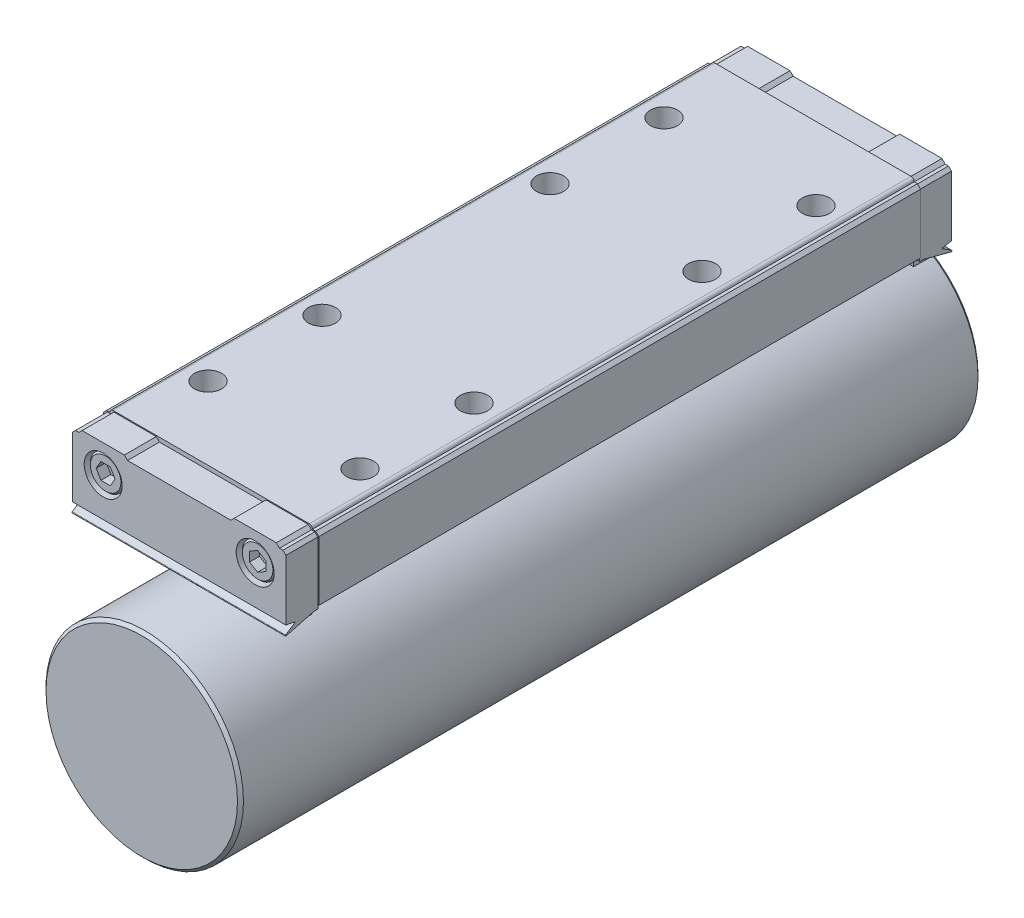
ISO-10303-21;
HEADER;
FILE_DESCRIPTION(('STEP AP214'),'2;1');
FILE_NAME('part.step','',(''),(''),'','','');
FILE_SCHEMA(('AUTOMOTIVE_DESIGN { 1 0 10303 214 1 1 1 1 }'));
ENDSEC;
DATA;
#1=APPLICATION_CONTEXT('core data for automotive mechanical design processes');
#2=APPLICATION_PROTOCOL_DEFINITION('international standard','automotive_design',2000,#1);
#3=PRODUCT_CONTEXT('',#1,'mechanical');
#4=PRODUCT('Part','Part','',(#3));
#5=PRODUCT_RELATED_PRODUCT_CATEGORY('part','',(#4));
#6=PRODUCT_DEFINITION_FORMATION('','',#4);
#7=PRODUCT_DEFINITION_CONTEXT('part definition',#1,'design');
#8=PRODUCT_DEFINITION('design','',#6,#7);
#9=PRODUCT_DEFINITION_SHAPE('','',#8);
#10=(LENGTH_UNIT() NAMED_UNIT(*) SI_UNIT(.MILLI.,.METRE.));
#11=(NAMED_UNIT(*) PLANE_ANGLE_UNIT() SI_UNIT($,.RADIAN.));
#12=(NAMED_UNIT(*) SI_UNIT($,.STERADIAN.) SOLID_ANGLE_UNIT());
#13=UNCERTAINTY_MEASURE_WITH_UNIT(LENGTH_MEASURE(1.E-05),#10,'distance_accuracy_value','');
#14=(GEOMETRIC_REPRESENTATION_CONTEXT(3) GLOBAL_UNCERTAINTY_ASSIGNED_CONTEXT((#13)) GLOBAL_UNIT_ASSIGNED_CONTEXT((#10,
#11,#12)) REPRESENTATION_CONTEXT('',''));
#15=CARTESIAN_POINT('',(0.,0.,0.));
#16=DIRECTION('',(0.,0.,1.));
#17=DIRECTION('',(1.,0.,0.));
#18=AXIS2_PLACEMENT_3D('',#15,#16,#17);
#19=CARTESIAN_POINT('',(-22.5963740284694,46.6907000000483,-80.32));
#20=DIRECTION('',(0.,0.,1.));
#21=DIRECTION('',(-1.,0.,0.));
#22=AXIS2_PLACEMENT_3D('',#19,#20,#21);
#23=PLANE('',#22);
#24=DIRECTION('',(1.,-1.02070574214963E-11,0.));
#25=VECTOR('',#24,1.);
#26=CARTESIAN_POINT('',(-20.2321246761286,46.6907000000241,-80.32));
#27=LINE('',#26,#25);
#28=CARTESIAN_POINT('',(-20.2321246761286,46.6907000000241,-80.32));
#29=VERTEX_POINT('',#28);
#30=CARTESIAN_POINT('',(-17.8678753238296,46.6907,-80.32));
#31=VERTEX_POINT('',#30);
#32=EDGE_CURVE('E681',#29,#31,#27,.T.);
#33=ORIENTED_EDGE('',*,*,#32,.T.);
#34=DIRECTION('',(0.499999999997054,-0.86602540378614,0.));
#35=VECTOR('',#34,1.);
#36=CARTESIAN_POINT('',(-17.8678753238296,46.6907,-80.32));
#37=LINE('',#36,#35);
#38=CARTESIAN_POINT('',(-16.6857506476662,44.6431999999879,-80.32));
#39=VERTEX_POINT('',#38);
#40=EDGE_CURVE('E684',#31,#39,#37,.T.);
#41=ORIENTED_EDGE('',*,*,#40,.T.);
#42=DIRECTION('',(-0.500000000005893,-0.866025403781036,0.));
#43=VECTOR('',#42,1.);
#44=CARTESIAN_POINT('',(-16.6857506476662,44.6431999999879,-80.32));
#45=LINE('',#44,#43);
#46=CARTESIAN_POINT('',(-17.8678753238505,42.5956999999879,-80.32));
#47=VERTEX_POINT('',#46);
#48=EDGE_CURVE('E651',#39,#47,#45,.T.);
#49=ORIENTED_EDGE('',*,*,#48,.T.);
#50=DIRECTION('',(-1.,1.02070574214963E-11,0.));
#51=VECTOR('',#50,1.);
#52=CARTESIAN_POINT('',(-17.8678753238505,42.5956999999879,-80.32));
#53=LINE('',#52,#51);
#54=CARTESIAN_POINT('',(-20.2321246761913,42.5957000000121,-80.32));
#55=VERTEX_POINT('',#54);
#56=EDGE_CURVE('E687',#47,#55,#53,.T.);
#57=ORIENTED_EDGE('',*,*,#56,.T.);
#58=DIRECTION('',(-0.499999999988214,0.866025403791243,0.));
#59=VECTOR('',#58,1.);
#60=CARTESIAN_POINT('',(-20.2321246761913,42.5957000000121,-80.32));
#61=LINE('',#60,#59);
#62=CARTESIAN_POINT('',(-21.4142493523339,44.6432000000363,-80.32));
#63=VERTEX_POINT('',#62);
#64=EDGE_CURVE('E690',#55,#63,#61,.T.);
#65=ORIENTED_EDGE('',*,*,#64,.T.);
#66=DIRECTION('',(0.500000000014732,0.866025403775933,0.));
#67=VECTOR('',#66,1.);
#68=CARTESIAN_POINT('',(-21.4142493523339,44.6432000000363,-80.32));
#69=LINE('',#68,#67);
#70=EDGE_CURVE('E693',#63,#29,#69,.T.);
#71=ORIENTED_EDGE('',*,*,#70,.T.);
#72=EDGE_LOOP('',(#33,#41,#49,#57,#65,#71));
#73=FACE_BOUND('',#72,.T.);
#74=ADVANCED_FACE('F14',(#73),#23,.F.);
#75=CARTESIAN_POINT('',(15.5036259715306,46.6907000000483,-80.32));
#76=DIRECTION('',(0.,0.,1.));
#77=DIRECTION('',(-1.,0.,0.));
#78=AXIS2_PLACEMENT_3D('',#75,#76,#77);
#79=PLANE('',#78);
#80=DIRECTION('',(1.,-1.02070574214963E-11,0.));
#81=VECTOR('',#80,1.);
#82=CARTESIAN_POINT('',(17.8678753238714,46.6907000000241,-80.32));
#83=LINE('',#82,#81);
#84=CARTESIAN_POINT('',(17.8678753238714,46.6907000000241,-80.32));
#85=VERTEX_POINT('',#84);
#86=CARTESIAN_POINT('',(20.2321246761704,46.6907,-80.32));
#87=VERTEX_POINT('',#86);
#88=EDGE_CURVE('E727',#85,#87,#83,.T.);
#89=ORIENTED_EDGE('',*,*,#88,.T.);
#90=DIRECTION('',(0.499999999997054,-0.86602540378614,0.));
#91=VECTOR('',#90,1.);
#92=CARTESIAN_POINT('',(20.2321246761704,46.6907,-80.32));
#93=LINE('',#92,#91);
#94=CARTESIAN_POINT('',(21.4142493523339,44.6431999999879,-80.32));
#95=VERTEX_POINT('',#94);
#96=EDGE_CURVE('E730',#87,#95,#93,.T.);
#97=ORIENTED_EDGE('',*,*,#96,.T.);
#98=DIRECTION('',(-0.500000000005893,-0.866025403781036,0.));
#99=VECTOR('',#98,1.);
#100=CARTESIAN_POINT('',(21.4142493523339,44.6431999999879,-80.32));
#101=LINE('',#100,#99);
#102=CARTESIAN_POINT('',(20.2321246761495,42.5956999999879,-80.32));
#103=VERTEX_POINT('',#102);
#104=EDGE_CURVE('E733',#95,#103,#101,.T.);
#105=ORIENTED_EDGE('',*,*,#104,.T.);
#106=DIRECTION('',(-1.,1.02070574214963E-11,0.));
#107=VECTOR('',#106,1.);
#108=CARTESIAN_POINT('',(20.2321246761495,42.5956999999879,-80.32));
#109=LINE('',#108,#107);
#110=CARTESIAN_POINT('',(17.8678753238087,42.5957000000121,-80.32));
#111=VERTEX_POINT('',#110);
#112=EDGE_CURVE('E736',#103,#111,#109,.T.);
#113=ORIENTED_EDGE('',*,*,#112,.T.);
#114=DIRECTION('',(-0.499999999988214,0.866025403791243,0.));
#115=VECTOR('',#114,1.);
#116=CARTESIAN_POINT('',(17.8678753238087,42.5957000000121,-80.32));
#117=LINE('',#116,#115);
#118=CARTESIAN_POINT('',(16.6857506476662,44.6432000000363,-80.32));
#119=VERTEX_POINT('',#118);
#120=EDGE_CURVE('E739',#111,#119,#117,.T.);
#121=ORIENTED_EDGE('',*,*,#120,.T.);
#122=DIRECTION('',(0.500000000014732,0.866025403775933,0.));
#123=VECTOR('',#122,1.);
#124=CARTESIAN_POINT('',(16.6857506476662,44.6432000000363,-80.32));
#125=LINE('',#124,#123);
#126=EDGE_CURVE('E742',#119,#85,#125,.T.);
#127=ORIENTED_EDGE('',*,*,#126,.T.);
#128=EDGE_LOOP('',(#89,#97,#105,#113,#121,#127));
#129=FACE_BOUND('',#128,.T.);
#130=ADVANCED_FACE('F3144',(#129),#79,.F.);
#131=CARTESIAN_POINT('',(-17.8678753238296,46.6907,-80.32));
#132=DIRECTION('',(0.86602540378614,0.499999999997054,0.));
#133=DIRECTION('',(0.499999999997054,-0.86602540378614,0.));
#134=AXIS2_PLACEMENT_3D('',#131,#132,#133);
#135=PLANE('',#134);
#136=DIRECTION('',(0.499999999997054,-0.86602540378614,0.));
#137=VECTOR('',#136,1.);
#138=CARTESIAN_POINT('',(-17.8678753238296,46.6907,-82.82));
#139=LINE('',#138,#137);
#140=CARTESIAN_POINT('',(-17.8678753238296,46.6907,-82.82));
#141=VERTEX_POINT('',#140);
#142=CARTESIAN_POINT('',(-16.6857506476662,44.6431999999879,-82.82));
#143=VERTEX_POINT('',#142);
#144=EDGE_CURVE('E660',#141,#143,#139,.T.);
#145=ORIENTED_EDGE('',*,*,#144,.T.);
#146=DIRECTION('',(0.,0.,-1.));
#147=VECTOR('',#146,1.);
#148=CARTESIAN_POINT('',(-16.6857506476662,44.6431999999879,-80.32));
#149=LINE('',#148,#147);
#150=EDGE_CURVE('E644',#39,#143,#149,.T.);
#151=ORIENTED_EDGE('',*,*,#150,.F.);
#152=ORIENTED_EDGE('',*,*,#40,.F.);
#153=DIRECTION('',(0.,0.,-1.));
#154=VECTOR('',#153,1.);
#155=CARTESIAN_POINT('',(-17.8678753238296,46.6907,-80.32));
#156=LINE('',#155,#154);
#157=EDGE_CURVE('E656',#31,#141,#156,.T.);
#158=ORIENTED_EDGE('',*,*,#157,.T.);
#159=EDGE_LOOP('',(#145,#151,#152,#158));
#160=FACE_BOUND('',#159,.T.);
#161=ADVANCED_FACE('F661',(#160),#135,.F.);
#162=CARTESIAN_POINT('',(-16.6857506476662,44.6431999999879,-80.32));
#163=DIRECTION('',(0.866025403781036,-0.500000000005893,0.));
#164=DIRECTION('',(-0.500000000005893,-0.866025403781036,0.));
#165=AXIS2_PLACEMENT_3D('',#162,#163,#164);
#166=PLANE('',#165);
#167=DIRECTION('',(-0.500000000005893,-0.866025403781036,0.));
#168=VECTOR('',#167,1.);
#169=CARTESIAN_POINT('',(-16.6857506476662,44.6431999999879,-82.82));
#170=LINE('',#169,#168);
#171=CARTESIAN_POINT('',(-17.8678753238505,42.5956999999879,-82.82));
#172=VERTEX_POINT('',#171);
#173=EDGE_CURVE('E648',#143,#172,#170,.T.);
#174=ORIENTED_EDGE('',*,*,#173,.T.);
#175=DIRECTION('',(0.,0.,-1.));
#176=VECTOR('',#175,1.);
#177=CARTESIAN_POINT('',(-17.8678753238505,42.5956999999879,-80.32));
#178=LINE('',#177,#176);
#179=EDGE_CURVE('E655',#47,#172,#178,.T.);
#180=ORIENTED_EDGE('',*,*,#179,.F.);
#181=ORIENTED_EDGE('',*,*,#48,.F.);
#182=ORIENTED_EDGE('',*,*,#150,.T.);
#183=EDGE_LOOP('',(#174,#180,#181,#182));
#184=FACE_BOUND('',#183,.T.);
#185=ADVANCED_FACE('F646',(#184),#166,.F.);
#186=CARTESIAN_POINT('',(-17.8678753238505,42.5956999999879,-80.32));
#187=DIRECTION('',(-1.02070574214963E-11,-1.,0.));
#188=DIRECTION('',(-1.,1.02070574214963E-11,0.));
#189=AXIS2_PLACEMENT_3D('',#186,#187,#188);
#190=PLANE('',#189);
#191=DIRECTION('',(-1.,1.02070574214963E-11,0.));
#192=VECTOR('',#191,1.);
#193=CARTESIAN_POINT('',(-17.8678753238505,42.5956999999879,-82.82));
#194=LINE('',#193,#192);
#195=CARTESIAN_POINT('',(-20.2321246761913,42.5957000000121,-82.82));
#196=VERTEX_POINT('',#195);
#197=EDGE_CURVE('E670',#172,#196,#194,.T.);
#198=ORIENTED_EDGE('',*,*,#197,.T.);
#199=DIRECTION('',(0.,0.,-1.));
#200=VECTOR('',#199,1.);
#201=CARTESIAN_POINT('',(-20.2321246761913,42.5957000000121,-80.32));
#202=LINE('',#201,#200);
#203=EDGE_CURVE('E701',#55,#196,#202,.T.);
#204=ORIENTED_EDGE('',*,*,#203,.F.);
#205=ORIENTED_EDGE('',*,*,#56,.F.);
#206=ORIENTED_EDGE('',*,*,#179,.T.);
#207=EDGE_LOOP('',(#198,#204,#205,#206));
#208=FACE_BOUND('',#207,.T.);
#209=ADVANCED_FACE('F3283',(#208),#190,.F.);
#210=CARTESIAN_POINT('',(-20.2321246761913,42.5957000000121,-80.32));
#211=DIRECTION('',(-0.866025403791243,-0.499999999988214,0.));
#212=DIRECTION('',(-0.499999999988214,0.866025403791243,0.));
#213=AXIS2_PLACEMENT_3D('',#210,#211,#212);
#214=PLANE('',#213);
#215=DIRECTION('',(-0.499999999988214,0.866025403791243,0.));
#216=VECTOR('',#215,1.);
#217=CARTESIAN_POINT('',(-20.2321246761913,42.5957000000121,-82.82));
#218=LINE('',#217,#216);
#219=CARTESIAN_POINT('',(-21.4142493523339,44.6432000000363,-82.82));
#220=VERTEX_POINT('',#219);
#221=EDGE_CURVE('E672',#196,#220,#218,.T.);
#222=ORIENTED_EDGE('',*,*,#221,.T.);
#223=DIRECTION('',(0.,0.,-1.));
#224=VECTOR('',#223,1.);
#225=CARTESIAN_POINT('',(-21.4142493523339,44.6432000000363,-80.32));
#226=LINE('',#225,#224);
#227=EDGE_CURVE('E699',#63,#220,#226,.T.);
#228=ORIENTED_EDGE('',*,*,#227,.F.);
#229=ORIENTED_EDGE('',*,*,#64,.F.);
#230=ORIENTED_EDGE('',*,*,#203,.T.);
#231=EDGE_LOOP('',(#222,#228,#229,#230));
#232=FACE_BOUND('',#231,.T.);
#233=ADVANCED_FACE('F3272',(#232),#214,.F.);
#234=CARTESIAN_POINT('',(-21.4142493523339,44.6432000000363,-80.32));
#235=DIRECTION('',(-0.866025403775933,0.500000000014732,0.));
#236=DIRECTION('',(0.500000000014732,0.866025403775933,0.));
#237=AXIS2_PLACEMENT_3D('',#234,#235,#236);
#238=PLANE('',#237);
#239=DIRECTION('',(0.500000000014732,0.866025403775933,0.));
#240=VECTOR('',#239,1.);
#241=CARTESIAN_POINT('',(-21.4142493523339,44.6432000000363,-82.82));
#242=LINE('',#241,#240);
#243=CARTESIAN_POINT('',(-20.2321246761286,46.6907000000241,-82.82));
#244=VERTEX_POINT('',#243);
#245=EDGE_CURVE('E678',#220,#244,#242,.T.);
#246=ORIENTED_EDGE('',*,*,#245,.T.);
#247=DIRECTION('',(0.,0.,-1.));
#248=VECTOR('',#247,1.);
#249=CARTESIAN_POINT('',(-20.2321246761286,46.6907000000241,-80.32));
#250=LINE('',#249,#248);
#251=EDGE_CURVE('E696',#29,#244,#250,.T.);
#252=ORIENTED_EDGE('',*,*,#251,.F.);
#253=ORIENTED_EDGE('',*,*,#70,.F.);
#254=ORIENTED_EDGE('',*,*,#227,.T.);
#255=EDGE_LOOP('',(#246,#252,#253,#254));
#256=FACE_BOUND('',#255,.T.);
#257=ADVANCED_FACE('F3261',(#256),#238,.F.);
#258=CARTESIAN_POINT('',(-20.2321246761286,46.6907000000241,-80.32));
#259=DIRECTION('',(1.02070574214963E-11,1.,0.));
#260=DIRECTION('',(1.,-1.02070574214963E-11,0.));
#261=AXIS2_PLACEMENT_3D('',#258,#259,#260);
#262=PLANE('',#261);
#263=DIRECTION('',(1.,-1.02070574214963E-11,0.));
#264=VECTOR('',#263,1.);
#265=CARTESIAN_POINT('',(-20.2321246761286,46.6907000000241,-82.82));
#266=LINE('',#265,#264);
#267=EDGE_CURVE('E664',#244,#141,#266,.T.);
#268=ORIENTED_EDGE('',*,*,#267,.T.);
#269=ORIENTED_EDGE('',*,*,#157,.F.);
#270=ORIENTED_EDGE('',*,*,#32,.F.);
#271=ORIENTED_EDGE('',*,*,#251,.T.);
#272=EDGE_LOOP('',(#268,#269,#270,#271));
#273=FACE_BOUND('',#272,.T.);
#274=ADVANCED_FACE('F3187',(#273),#262,.F.);
#275=CARTESIAN_POINT('',(20.2321246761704,46.6907,-80.32));
#276=DIRECTION('',(0.86602540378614,0.499999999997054,0.));
#277=DIRECTION('',(0.499999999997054,-0.86602540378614,0.));
#278=AXIS2_PLACEMENT_3D('',#275,#276,#277);
#279=PLANE('',#278);
#280=DIRECTION('',(0.499999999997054,-0.86602540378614,0.));
#281=VECTOR('',#280,1.);
#282=CARTESIAN_POINT('',(20.2321246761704,46.6907,-82.82));
#283=LINE('',#282,#281);
#284=CARTESIAN_POINT('',(20.2321246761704,46.6907,-82.82));
#285=VERTEX_POINT('',#284);
#286=CARTESIAN_POINT('',(21.4142493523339,44.6431999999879,-82.82));
#287=VERTEX_POINT('',#286);
#288=EDGE_CURVE('E712',#285,#287,#283,.T.);
#289=ORIENTED_EDGE('',*,*,#288,.T.);
#290=DIRECTION('',(0.,0.,-1.));
#291=VECTOR('',#290,1.);
#292=CARTESIAN_POINT('',(21.4142493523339,44.6431999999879,-80.32));
#293=LINE('',#292,#291);
#294=EDGE_CURVE('E755',#95,#287,#293,.T.);
#295=ORIENTED_EDGE('',*,*,#294,.F.);
#296=ORIENTED_EDGE('',*,*,#96,.F.);
#297=DIRECTION('',(0.,0.,-1.));
#298=VECTOR('',#297,1.);
#299=CARTESIAN_POINT('',(20.2321246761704,46.6907,-80.32));
#300=LINE('',#299,#298);
#301=EDGE_CURVE('E745',#87,#285,#300,.T.);
#302=ORIENTED_EDGE('',*,*,#301,.T.);
#303=EDGE_LOOP('',(#289,#295,#296,#302));
#304=FACE_BOUND('',#303,.T.);
#305=ADVANCED_FACE('F3240',(#304),#279,.F.);
#306=CARTESIAN_POINT('',(21.4142493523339,44.6431999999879,-80.32));
#307=DIRECTION('',(0.866025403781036,-0.500000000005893,0.));
#308=DIRECTION('',(-0.500000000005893,-0.866025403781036,0.));
#309=AXIS2_PLACEMENT_3D('',#306,#307,#308);
#310=PLANE('',#309);
#311=DIRECTION('',(-0.500000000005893,-0.866025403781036,0.));
#312=VECTOR('',#311,1.);
#313=CARTESIAN_POINT('',(21.4142493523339,44.6431999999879,-82.82));
#314=LINE('',#313,#312);
#315=CARTESIAN_POINT('',(20.2321246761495,42.5956999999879,-82.82));
#316=VERTEX_POINT('',#315);
#317=EDGE_CURVE('E715',#287,#316,#314,.T.);
#318=ORIENTED_EDGE('',*,*,#317,.T.);
#319=DIRECTION('',(0.,0.,-1.));
#320=VECTOR('',#319,1.);
#321=CARTESIAN_POINT('',(20.2321246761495,42.5956999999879,-80.32));
#322=LINE('',#321,#320);
#323=EDGE_CURVE('E753',#103,#316,#322,.T.);
#324=ORIENTED_EDGE('',*,*,#323,.F.);
#325=ORIENTED_EDGE('',*,*,#104,.F.);
#326=ORIENTED_EDGE('',*,*,#294,.T.);
#327=EDGE_LOOP('',(#318,#324,#325,#326));
#328=FACE_BOUND('',#327,.T.);
#329=ADVANCED_FACE('F3229',(#328),#310,.F.);
#330=CARTESIAN_POINT('',(20.2321246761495,42.5956999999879,-80.32));
#331=DIRECTION('',(-1.02070574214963E-11,-1.,0.));
#332=DIRECTION('',(-1.,1.02070574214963E-11,0.));
#333=AXIS2_PLACEMENT_3D('',#330,#331,#332);
#334=PLANE('',#333);
#335=DIRECTION('',(-1.,1.02070574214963E-11,0.));
#336=VECTOR('',#335,1.);
#337=CARTESIAN_POINT('',(20.2321246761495,42.5956999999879,-82.82));
#338=LINE('',#337,#336);
#339=CARTESIAN_POINT('',(17.8678753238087,42.5957000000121,-82.82));
#340=VERTEX_POINT('',#339);
#341=EDGE_CURVE('E718',#316,#340,#338,.T.);
#342=ORIENTED_EDGE('',*,*,#341,.T.);
#343=DIRECTION('',(0.,0.,-1.));
#344=VECTOR('',#343,1.);
#345=CARTESIAN_POINT('',(17.8678753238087,42.5957000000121,-80.32));
#346=LINE('',#345,#344);
#347=EDGE_CURVE('E751',#111,#340,#346,.T.);
#348=ORIENTED_EDGE('',*,*,#347,.F.);
#349=ORIENTED_EDGE('',*,*,#112,.F.);
#350=ORIENTED_EDGE('',*,*,#323,.T.);
#351=EDGE_LOOP('',(#342,#348,#349,#350));
#352=FACE_BOUND('',#351,.T.);
#353=ADVANCED_FACE('F3218',(#352),#334,.F.);
#354=CARTESIAN_POINT('',(17.8678753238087,42.5957000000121,-80.32));
#355=DIRECTION('',(-0.866025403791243,-0.499999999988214,0.));
#356=DIRECTION('',(-0.499999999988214,0.866025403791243,0.));
#357=AXIS2_PLACEMENT_3D('',#354,#355,#356);
#358=PLANE('',#357);
#359=DIRECTION('',(-0.499999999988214,0.866025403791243,0.));
#360=VECTOR('',#359,1.);
#361=CARTESIAN_POINT('',(17.8678753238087,42.5957000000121,-82.82));
#362=LINE('',#361,#360);
#363=CARTESIAN_POINT('',(16.6857506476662,44.6432000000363,-82.82));
#364=VERTEX_POINT('',#363);
#365=EDGE_CURVE('E721',#340,#364,#362,.T.);
#366=ORIENTED_EDGE('',*,*,#365,.T.);
#367=DIRECTION('',(0.,0.,-1.));
#368=VECTOR('',#367,1.);
#369=CARTESIAN_POINT('',(16.6857506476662,44.6432000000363,-80.32));
#370=LINE('',#369,#368);
#371=EDGE_CURVE('E749',#119,#364,#370,.T.);
#372=ORIENTED_EDGE('',*,*,#371,.F.);
#373=ORIENTED_EDGE('',*,*,#120,.F.);
#374=ORIENTED_EDGE('',*,*,#347,.T.);
#375=EDGE_LOOP('',(#366,#372,#373,#374));
#376=FACE_BOUND('',#375,.T.);
#377=ADVANCED_FACE('F3207',(#376),#358,.F.);
#378=CARTESIAN_POINT('',(16.6857506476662,44.6432000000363,-80.32));
#379=DIRECTION('',(-0.866025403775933,0.500000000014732,0.));
#380=DIRECTION('',(0.500000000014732,0.866025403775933,0.));
#381=AXIS2_PLACEMENT_3D('',#378,#379,#380);
#382=PLANE('',#381);
#383=DIRECTION('',(0.500000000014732,0.866025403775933,0.));
#384=VECTOR('',#383,1.);
#385=CARTESIAN_POINT('',(16.6857506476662,44.6432000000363,-82.82));
#386=LINE('',#385,#384);
#387=CARTESIAN_POINT('',(17.8678753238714,46.6907000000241,-82.82));
#388=VERTEX_POINT('',#387);
#389=EDGE_CURVE('E724',#364,#388,#386,.T.);
#390=ORIENTED_EDGE('',*,*,#389,.T.);
#391=DIRECTION('',(0.,0.,-1.));
#392=VECTOR('',#391,1.);
#393=CARTESIAN_POINT('',(17.8678753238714,46.6907000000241,-80.32));
#394=LINE('',#393,#392);
#395=EDGE_CURVE('E746',#85,#388,#394,.T.);
#396=ORIENTED_EDGE('',*,*,#395,.F.);
#397=ORIENTED_EDGE('',*,*,#126,.F.);
#398=ORIENTED_EDGE('',*,*,#371,.T.);
#399=EDGE_LOOP('',(#390,#396,#397,#398));
#400=FACE_BOUND('',#399,.T.);
#401=ADVANCED_FACE('F3196',(#400),#382,.F.);
#402=CARTESIAN_POINT('',(17.8678753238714,46.6907000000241,-80.32));
#403=DIRECTION('',(1.02070574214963E-11,1.,0.));
#404=DIRECTION('',(1.,-1.02070574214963E-11,0.));
#405=AXIS2_PLACEMENT_3D('',#402,#403,#404);
#406=PLANE('',#405);
#407=DIRECTION('',(1.,-1.02070574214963E-11,0.));
#408=VECTOR('',#407,1.);
#409=CARTESIAN_POINT('',(17.8678753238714,46.6907000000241,-82.82));
#410=LINE('',#409,#408);
#411=EDGE_CURVE('E710',#388,#285,#410,.T.);
#412=ORIENTED_EDGE('',*,*,#411,.T.);
#413=ORIENTED_EDGE('',*,*,#301,.F.);
#414=ORIENTED_EDGE('',*,*,#88,.F.);
#415=ORIENTED_EDGE('',*,*,#395,.T.);
#416=EDGE_LOOP('',(#412,#413,#414,#415));
#417=FACE_BOUND('',#416,.T.);
#418=ADVANCED_FACE('F3177',(#417),#406,.F.);
#419=CARTESIAN_POINT('',(-19.05,40.8182,-82.82));
#420=DIRECTION('',(0.,0.,-1.));
#421=DIRECTION('',(1.,0.,0.));
#422=AXIS2_PLACEMENT_3D('',#419,#420,#421);
#423=PLANE('',#422);
#424=ORIENTED_EDGE('',*,*,#267,.F.);
#425=ORIENTED_EDGE('',*,*,#245,.F.);
#426=ORIENTED_EDGE('',*,*,#221,.F.);
#427=ORIENTED_EDGE('',*,*,#197,.F.);
#428=ORIENTED_EDGE('',*,*,#173,.F.);
#429=ORIENTED_EDGE('',*,*,#144,.F.);
#430=EDGE_LOOP('',(#424,#425,#426,#427,#428,#429));
#431=FACE_BOUND('',#430,.T.);
#432=CARTESIAN_POINT('',(-19.05,44.6432,-82.82));
#433=DIRECTION('',(0.,0.,1.));
#434=DIRECTION('',(-1.,0.,0.));
#435=AXIS2_PLACEMENT_3D('',#432,#433,#434);
#436=CIRCLE('',#435,3.825);
#437=CARTESIAN_POINT('',(-22.875,44.6432,-82.82));
#438=VERTEX_POINT('',#437);
#439=EDGE_CURVE('E698',#438,#438,#436,.T.);
#440=ORIENTED_EDGE('',*,*,#439,.F.);
#441=EDGE_LOOP('',(#440));
#442=FACE_BOUND('',#441,.T.);
#443=ADVANCED_FACE('F666',(#431,#442),#423,.T.);
#444=CARTESIAN_POINT('',(19.05,40.8182,-82.82));
#445=DIRECTION('',(0.,0.,-1.));
#446=DIRECTION('',(1.,0.,0.));
#447=AXIS2_PLACEMENT_3D('',#444,#445,#446);
#448=PLANE('',#447);
#449=ORIENTED_EDGE('',*,*,#411,.F.);
#450=ORIENTED_EDGE('',*,*,#389,.F.);
#451=ORIENTED_EDGE('',*,*,#365,.F.);
#452=ORIENTED_EDGE('',*,*,#341,.F.);
#453=ORIENTED_EDGE('',*,*,#317,.F.);
#454=ORIENTED_EDGE('',*,*,#288,.F.);
#455=EDGE_LOOP('',(#449,#450,#451,#452,#453,#454));
#456=FACE_BOUND('',#455,.T.);
#457=CARTESIAN_POINT('',(19.05,44.6432,-82.82));
#458=DIRECTION('',(0.,0.,1.));
#459=DIRECTION('',(-1.,0.,0.));
#460=AXIS2_PLACEMENT_3D('',#457,#458,#459);
#461=CIRCLE('',#460,3.825);
#462=CARTESIAN_POINT('',(15.225,44.6432,-82.82));
#463=VERTEX_POINT('',#462);
#464=EDGE_CURVE('E748',#463,#463,#461,.T.);
#465=ORIENTED_EDGE('',*,*,#464,.F.);
#466=EDGE_LOOP('',(#465));
#467=FACE_BOUND('',#466,.T.);
#468=ADVANCED_FACE('F3156',(#456,#467),#448,.T.);
#469=CARTESIAN_POINT('',(-19.05,44.6432,-82.395));
#470=DIRECTION('',(0.,0.,1.));
#471=DIRECTION('',(-1.,0.,0.));
#472=AXIS2_PLACEMENT_3D('',#469,#470,#471);
#473=CONICAL_SURFACE('',#472,4.25,0.785398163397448);
#474=ORIENTED_EDGE('',*,*,#439,.T.);
#475=EDGE_LOOP('',(#474));
#476=FACE_BOUND('',#475,.T.);
#477=CARTESIAN_POINT('',(-19.05,44.6432,-82.395));
#478=DIRECTION('',(0.,0.,1.));
#479=DIRECTION('',(-1.,0.,0.));
#480=AXIS2_PLACEMENT_3D('',#477,#478,#479);
#481=CIRCLE('',#480,4.25);
#482=CARTESIAN_POINT('',(-23.3,44.6432,-82.395));
#483=VERTEX_POINT('',#482);
#484=EDGE_CURVE('E707',#483,#483,#481,.T.);
#485=ORIENTED_EDGE('',*,*,#484,.F.);
#486=EDGE_LOOP('',(#485));
#487=FACE_BOUND('',#486,.T.);
#488=ADVANCED_FACE('F3145',(#476,#487),#473,.T.);
#489=CARTESIAN_POINT('',(19.05,44.6432,-82.395));
#490=DIRECTION('',(0.,0.,1.));
#491=DIRECTION('',(-1.,0.,0.));
#492=AXIS2_PLACEMENT_3D('',#489,#490,#491);
#493=CONICAL_SURFACE('',#492,4.25,0.785398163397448);
#494=ORIENTED_EDGE('',*,*,#464,.T.);
#495=EDGE_LOOP('',(#494));
#496=FACE_BOUND('',#495,.T.);
#497=CARTESIAN_POINT('',(19.05,44.6432,-82.395));
#498=DIRECTION('',(0.,0.,1.));
#499=DIRECTION('',(-1.,0.,0.));
#500=AXIS2_PLACEMENT_3D('',#497,#498,#499);
#501=CIRCLE('',#500,4.25);
#502=CARTESIAN_POINT('',(14.8,44.6432,-82.395));
#503=VERTEX_POINT('',#502);
#504=EDGE_CURVE('E761',#503,#503,#501,.T.);
#505=ORIENTED_EDGE('',*,*,#504,.F.);
#506=EDGE_LOOP('',(#505));
#507=FACE_BOUND('',#506,.T.);
#508=ADVANCED_FACE('F3133',(#496,#507),#493,.T.);
#509=CARTESIAN_POINT('',(-19.05,44.6432,-77.82));
#510=DIRECTION('',(0.,0.,1.));
#511=DIRECTION('',(-1.,0.,0.));
#512=AXIS2_PLACEMENT_3D('',#509,#510,#511);
#513=CYLINDRICAL_SURFACE('',#512,4.25);
#514=ORIENTED_EDGE('',*,*,#484,.T.);
#515=EDGE_LOOP('',(#514));
#516=FACE_BOUND('',#515,.T.);
#517=CARTESIAN_POINT('',(-19.05,44.6432,-77.82));
#518=DIRECTION('',(0.,0.,1.));
#519=DIRECTION('',(1.,0.,0.));
#520=AXIS2_PLACEMENT_3D('',#517,#518,#519);
#521=CIRCLE('',#520,4.25);
#522=CARTESIAN_POINT('',(-14.8,44.6432,-77.82));
#523=VERTEX_POINT('',#522);
#524=EDGE_CURVE('E1248',#523,#523,#521,.T.);
#525=ORIENTED_EDGE('',*,*,#524,.F.);
#526=EDGE_LOOP('',(#525));
#527=FACE_BOUND('',#526,.T.);
#528=ADVANCED_FACE('F3130',(#516,#527),#513,.T.);
#529=CARTESIAN_POINT('',(19.05,44.6432,-77.82));
#530=DIRECTION('',(0.,0.,1.));
#531=DIRECTION('',(-1.,0.,0.));
#532=AXIS2_PLACEMENT_3D('',#529,#530,#531);
#533=CYLINDRICAL_SURFACE('',#532,4.25);
#534=ORIENTED_EDGE('',*,*,#504,.T.);
#535=EDGE_LOOP('',(#534));
#536=FACE_BOUND('',#535,.T.);
#537=CARTESIAN_POINT('',(19.05,44.6432,-77.82));
#538=DIRECTION('',(0.,0.,1.));
#539=DIRECTION('',(1.,0.,0.));
#540=AXIS2_PLACEMENT_3D('',#537,#538,#539);
#541=CIRCLE('',#540,4.25);
#542=CARTESIAN_POINT('',(23.3,44.6432,-77.82));
#543=VERTEX_POINT('',#542);
#544=EDGE_CURVE('E1251',#543,#543,#541,.T.);
#545=ORIENTED_EDGE('',*,*,#544,.F.);
#546=EDGE_LOOP('',(#545));
#547=FACE_BOUND('',#546,.T.);
#548=ADVANCED_FACE('F1900',(#536,#547),#533,.T.);
#549=CARTESIAN_POINT('',(-21.665,44.6432,-77.82));
#550=DIRECTION('',(0.,0.,1.));
#551=DIRECTION('',(1.,0.,0.));
#552=AXIS2_PLACEMENT_3D('',#549,#550,#551);
#553=PLANE('',#552);
#554=ORIENTED_EDGE('',*,*,#524,.T.);
#555=EDGE_LOOP('',(#554));
#556=FACE_BOUND('',#555,.T.);
#557=CARTESIAN_POINT('',(-19.05,44.6432,-77.82));
#558=DIRECTION('',(0.,0.,-1.));
#559=DIRECTION('',(-1.,0.,0.));
#560=AXIS2_PLACEMENT_3D('',#557,#558,#559);
#561=CIRCLE('',#560,4.765);
#562=CARTESIAN_POINT('',(-23.815,44.6432,-77.82));
#563=VERTEX_POINT('',#562);
#564=EDGE_CURVE('E1403',#563,#563,#561,.T.);
#565=ORIENTED_EDGE('',*,*,#564,.T.);
#566=EDGE_LOOP('',(#565));
#567=FACE_BOUND('',#566,.T.);
#568=ADVANCED_FACE('F1907',(#556,#567),#553,.F.);
#569=CARTESIAN_POINT('',(16.435,44.6432,-77.82));
#570=DIRECTION('',(0.,0.,1.));
#571=DIRECTION('',(1.,0.,0.));
#572=AXIS2_PLACEMENT_3D('',#569,#570,#571);
#573=PLANE('',#572);
#574=ORIENTED_EDGE('',*,*,#544,.T.);
#575=EDGE_LOOP('',(#574));
#576=FACE_BOUND('',#575,.T.);
#577=CARTESIAN_POINT('',(19.05,44.6432,-77.82));
#578=DIRECTION('',(0.,0.,-1.));
#579=DIRECTION('',(-1.,0.,0.));
#580=AXIS2_PLACEMENT_3D('',#577,#578,#579);
#581=CIRCLE('',#580,4.765);
#582=CARTESIAN_POINT('',(14.285,44.6432,-77.82));
#583=VERTEX_POINT('',#582);
#584=EDGE_CURVE('E1393',#583,#583,#581,.T.);
#585=ORIENTED_EDGE('',*,*,#584,.T.);
#586=EDGE_LOOP('',(#585));
#587=FACE_BOUND('',#586,.T.);
#588=ADVANCED_FACE('F1903',(#576,#587),#573,.F.);
#589=CARTESIAN_POINT('',(-19.05,44.6432,-83.42));
#590=DIRECTION('',(0.,0.,-1.));
#591=DIRECTION('',(-1.,0.,0.));
#592=AXIS2_PLACEMENT_3D('',#589,#590,#591);
#593=CYLINDRICAL_SURFACE('',#592,4.765);
#594=ORIENTED_EDGE('',*,*,#564,.F.);
#595=EDGE_LOOP('',(#594));
#596=FACE_BOUND('',#595,.T.);
#597=CARTESIAN_POINT('',(-19.05,44.6432,-83.42));
#598=DIRECTION('',(0.,0.,-1.));
#599=DIRECTION('',(-1.,0.,0.));
#600=AXIS2_PLACEMENT_3D('',#597,#598,#599);
#601=CIRCLE('',#600,4.765);
#602=CARTESIAN_POINT('',(-23.815,44.6432,-83.42));
#603=VERTEX_POINT('',#602);
#604=EDGE_CURVE('E1408',#603,#603,#601,.T.);
#605=ORIENTED_EDGE('',*,*,#604,.T.);
#606=EDGE_LOOP('',(#605));
#607=FACE_BOUND('',#606,.T.);
#608=ADVANCED_FACE('F1906',(#596,#607),#593,.F.);
#609=CARTESIAN_POINT('',(19.05,44.6432,-83.42));
#610=DIRECTION('',(0.,0.,-1.));
#611=DIRECTION('',(-1.,0.,0.));
#612=AXIS2_PLACEMENT_3D('',#609,#610,#611);
#613=CYLINDRICAL_SURFACE('',#612,4.765);
#614=ORIENTED_EDGE('',*,*,#584,.F.);
#615=EDGE_LOOP('',(#614));
#616=FACE_BOUND('',#615,.T.);
#617=CARTESIAN_POINT('',(19.05,44.6432,-83.42));
#618=DIRECTION('',(0.,0.,-1.));
#619=DIRECTION('',(-1.,0.,0.));
#620=AXIS2_PLACEMENT_3D('',#617,#618,#619);
#621=CIRCLE('',#620,4.765);
#622=CARTESIAN_POINT('',(14.285,44.6432,-83.42));
#623=VERTEX_POINT('',#622);
#624=EDGE_CURVE('E1399',#623,#623,#621,.T.);
#625=ORIENTED_EDGE('',*,*,#624,.T.);
#626=EDGE_LOOP('',(#625));
#627=FACE_BOUND('',#626,.T.);
#628=ADVANCED_FACE('F1909',(#616,#627),#613,.F.);
#629=CARTESIAN_POINT('',(-26.75,34.43,-76.42));
#630=DIRECTION('',(0.,0.966628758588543,-0.256181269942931));
#631=DIRECTION('',(0.,-0.256181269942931,-0.966628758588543));
#632=AXIS2_PLACEMENT_3D('',#629,#630,#631);
#633=PLANE('',#632);
#634=DIRECTION('',(0.,-0.256181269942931,-0.966628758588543));
#635=VECTOR('',#634,1.);
#636=CARTESIAN_POINT('',(25.25,32.5850056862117,-83.3815728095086));
#637=LINE('',#636,#635);
#638=CARTESIAN_POINT('',(25.25,34.43,-76.42));
#639=VERTEX_POINT('',#638);
#640=CARTESIAN_POINT('',(25.25,32.5850056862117,-83.3815728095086));
#641=VERTEX_POINT('',#640);
#642=EDGE_CURVE('E1672',#639,#641,#637,.T.);
#643=ORIENTED_EDGE('',*,*,#642,.T.);
#644=DIRECTION('',(1.,0.,0.));
#645=VECTOR('',#644,1.);
#646=CARTESIAN_POINT('',(-26.75,32.5850056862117,-83.3815728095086));
#647=LINE('',#646,#645);
#648=CARTESIAN_POINT('',(26.75,32.5850056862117,-83.3815728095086));
#649=VERTEX_POINT('',#648);
#650=EDGE_CURVE('E1269',#641,#649,#647,.T.);
#651=ORIENTED_EDGE('',*,*,#650,.T.);
#652=DIRECTION('',(0.,0.256181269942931,0.966628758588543));
#653=VECTOR('',#652,1.);
#654=CARTESIAN_POINT('',(26.75,34.43,-76.42));
#655=LINE('',#654,#653);
#656=CARTESIAN_POINT('',(26.75,34.43,-76.42));
#657=VERTEX_POINT('',#656);
#658=EDGE_CURVE('E1361',#649,#657,#655,.T.);
#659=ORIENTED_EDGE('',*,*,#658,.T.);
#660=DIRECTION('',(1.,0.,0.));
#661=VECTOR('',#660,1.);
#662=CARTESIAN_POINT('',(-26.75,34.43,-76.42));
#663=LINE('',#662,#661);
#664=EDGE_CURVE('E1270',#639,#657,#663,.T.);
#665=ORIENTED_EDGE('',*,*,#664,.F.);
#666=EDGE_LOOP('',(#643,#651,#659,#665));
#667=FACE_BOUND('',#666,.T.);
#668=ADVANCED_FACE('F1713',(#667),#633,.F.);
#669=CARTESIAN_POINT('',(26.,50.8432,-83.42));
#670=DIRECTION('',(-0.707106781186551,-0.707106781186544,0.));
#671=DIRECTION('',(-0.707106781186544,0.707106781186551,0.));
#672=AXIS2_PLACEMENT_3D('',#669,#670,#671);
#673=PLANE('',#672);
#674=DIRECTION('',(0.707106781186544,-0.707106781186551,0.));
#675=VECTOR('',#674,1.);
#676=CARTESIAN_POINT('',(26.,50.8432,-75.42));
#677=LINE('',#676,#675);
#678=CARTESIAN_POINT('',(26.75,50.0932,-75.42));
#679=VERTEX_POINT('',#678);
#680=CARTESIAN_POINT('',(26.,50.8432,-75.42));
#681=VERTEX_POINT('',#680);
#682=EDGE_CURVE('E24',#679,#681,#677,.F.);
#683=ORIENTED_EDGE('',*,*,#682,.F.);
#684=DIRECTION('',(0.,0.,1.));
#685=VECTOR('',#684,1.);
#686=CARTESIAN_POINT('',(26.75,50.0932,-83.42));
#687=LINE('',#686,#685);
#688=CARTESIAN_POINT('',(26.75,50.0932,-83.42));
#689=VERTEX_POINT('',#688);
#690=EDGE_CURVE('E1301',#689,#679,#687,.T.);
#691=ORIENTED_EDGE('',*,*,#690,.F.);
#692=DIRECTION('',(-0.707106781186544,0.707106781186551,0.));
#693=VECTOR('',#692,1.);
#694=CARTESIAN_POINT('',(26.,50.8432,-83.42));
#695=LINE('',#694,#693);
#696=CARTESIAN_POINT('',(26.,50.8432,-83.42));
#697=VERTEX_POINT('',#696);
#698=EDGE_CURVE('E1299',#697,#689,#695,.F.);
#699=ORIENTED_EDGE('',*,*,#698,.F.);
#700=DIRECTION('',(0.,0.,-1.));
#701=VECTOR('',#700,1.);
#702=CARTESIAN_POINT('',(26.,50.8432,-83.42));
#703=LINE('',#702,#701);
#704=EDGE_CURVE('E1294',#681,#697,#703,.T.);
#705=ORIENTED_EDGE('',*,*,#704,.F.);
#706=EDGE_LOOP('',(#683,#691,#699,#705));
#707=FACE_BOUND('',#706,.T.);
#708=ADVANCED_FACE('F1718',(#707),#673,.F.);
#709=CARTESIAN_POINT('',(-26.75,50.8432,-83.42));
#710=DIRECTION('',(0.,-1.,0.));
#711=DIRECTION('',(0.,0.,1.));
#712=AXIS2_PLACEMENT_3D('',#709,#710,#711);
#713=PLANE('',#712);
#714=DIRECTION('',(1.,0.,0.));
#715=VECTOR('',#714,1.);
#716=CARTESIAN_POINT('',(-26.75,50.8432,-75.42));
#717=LINE('',#716,#715);
#718=CARTESIAN_POINT('',(25.15,50.8432,-75.42));
#719=VERTEX_POINT('',#718);
#720=EDGE_CURVE('E18',#719,#681,#717,.T.);
#721=ORIENTED_EDGE('',*,*,#720,.T.);
#722=ORIENTED_EDGE('',*,*,#704,.T.);
#723=DIRECTION('',(1.,0.,0.));
#724=VECTOR('',#723,1.);
#725=CARTESIAN_POINT('',(-26.75,50.8432,-83.42));
#726=LINE('',#725,#724);
#727=CARTESIAN_POINT('',(25.15,50.8432,-83.42));
#728=VERTEX_POINT('',#727);
#729=EDGE_CURVE('E1280',#728,#697,#726,.T.);
#730=ORIENTED_EDGE('',*,*,#729,.F.);
#731=DIRECTION('',(0.,0.,-1.));
#732=VECTOR('',#731,1.);
#733=CARTESIAN_POINT('',(25.15,50.8432,-63.1937986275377));
#734=LINE('',#733,#732);
#735=EDGE_CURVE('E1355',#719,#728,#734,.T.);
#736=ORIENTED_EDGE('',*,*,#735,.F.);
#737=EDGE_LOOP('',(#721,#722,#730,#736));
#738=FACE_BOUND('',#737,.T.);
#739=ADVANCED_FACE('F1720',(#738),#713,.F.);
#740=CARTESIAN_POINT('',(25.15,50.8432,-63.1937986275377));
#741=DIRECTION('',(0.707106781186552,0.707106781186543,0.));
#742=DIRECTION('',(0.707106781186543,-0.707106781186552,0.));
#743=AXIS2_PLACEMENT_3D('',#740,#741,#742);
#744=PLANE('',#743);
#745=DIRECTION('',(-0.707106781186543,0.707106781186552,0.));
#746=VECTOR('',#745,1.);
#747=CARTESIAN_POINT('',(25.15,50.8432,-75.42));
#748=LINE('',#747,#746);
#749=CARTESIAN_POINT('',(24.35,51.6432,-75.42));
#750=VERTEX_POINT('',#749);
#751=EDGE_CURVE('E1442',#719,#750,#748,.T.);
#752=ORIENTED_EDGE('',*,*,#751,.F.);
#753=ORIENTED_EDGE('',*,*,#735,.T.);
#754=DIRECTION('',(0.707106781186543,-0.707106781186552,0.));
#755=VECTOR('',#754,1.);
#756=CARTESIAN_POINT('',(25.15,50.8432,-83.42));
#757=LINE('',#756,#755);
#758=CARTESIAN_POINT('',(24.35,51.6432,-83.42));
#759=VERTEX_POINT('',#758);
#760=EDGE_CURVE('E1447',#759,#728,#757,.T.);
#761=ORIENTED_EDGE('',*,*,#760,.F.);
#762=DIRECTION('',(0.,0.,-1.));
#763=VECTOR('',#762,1.);
#764=CARTESIAN_POINT('',(24.35,51.6432,-63.1937986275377));
#765=LINE('',#764,#763);
#766=EDGE_CURVE('E1450',#750,#759,#765,.T.);
#767=ORIENTED_EDGE('',*,*,#766,.F.);
#768=EDGE_LOOP('',(#752,#753,#761,#767));
#769=FACE_BOUND('',#768,.T.);
#770=ADVANCED_FACE('F1725',(#769),#744,.T.);
#771=CARTESIAN_POINT('',(24.35,51.6432,-63.1937986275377));
#772=DIRECTION('',(0.,1.,0.));
#773=DIRECTION('',(0.,0.,-1.));
#774=AXIS2_PLACEMENT_3D('',#771,#772,#773);
#775=PLANE('',#774);
#776=DIRECTION('',(-1.,0.,0.));
#777=VECTOR('',#776,1.);
#778=CARTESIAN_POINT('',(24.35,51.6432,-75.42));
#779=LINE('',#778,#777);
#780=CARTESIAN_POINT('',(13.75,51.6432,-75.42));
#781=VERTEX_POINT('',#780);
#782=EDGE_CURVE('E1440',#750,#781,#779,.T.);
#783=ORIENTED_EDGE('',*,*,#782,.F.);
#784=ORIENTED_EDGE('',*,*,#766,.T.);
#785=DIRECTION('',(1.,0.,0.));
#786=VECTOR('',#785,1.);
#787=CARTESIAN_POINT('',(24.35,51.6432,-83.42));
#788=LINE('',#787,#786);
#789=CARTESIAN_POINT('',(13.75,51.6432,-83.42));
#790=VERTEX_POINT('',#789);
#791=EDGE_CURVE('E1444',#790,#759,#788,.T.);
#792=ORIENTED_EDGE('',*,*,#791,.F.);
#793=DIRECTION('',(0.,0.,-1.));
#794=VECTOR('',#793,1.);
#795=CARTESIAN_POINT('',(13.75,51.6432,-63.1937986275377));
#796=LINE('',#795,#794);
#797=EDGE_CURVE('E1477',#781,#790,#796,.T.);
#798=ORIENTED_EDGE('',*,*,#797,.F.);
#799=EDGE_LOOP('',(#783,#784,#792,#798));
#800=FACE_BOUND('',#799,.T.);
#801=ADVANCED_FACE('F1728',(#800),#775,.T.);
#802=CARTESIAN_POINT('',(13.75,51.6432,-63.1937986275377));
#803=DIRECTION('',(-0.707106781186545,0.70710678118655,0.));
#804=DIRECTION('',(0.70710678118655,0.707106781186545,0.));
#805=AXIS2_PLACEMENT_3D('',#802,#803,#804);
#806=PLANE('',#805);
#807=DIRECTION('',(-0.70710678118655,-0.707106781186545,0.));
#808=VECTOR('',#807,1.);
#809=CARTESIAN_POINT('',(13.75,51.6432,-75.42));
#810=LINE('',#809,#808);
#811=CARTESIAN_POINT('',(12.95,50.8432,-75.42));
#812=VERTEX_POINT('',#811);
#813=EDGE_CURVE('E1443',#781,#812,#810,.T.);
#814=ORIENTED_EDGE('',*,*,#813,.F.);
#815=ORIENTED_EDGE('',*,*,#797,.T.);
#816=DIRECTION('',(0.70710678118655,0.707106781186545,0.));
#817=VECTOR('',#816,1.);
#818=CARTESIAN_POINT('',(13.75,51.6432,-83.42));
#819=LINE('',#818,#817);
#820=CARTESIAN_POINT('',(12.95,50.8432,-83.42));
#821=VERTEX_POINT('',#820);
#822=EDGE_CURVE('E1432',#821,#790,#819,.T.);
#823=ORIENTED_EDGE('',*,*,#822,.F.);
#824=DIRECTION('',(0.,0.,-1.));
#825=VECTOR('',#824,1.);
#826=CARTESIAN_POINT('',(12.95,50.8432,-63.1937986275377));
#827=LINE('',#826,#825);
#828=EDGE_CURVE('E1456',#812,#821,#827,.T.);
#829=ORIENTED_EDGE('',*,*,#828,.F.);
#830=EDGE_LOOP('',(#814,#815,#823,#829));
#831=FACE_BOUND('',#830,.T.);
#832=ADVANCED_FACE('F1474',(#831),#806,.T.);
#833=CARTESIAN_POINT('',(-12.95,50.8432,-83.42));
#834=VERTEX_POINT('',#833);
#835=EDGE_CURVE('E1288',#834,#821,#726,.T.);
#836=ORIENTED_EDGE('',*,*,#835,.F.);
#837=DIRECTION('',(0.,0.,-1.));
#838=VECTOR('',#837,1.);
#839=CARTESIAN_POINT('',(-12.95,50.8432,-63.1937986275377));
#840=LINE('',#839,#838);
#841=CARTESIAN_POINT('',(-12.95,50.8432,-75.42));
#842=VERTEX_POINT('',#841);
#843=EDGE_CURVE('E1433',#842,#834,#840,.T.);
#844=ORIENTED_EDGE('',*,*,#843,.F.);
#845=EDGE_CURVE('E1416',#842,#812,#717,.T.);
#846=ORIENTED_EDGE('',*,*,#845,.T.);
#847=ORIENTED_EDGE('',*,*,#828,.T.);
#848=EDGE_LOOP('',(#836,#844,#846,#847));
#849=FACE_BOUND('',#848,.T.);
#850=ADVANCED_FACE('F1469',(#849),#713,.F.);
#851=CARTESIAN_POINT('',(-13.75,51.6432,-63.1937986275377));
#852=DIRECTION('',(0.707106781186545,0.707106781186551,0.));
#853=DIRECTION('',(0.707106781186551,-0.707106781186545,0.));
#854=AXIS2_PLACEMENT_3D('',#851,#852,#853);
#855=PLANE('',#854);
#856=DIRECTION('',(-0.707106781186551,0.707106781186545,0.));
#857=VECTOR('',#856,1.);
#858=CARTESIAN_POINT('',(-13.75,51.6432,-75.42));
#859=LINE('',#858,#857);
#860=CARTESIAN_POINT('',(-13.75,51.6432,-75.42));
#861=VERTEX_POINT('',#860);
#862=EDGE_CURVE('E1414',#842,#861,#859,.T.);
#863=ORIENTED_EDGE('',*,*,#862,.F.);
#864=ORIENTED_EDGE('',*,*,#843,.T.);
#865=DIRECTION('',(0.707106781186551,-0.707106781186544,0.));
#866=VECTOR('',#865,1.);
#867=CARTESIAN_POINT('',(-13.75,51.6432,-83.42));
#868=LINE('',#867,#866);
#869=CARTESIAN_POINT('',(-13.75,51.6432,-83.42));
#870=VERTEX_POINT('',#869);
#871=EDGE_CURVE('E1425',#870,#834,#868,.T.);
#872=ORIENTED_EDGE('',*,*,#871,.F.);
#873=DIRECTION('',(0.,0.,-1.));
#874=VECTOR('',#873,1.);
#875=CARTESIAN_POINT('',(-13.75,51.6432,-63.1937986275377));
#876=LINE('',#875,#874);
#877=EDGE_CURVE('E1436',#861,#870,#876,.T.);
#878=ORIENTED_EDGE('',*,*,#877,.F.);
#879=EDGE_LOOP('',(#863,#864,#872,#878));
#880=FACE_BOUND('',#879,.T.);
#881=ADVANCED_FACE('F1486',(#880),#855,.T.);
#882=CARTESIAN_POINT('',(-24.35,51.6432,-63.1937986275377));
#883=DIRECTION('',(0.,1.,0.));
#884=DIRECTION('',(1.,0.,0.));
#885=AXIS2_PLACEMENT_3D('',#882,#883,#884);
#886=PLANE('',#885);
#887=DIRECTION('',(-1.,0.,0.));
#888=VECTOR('',#887,1.);
#889=CARTESIAN_POINT('',(-24.35,51.6432,-75.42));
#890=LINE('',#889,#888);
#891=CARTESIAN_POINT('',(-24.35,51.6432,-75.42));
#892=VERTEX_POINT('',#891);
#893=EDGE_CURVE('E1417',#861,#892,#890,.T.);
#894=ORIENTED_EDGE('',*,*,#893,.F.);
#895=ORIENTED_EDGE('',*,*,#877,.T.);
#896=DIRECTION('',(1.,0.,0.));
#897=VECTOR('',#896,1.);
#898=CARTESIAN_POINT('',(-24.35,51.6432,-83.42));
#899=LINE('',#898,#897);
#900=CARTESIAN_POINT('',(-24.35,51.6432,-83.42));
#901=VERTEX_POINT('',#900);
#902=EDGE_CURVE('E1422',#901,#870,#899,.T.);
#903=ORIENTED_EDGE('',*,*,#902,.F.);
#904=DIRECTION('',(0.,0.,-1.));
#905=VECTOR('',#904,1.);
#906=CARTESIAN_POINT('',(-24.35,51.6432,-63.1937986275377));
#907=LINE('',#906,#905);
#908=EDGE_CURVE('E1428',#892,#901,#907,.T.);
#909=ORIENTED_EDGE('',*,*,#908,.F.);
#910=EDGE_LOOP('',(#894,#895,#903,#909));
#911=FACE_BOUND('',#910,.T.);
#912=ADVANCED_FACE('F1493',(#911),#886,.T.);
#913=CARTESIAN_POINT('',(-25.15,50.8432,-63.1937986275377));
#914=DIRECTION('',(-0.707106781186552,0.707106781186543,0.));
#915=DIRECTION('',(0.707106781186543,0.707106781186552,0.));
#916=AXIS2_PLACEMENT_3D('',#913,#914,#915);
#917=PLANE('',#916);
#918=DIRECTION('',(-0.707106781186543,-0.707106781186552,0.));
#919=VECTOR('',#918,1.);
#920=CARTESIAN_POINT('',(-25.15,50.8432,-75.42));
#921=LINE('',#920,#919);
#922=CARTESIAN_POINT('',(-25.15,50.8432,-75.42));
#923=VERTEX_POINT('',#922);
#924=EDGE_CURVE('E1418',#892,#923,#921,.T.);
#925=ORIENTED_EDGE('',*,*,#924,.F.);
#926=ORIENTED_EDGE('',*,*,#908,.T.);
#927=DIRECTION('',(0.707106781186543,0.707106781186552,0.));
#928=VECTOR('',#927,1.);
#929=CARTESIAN_POINT('',(-25.15,50.8432,-83.42));
#930=LINE('',#929,#928);
#931=CARTESIAN_POINT('',(-25.15,50.8432,-83.42));
#932=VERTEX_POINT('',#931);
#933=EDGE_CURVE('E1413',#932,#901,#930,.T.);
#934=ORIENTED_EDGE('',*,*,#933,.F.);
#935=DIRECTION('',(0.,0.,-1.));
#936=VECTOR('',#935,1.);
#937=CARTESIAN_POINT('',(-25.15,50.8432,-63.1937986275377));
#938=LINE('',#937,#936);
#939=EDGE_CURVE('E1429',#923,#932,#938,.T.);
#940=ORIENTED_EDGE('',*,*,#939,.F.);
#941=EDGE_LOOP('',(#925,#926,#934,#940));
#942=FACE_BOUND('',#941,.T.);
#943=ADVANCED_FACE('F1497',(#942),#917,.T.);
#944=CARTESIAN_POINT('',(-26.,50.8432,-83.42));
#945=VERTEX_POINT('',#944);
#946=EDGE_CURVE('E1291',#945,#932,#726,.T.);
#947=ORIENTED_EDGE('',*,*,#946,.F.);
#948=DIRECTION('',(0.,0.,1.));
#949=VECTOR('',#948,1.);
#950=CARTESIAN_POINT('',(-26.,50.8432,-75.42));
#951=LINE('',#950,#949);
#952=CARTESIAN_POINT('',(-26.,50.8432,-75.42));
#953=VERTEX_POINT('',#952);
#954=EDGE_CURVE('E1311',#945,#953,#951,.T.);
#955=ORIENTED_EDGE('',*,*,#954,.T.);
#956=DIRECTION('',(1.,0.,0.));
#957=VECTOR('',#956,1.);
#958=CARTESIAN_POINT('',(-26.75,50.8432,-75.42));
#959=LINE('',#958,#957);
#960=EDGE_CURVE('E984',#953,#923,#959,.T.);
#961=ORIENTED_EDGE('',*,*,#960,.T.);
#962=ORIENTED_EDGE('',*,*,#939,.T.);
#963=EDGE_LOOP('',(#947,#955,#961,#962));
#964=FACE_BOUND('',#963,.T.);
#965=ADVANCED_FACE('F1503',(#964),#713,.F.);
#966=CARTESIAN_POINT('',(-26.75,32.5850056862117,-83.3815728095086));
#967=VERTEX_POINT('',#966);
#968=CARTESIAN_POINT('',(-25.25,32.5850056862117,-83.3815728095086));
#969=VERTEX_POINT('',#968);
#970=EDGE_CURVE('E1271',#967,#969,#647,.T.);
#971=ORIENTED_EDGE('',*,*,#970,.T.);
#972=DIRECTION('',(0.,-0.256181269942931,-0.966628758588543));
#973=VECTOR('',#972,1.);
#974=CARTESIAN_POINT('',(-25.25,32.5850056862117,-83.3815728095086));
#975=LINE('',#974,#973);
#976=CARTESIAN_POINT('',(-25.25,34.43,-76.42));
#977=VERTEX_POINT('',#976);
#978=EDGE_CURVE('E1391',#977,#969,#975,.T.);
#979=ORIENTED_EDGE('',*,*,#978,.F.);
#980=CARTESIAN_POINT('',(-26.75,34.43,-76.42));
#981=VERTEX_POINT('',#980);
#982=EDGE_CURVE('E1265',#981,#977,#663,.T.);
#983=ORIENTED_EDGE('',*,*,#982,.F.);
#984=DIRECTION('',(0.,0.256181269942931,0.966628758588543));
#985=VECTOR('',#984,1.);
#986=CARTESIAN_POINT('',(-26.75,34.43,-76.42));
#987=LINE('',#986,#985);
#988=EDGE_CURVE('E1372',#967,#981,#987,.T.);
#989=ORIENTED_EDGE('',*,*,#988,.F.);
#990=EDGE_LOOP('',(#971,#979,#983,#989));
#991=FACE_BOUND('',#990,.T.);
#992=ADVANCED_FACE('F1689',(#991),#633,.F.);
#993=CARTESIAN_POINT('',(-26.75,32.8560231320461,-83.5013521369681));
#994=DIRECTION('',(0.,-0.84015421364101,0.542347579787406));
#995=DIRECTION('',(0.,0.542347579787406,0.84015421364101));
#996=AXIS2_PLACEMENT_3D('',#993,#994,#995);
#997=PLANE('',#996);
#998=DIRECTION('',(0.,-0.542347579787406,-0.84015421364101));
#999=VECTOR('',#998,1.);
#1000=CARTESIAN_POINT('',(-26.75,32.8560231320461,-83.5013521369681));
#1001=LINE('',#1000,#999);
#1002=CARTESIAN_POINT('',(-26.75,34.3150181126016,-81.2412133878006));
#1003=VERTEX_POINT('',#1002);
#1004=CARTESIAN_POINT('',(-26.75,32.8560231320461,-83.5013521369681));
#1005=VERTEX_POINT('',#1004);
#1006=EDGE_CURVE('E1326',#1003,#1005,#1001,.T.);
#1007=ORIENTED_EDGE('',*,*,#1006,.F.);
#1008=DIRECTION('',(1.,0.,0.));
#1009=VECTOR('',#1008,1.);
#1010=CARTESIAN_POINT('',(26.75,34.3150181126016,-81.2412133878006));
#1011=LINE('',#1010,#1009);
#1012=CARTESIAN_POINT('',(26.75,34.3150181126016,-81.2412133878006));
#1013=VERTEX_POINT('',#1012);
#1014=EDGE_CURVE('E1314',#1003,#1013,#1011,.T.);
#1015=ORIENTED_EDGE('',*,*,#1014,.T.);
#1016=DIRECTION('',(0.,-0.542347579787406,-0.84015421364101));
#1017=VECTOR('',#1016,1.);
#1018=CARTESIAN_POINT('',(26.75,32.8560231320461,-83.5013521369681));
#1019=LINE('',#1018,#1017);
#1020=CARTESIAN_POINT('',(26.75,32.8560231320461,-83.5013521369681));
#1021=VERTEX_POINT('',#1020);
#1022=EDGE_CURVE('E1347',#1013,#1021,#1019,.T.);
#1023=ORIENTED_EDGE('',*,*,#1022,.T.);
#1024=DIRECTION('',(1.,0.,0.));
#1025=VECTOR('',#1024,1.);
#1026=CARTESIAN_POINT('',(-26.75,32.8560231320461,-83.5013521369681));
#1027=LINE('',#1026,#1025);
#1028=EDGE_CURVE('E1274',#1005,#1021,#1027,.T.);
#1029=ORIENTED_EDGE('',*,*,#1028,.F.);
#1030=EDGE_LOOP('',(#1007,#1015,#1023,#1029));
#1031=FACE_BOUND('',#1030,.T.);
#1032=ADVANCED_FACE('F1334',(#1031),#997,.F.);
#1033=CARTESIAN_POINT('',(-26.75,34.4410412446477,-81.3225655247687));
#1034=DIRECTION('',(-1.,0.,0.));
#1035=DIRECTION('',(0.,0.,1.));
#1036=AXIS2_PLACEMENT_3D('',#1033,#1034,#1035);
#1037=CYLINDRICAL_SURFACE('',#1036,0.15);
#1038=CARTESIAN_POINT('',(-26.75,34.4410412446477,-81.3225655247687));
#1039=DIRECTION('',(-1.,0.,0.));
#1040=DIRECTION('',(0.,0.,1.));
#1041=AXIS2_PLACEMENT_3D('',#1038,#1039,#1040);
#1042=CIRCLE('',#1041,0.15);
#1043=CARTESIAN_POINT('',(-26.75,34.5887624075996,-81.2965182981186));
#1044=VERTEX_POINT('',#1043);
#1045=EDGE_CURVE('E1254',#1044,#1003,#1042,.F.);
#1046=ORIENTED_EDGE('',*,*,#1045,.F.);
#1047=DIRECTION('',(1.,0.,0.));
#1048=VECTOR('',#1047,1.);
#1049=CARTESIAN_POINT('',(-26.75,34.5887624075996,-81.2965182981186));
#1050=LINE('',#1049,#1048);
#1051=CARTESIAN_POINT('',(26.75,34.5887624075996,-81.2965182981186));
#1052=VERTEX_POINT('',#1051);
#1053=EDGE_CURVE('E1317',#1052,#1044,#1050,.F.);
#1054=ORIENTED_EDGE('',*,*,#1053,.F.);
#1055=CARTESIAN_POINT('',(26.75,34.4410412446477,-81.3225655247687));
#1056=DIRECTION('',(-1.,0.,0.));
#1057=DIRECTION('',(0.,0.,1.));
#1058=AXIS2_PLACEMENT_3D('',#1055,#1056,#1057);
#1059=CIRCLE('',#1058,0.15);
#1060=EDGE_CURVE('E1319',#1013,#1052,#1059,.T.);
#1061=ORIENTED_EDGE('',*,*,#1060,.F.);
#1062=ORIENTED_EDGE('',*,*,#1014,.F.);
#1063=EDGE_LOOP('',(#1046,#1054,#1061,#1062));
#1064=FACE_BOUND('',#1063,.T.);
#1065=ADVANCED_FACE('F1339',(#1064),#1037,.F.);
#1066=CARTESIAN_POINT('',(-26.75,34.5223720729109,-80.92));
#1067=DIRECTION('',(0.,0.984807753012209,0.173648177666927));
#1068=DIRECTION('',(0.,0.173648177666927,-0.984807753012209));
#1069=AXIS2_PLACEMENT_3D('',#1066,#1067,#1068);
#1070=PLANE('',#1069);
#1071=DIRECTION('',(0.,-0.173648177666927,0.984807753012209));
#1072=VECTOR('',#1071,1.);
#1073=CARTESIAN_POINT('',(26.75,34.5223720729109,-80.92));
#1074=LINE('',#1073,#1072);
#1075=CARTESIAN_POINT('',(26.75,34.963189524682,-83.42));
#1076=VERTEX_POINT('',#1075);
#1077=EDGE_CURVE('E1345',#1076,#1052,#1074,.T.);
#1078=ORIENTED_EDGE('',*,*,#1077,.T.);
#1079=ORIENTED_EDGE('',*,*,#1053,.T.);
#1080=DIRECTION('',(0.,-0.173648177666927,0.984807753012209));
#1081=VECTOR('',#1080,1.);
#1082=CARTESIAN_POINT('',(-26.75,34.5223720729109,-80.92));
#1083=LINE('',#1082,#1081);
#1084=CARTESIAN_POINT('',(-26.75,34.963189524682,-83.42));
#1085=VERTEX_POINT('',#1084);
#1086=EDGE_CURVE('E1329',#1085,#1044,#1083,.T.);
#1087=ORIENTED_EDGE('',*,*,#1086,.F.);
#1088=DIRECTION('',(1.,0.,0.));
#1089=VECTOR('',#1088,1.);
#1090=CARTESIAN_POINT('',(-26.75,34.963189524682,-83.42));
#1091=LINE('',#1090,#1089);
#1092=EDGE_CURVE('E1277',#1085,#1076,#1091,.T.);
#1093=ORIENTED_EDGE('',*,*,#1092,.T.);
#1094=EDGE_LOOP('',(#1078,#1079,#1087,#1093));
#1095=FACE_BOUND('',#1094,.T.);
#1096=ADVANCED_FACE('F1349',(#1095),#1070,.F.);
#1097=CARTESIAN_POINT('',(-26.75,34.963189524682,-83.42));
#1098=DIRECTION('',(0.,0.,1.));
#1099=DIRECTION('',(1.,0.,0.));
#1100=AXIS2_PLACEMENT_3D('',#1097,#1098,#1099);
#1101=PLANE('',#1100);
#1102=ORIENTED_EDGE('',*,*,#624,.F.);
#1103=EDGE_LOOP('',(#1102));
#1104=FACE_BOUND('',#1103,.T.);
#1105=ORIENTED_EDGE('',*,*,#604,.F.);
#1106=EDGE_LOOP('',(#1105));
#1107=FACE_BOUND('',#1106,.T.);
#1108=ORIENTED_EDGE('',*,*,#729,.T.);
#1109=ORIENTED_EDGE('',*,*,#698,.T.);
#1110=DIRECTION('',(0.,-1.,0.));
#1111=VECTOR('',#1110,1.);
#1112=CARTESIAN_POINT('',(26.75,34.963189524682,-83.42));
#1113=LINE('',#1112,#1111);
#1114=EDGE_CURVE('E1351',#689,#1076,#1113,.T.);
#1115=ORIENTED_EDGE('',*,*,#1114,.T.);
#1116=ORIENTED_EDGE('',*,*,#1092,.F.);
#1117=DIRECTION('',(0.,-1.,0.));
#1118=VECTOR('',#1117,1.);
#1119=CARTESIAN_POINT('',(-26.75,34.963189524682,-83.42));
#1120=LINE('',#1119,#1118);
#1121=CARTESIAN_POINT('',(-26.75,50.0932,-83.42));
#1122=VERTEX_POINT('',#1121);
#1123=EDGE_CURVE('E1368',#1122,#1085,#1120,.T.);
#1124=ORIENTED_EDGE('',*,*,#1123,.F.);
#1125=DIRECTION('',(0.707106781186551,0.707106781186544,0.));
#1126=VECTOR('',#1125,1.);
#1127=CARTESIAN_POINT('',(-26.75,50.0932,-83.42));
#1128=LINE('',#1127,#1126);
#1129=EDGE_CURVE('E1296',#1122,#945,#1128,.T.);
#1130=ORIENTED_EDGE('',*,*,#1129,.T.);
#1131=ORIENTED_EDGE('',*,*,#946,.T.);
#1132=ORIENTED_EDGE('',*,*,#933,.T.);
#1133=ORIENTED_EDGE('',*,*,#902,.T.);
#1134=ORIENTED_EDGE('',*,*,#871,.T.);
#1135=ORIENTED_EDGE('',*,*,#835,.T.);
#1136=ORIENTED_EDGE('',*,*,#822,.T.);
#1137=ORIENTED_EDGE('',*,*,#791,.T.);
#1138=ORIENTED_EDGE('',*,*,#760,.T.);
#1139=EDGE_LOOP('',(#1108,#1109,#1115,#1116,#1124,#1130,#1131,#1132,#1133,#1134,#1135,#1136,
#1137,#1138));
#1140=FACE_BOUND('',#1139,.T.);
#1141=ADVANCED_FACE('F1481',(#1104,#1107,#1140),#1101,.F.);
#1142=CARTESIAN_POINT('',(-26.75,50.0932,-83.42));
#1143=DIRECTION('',(-0.707106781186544,0.707106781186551,0.));
#1144=DIRECTION('',(0.707106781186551,0.707106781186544,0.));
#1145=AXIS2_PLACEMENT_3D('',#1142,#1143,#1144);
#1146=PLANE('',#1145);
#1147=DIRECTION('',(-0.707106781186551,-0.707106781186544,0.));
#1148=VECTOR('',#1147,1.);
#1149=CARTESIAN_POINT('',(-26.75,50.0932,-75.42));
#1150=LINE('',#1149,#1148);
#1151=CARTESIAN_POINT('',(-26.75,50.0932,-75.42));
#1152=VERTEX_POINT('',#1151);
#1153=EDGE_CURVE('E1305',#953,#1152,#1150,.T.);
#1154=ORIENTED_EDGE('',*,*,#1153,.F.);
#1155=ORIENTED_EDGE('',*,*,#954,.F.);
#1156=ORIENTED_EDGE('',*,*,#1129,.F.);
#1157=DIRECTION('',(0.,0.,-1.));
#1158=VECTOR('',#1157,1.);
#1159=CARTESIAN_POINT('',(-26.75,50.0932,-83.42));
#1160=LINE('',#1159,#1158);
#1161=EDGE_CURVE('E1304',#1152,#1122,#1160,.T.);
#1162=ORIENTED_EDGE('',*,*,#1161,.F.);
#1163=EDGE_LOOP('',(#1154,#1155,#1156,#1162));
#1164=FACE_BOUND('',#1163,.T.);
#1165=ADVANCED_FACE('F1506',(#1164),#1146,.T.);
#1166=CARTESIAN_POINT('',(-26.75,32.73,-83.42));
#1167=DIRECTION('',(1.,0.,0.));
#1168=DIRECTION('',(0.,0.,-1.));
#1169=AXIS2_PLACEMENT_3D('',#1166,#1167,#1168);
#1170=CYLINDRICAL_SURFACE('',#1169,0.15);
#1171=DIRECTION('',(1.,0.,0.));
#1172=VECTOR('',#1171,1.);
#1173=CARTESIAN_POINT('',(-26.75,32.58,-83.42));
#1174=LINE('',#1173,#1172);
#1175=CARTESIAN_POINT('',(25.25,32.58,-83.42));
#1176=VERTEX_POINT('',#1175);
#1177=CARTESIAN_POINT('',(-25.25,32.58,-83.42));
#1178=VERTEX_POINT('',#1177);
#1179=EDGE_CURVE('E1411',#1176,#1178,#1174,.F.);
#1180=ORIENTED_EDGE('',*,*,#1179,.T.);
#1181=CARTESIAN_POINT('',(-25.25,32.73,-83.42));
#1182=DIRECTION('',(1.,0.,0.));
#1183=DIRECTION('',(0.,0.,1.));
#1184=AXIS2_PLACEMENT_3D('',#1181,#1182,#1183);
#1185=CIRCLE('',#1184,0.15);
#1186=EDGE_CURVE('E1674',#969,#1178,#1185,.T.);
#1187=ORIENTED_EDGE('',*,*,#1186,.F.);
#1188=ORIENTED_EDGE('',*,*,#970,.F.);
#1189=CARTESIAN_POINT('',(-26.75,32.73,-83.42));
#1190=DIRECTION('',(-1.,0.,0.));
#1191=DIRECTION('',(0.,0.,1.));
#1192=AXIS2_PLACEMENT_3D('',#1189,#1190,#1191);
#1193=CIRCLE('',#1192,0.15);
#1194=EDGE_CURVE('E1337',#1005,#967,#1193,.T.);
#1195=ORIENTED_EDGE('',*,*,#1194,.F.);
#1196=ORIENTED_EDGE('',*,*,#1028,.T.);
#1197=CARTESIAN_POINT('',(26.75,32.73,-83.42));
#1198=DIRECTION('',(-1.,0.,0.));
#1199=DIRECTION('',(0.,0.,1.));
#1200=AXIS2_PLACEMENT_3D('',#1197,#1198,#1199);
#1201=CIRCLE('',#1200,0.15);
#1202=EDGE_CURVE('E1353',#1021,#649,#1201,.T.);
#1203=ORIENTED_EDGE('',*,*,#1202,.T.);
#1204=ORIENTED_EDGE('',*,*,#650,.F.);
#1205=CARTESIAN_POINT('',(25.25,32.73,-83.42));
#1206=DIRECTION('',(1.,0.,0.));
#1207=DIRECTION('',(0.,0.,1.));
#1208=AXIS2_PLACEMENT_3D('',#1205,#1206,#1207);
#1209=CIRCLE('',#1208,0.15);
#1210=EDGE_CURVE('E1661',#641,#1176,#1209,.T.);
#1211=ORIENTED_EDGE('',*,*,#1210,.T.);
#1212=EDGE_LOOP('',(#1180,#1187,#1188,#1195,#1196,#1203,#1204,#1211));
#1213=FACE_BOUND('',#1212,.T.);
#1214=ADVANCED_FACE('F1697',(#1213),#1170,.T.);
#1215=CARTESIAN_POINT('',(26.75,32.73,-83.42));
#1216=DIRECTION('',(-1.,0.,0.));
#1217=DIRECTION('',(0.,0.,1.));
#1218=AXIS2_PLACEMENT_3D('',#1215,#1216,#1217);
#1219=PLANE('',#1218);
#1220=ORIENTED_EDGE('',*,*,#1114,.F.);
#1221=ORIENTED_EDGE('',*,*,#690,.T.);
#1222=DIRECTION('',(0.,1.,0.));
#1223=VECTOR('',#1222,1.);
#1224=CARTESIAN_POINT('',(26.75,34.43,-75.42));
#1225=LINE('',#1224,#1223);
#1226=CARTESIAN_POINT('',(26.75,35.3686298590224,-75.42));
#1227=VERTEX_POINT('',#1226);
#1228=EDGE_CURVE('E9',#1227,#679,#1225,.T.);
#1229=ORIENTED_EDGE('',*,*,#1228,.F.);
#1230=CARTESIAN_POINT('',(26.75,34.43,-75.42));
#1231=VERTEX_POINT('',#1230);
#1232=EDGE_CURVE('E26',#1231,#1227,#1225,.T.);
#1233=ORIENTED_EDGE('',*,*,#1232,.F.);
#1234=DIRECTION('',(0.,0.,1.));
#1235=VECTOR('',#1234,1.);
#1236=CARTESIAN_POINT('',(26.75,34.43,-75.42));
#1237=LINE('',#1236,#1235);
#1238=EDGE_CURVE('E1364',#657,#1231,#1237,.T.);
#1239=ORIENTED_EDGE('',*,*,#1238,.F.);
#1240=ORIENTED_EDGE('',*,*,#658,.F.);
#1241=ORIENTED_EDGE('',*,*,#1202,.F.);
#1242=ORIENTED_EDGE('',*,*,#1022,.F.);
#1243=ORIENTED_EDGE('',*,*,#1060,.T.);
#1244=ORIENTED_EDGE('',*,*,#1077,.F.);
#1245=EDGE_LOOP('',(#1220,#1221,#1229,#1233,#1239,#1240,#1241,#1242,#1243,#1244));
#1246=FACE_BOUND('',#1245,.T.);
#1247=ADVANCED_FACE('F1344',(#1246),#1219,.F.);
#1248=CARTESIAN_POINT('',(-26.75,34.43,-75.42));
#1249=DIRECTION('',(0.,1.,0.));
#1250=DIRECTION('',(0.,0.,-1.));
#1251=AXIS2_PLACEMENT_3D('',#1248,#1249,#1250);
#1252=PLANE('',#1251);
#1253=DIRECTION('',(0.,0.,-1.));
#1254=VECTOR('',#1253,1.);
#1255=CARTESIAN_POINT('',(25.25,34.43,-75.42));
#1256=LINE('',#1255,#1254);
#1257=CARTESIAN_POINT('',(25.25,34.43,-75.42));
#1258=VERTEX_POINT('',#1257);
#1259=EDGE_CURVE('E1670',#1258,#639,#1256,.T.);
#1260=ORIENTED_EDGE('',*,*,#1259,.T.);
#1261=ORIENTED_EDGE('',*,*,#664,.T.);
#1262=ORIENTED_EDGE('',*,*,#1238,.T.);
#1263=DIRECTION('',(1.,0.,0.));
#1264=VECTOR('',#1263,1.);
#1265=CARTESIAN_POINT('',(-26.75,34.43,-75.42));
#1266=LINE('',#1265,#1264);
#1267=EDGE_CURVE('E1255',#1258,#1231,#1266,.T.);
#1268=ORIENTED_EDGE('',*,*,#1267,.F.);
#1269=EDGE_LOOP('',(#1260,#1261,#1262,#1268));
#1270=FACE_BOUND('',#1269,.T.);
#1271=ADVANCED_FACE('F1706',(#1270),#1252,.F.);
#1272=CARTESIAN_POINT('',(25.25,32.73,-83.42));
#1273=DIRECTION('',(-1.,0.,0.));
#1274=DIRECTION('',(0.,0.,1.));
#1275=AXIS2_PLACEMENT_3D('',#1272,#1273,#1274);
#1276=PLANE('',#1275);
#1277=ORIENTED_EDGE('',*,*,#1210,.F.);
#1278=ORIENTED_EDGE('',*,*,#642,.F.);
#1279=ORIENTED_EDGE('',*,*,#1259,.F.);
#1280=DIRECTION('',(0.,1.,0.));
#1281=VECTOR('',#1280,1.);
#1282=CARTESIAN_POINT('',(25.25,32.58,-75.42));
#1283=LINE('',#1282,#1281);
#1284=CARTESIAN_POINT('',(25.25,32.58,-75.42));
#1285=VERTEX_POINT('',#1284);
#1286=EDGE_CURVE('E1667',#1285,#1258,#1283,.T.);
#1287=ORIENTED_EDGE('',*,*,#1286,.F.);
#1288=DIRECTION('',(0.,0.,1.));
#1289=VECTOR('',#1288,1.);
#1290=CARTESIAN_POINT('',(25.25,32.58,-83.42));
#1291=LINE('',#1290,#1289);
#1292=EDGE_CURVE('E1664',#1176,#1285,#1291,.T.);
#1293=ORIENTED_EDGE('',*,*,#1292,.F.);
#1294=EDGE_LOOP('',(#1277,#1278,#1279,#1287,#1293));
#1295=FACE_BOUND('',#1294,.T.);
#1296=ADVANCED_FACE('F1896',(#1295),#1276,.F.);
#1297=CARTESIAN_POINT('',(11.53,32.58,-500075.42));
#1298=DIRECTION('',(0.,-1.,0.));
#1299=DIRECTION('',(0.,0.,1.));
#1300=AXIS2_PLACEMENT_3D('',#1297,#1298,#1299);
#1301=PLANE('',#1300);
#1302=ORIENTED_EDGE('',*,*,#1179,.F.);
#1303=ORIENTED_EDGE('',*,*,#1292,.T.);
#1304=DIRECTION('',(1.,0.,0.));
#1305=VECTOR('',#1304,1.);
#1306=CARTESIAN_POINT('',(-25.25,32.58,-75.42));
#1307=LINE('',#1306,#1305);
#1308=CARTESIAN_POINT('',(3.797,32.58,-75.42));
#1309=VERTEX_POINT('',#1308);
#1310=EDGE_CURVE('E1382',#1309,#1285,#1307,.T.);
#1311=ORIENTED_EDGE('',*,*,#1310,.F.);
#1312=CARTESIAN_POINT('',(-3.797,32.58,-75.42));
#1313=VERTEX_POINT('',#1312);
#1314=EDGE_CURVE('E1378',#1313,#1309,#1307,.T.);
#1315=ORIENTED_EDGE('',*,*,#1314,.F.);
#1316=CARTESIAN_POINT('',(-25.25,32.58,-75.42));
#1317=VERTEX_POINT('',#1316);
#1318=EDGE_CURVE('E1383',#1317,#1313,#1307,.T.);
#1319=ORIENTED_EDGE('',*,*,#1318,.F.);
#1320=DIRECTION('',(0.,0.,1.));
#1321=VECTOR('',#1320,1.);
#1322=CARTESIAN_POINT('',(-25.25,32.58,-83.42));
#1323=LINE('',#1322,#1321);
#1324=EDGE_CURVE('E1677',#1178,#1317,#1323,.T.);
#1325=ORIENTED_EDGE('',*,*,#1324,.F.);
#1326=EDGE_LOOP('',(#1302,#1303,#1311,#1315,#1319,#1325));
#1327=FACE_BOUND('',#1326,.T.);
#1328=ADVANCED_FACE('F1703',(#1327),#1301,.T.);
#1329=CARTESIAN_POINT('',(-25.25,32.73,-83.42));
#1330=DIRECTION('',(-1.,0.,0.));
#1331=DIRECTION('',(0.,0.,1.));
#1332=AXIS2_PLACEMENT_3D('',#1329,#1330,#1331);
#1333=PLANE('',#1332);
#1334=ORIENTED_EDGE('',*,*,#1186,.T.);
#1335=ORIENTED_EDGE('',*,*,#1324,.T.);
#1336=DIRECTION('',(0.,1.,0.));
#1337=VECTOR('',#1336,1.);
#1338=CARTESIAN_POINT('',(-25.25,32.58,-75.42));
#1339=LINE('',#1338,#1337);
#1340=CARTESIAN_POINT('',(-25.25,34.43,-75.42));
#1341=VERTEX_POINT('',#1340);
#1342=EDGE_CURVE('E1679',#1317,#1341,#1339,.T.);
#1343=ORIENTED_EDGE('',*,*,#1342,.T.);
#1344=DIRECTION('',(0.,0.,-1.));
#1345=VECTOR('',#1344,1.);
#1346=CARTESIAN_POINT('',(-25.25,34.43,-75.42));
#1347=LINE('',#1346,#1345);
#1348=EDGE_CURVE('E1682',#1341,#977,#1347,.T.);
#1349=ORIENTED_EDGE('',*,*,#1348,.T.);
#1350=ORIENTED_EDGE('',*,*,#978,.T.);
#1351=EDGE_LOOP('',(#1334,#1335,#1343,#1349,#1350));
#1352=FACE_BOUND('',#1351,.T.);
#1353=ADVANCED_FACE('F1686',(#1352),#1333,.T.);
#1354=ORIENTED_EDGE('',*,*,#982,.T.);
#1355=ORIENTED_EDGE('',*,*,#1348,.F.);
#1356=CARTESIAN_POINT('',(-26.75,34.43,-75.42));
#1357=VERTEX_POINT('',#1356);
#1358=EDGE_CURVE('E1258',#1357,#1341,#1266,.T.);
#1359=ORIENTED_EDGE('',*,*,#1358,.F.);
#1360=DIRECTION('',(0.,0.,1.));
#1361=VECTOR('',#1360,1.);
#1362=CARTESIAN_POINT('',(-26.75,34.43,-75.42));
#1363=LINE('',#1362,#1361);
#1364=EDGE_CURVE('E1374',#981,#1357,#1363,.T.);
#1365=ORIENTED_EDGE('',*,*,#1364,.F.);
#1366=EDGE_LOOP('',(#1354,#1355,#1359,#1365));
#1367=FACE_BOUND('',#1366,.T.);
#1368=ADVANCED_FACE('F1694',(#1367),#1252,.F.);
#1369=CARTESIAN_POINT('',(-26.75,32.73,-83.42));
#1370=DIRECTION('',(-1.,0.,0.));
#1371=DIRECTION('',(0.,0.,1.));
#1372=AXIS2_PLACEMENT_3D('',#1369,#1370,#1371);
#1373=PLANE('',#1372);
#1374=DIRECTION('',(0.,1.,0.));
#1375=VECTOR('',#1374,1.);
#1376=CARTESIAN_POINT('',(-26.75,34.43,-75.42));
#1377=LINE('',#1376,#1375);
#1378=CARTESIAN_POINT('',(-26.75,35.3686298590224,-75.42));
#1379=VERTEX_POINT('',#1378);
#1380=EDGE_CURVE('E1259',#1357,#1379,#1377,.T.);
#1381=ORIENTED_EDGE('',*,*,#1380,.T.);
#1382=EDGE_CURVE('E1307',#1379,#1152,#1377,.T.);
#1383=ORIENTED_EDGE('',*,*,#1382,.T.);
#1384=ORIENTED_EDGE('',*,*,#1161,.T.);
#1385=ORIENTED_EDGE('',*,*,#1123,.T.);
#1386=ORIENTED_EDGE('',*,*,#1086,.T.);
#1387=ORIENTED_EDGE('',*,*,#1045,.T.);
#1388=ORIENTED_EDGE('',*,*,#1006,.T.);
#1389=ORIENTED_EDGE('',*,*,#1194,.T.);
#1390=ORIENTED_EDGE('',*,*,#988,.T.);
#1391=ORIENTED_EDGE('',*,*,#1364,.T.);
#1392=EDGE_LOOP('',(#1381,#1383,#1384,#1385,#1386,#1387,#1388,#1389,#1390,#1391));
#1393=FACE_BOUND('',#1392,.T.);
#1394=ADVANCED_FACE('F1325',(#1393),#1373,.T.);
#1395=CARTESIAN_POINT('',(-26.75,34.43,-75.42));
#1396=DIRECTION('',(0.,0.,-1.));
#1397=DIRECTION('',(-1.,0.,0.));
#1398=AXIS2_PLACEMENT_3D('',#1395,#1396,#1397);
#1399=PLANE('',#1398);
#1400=DIRECTION('',(-1.,0.,0.));
#1401=VECTOR('',#1400,1.);
#1402=CARTESIAN_POINT('',(-3.062,34.3,-75.42));
#1403=LINE('',#1402,#1401);
#1404=CARTESIAN_POINT('',(-4.562,34.3,-75.42));
#1405=VERTEX_POINT('',#1404);
#1406=CARTESIAN_POINT('',(-23.132011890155,34.3,-75.42));
#1407=VERTEX_POINT('',#1406);
#1408=EDGE_CURVE('E1065',#1405,#1407,#1403,.T.);
#1409=ORIENTED_EDGE('',*,*,#1408,.T.);
#1410=CARTESIAN_POINT('',(-23.132011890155,34.9565296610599,-75.42));
#1411=DIRECTION('',(0.,0.,-1.));
#1412=DIRECTION('',(-1.,0.,0.));
#1413=AXIS2_PLACEMENT_3D('',#1410,#1411,#1412);
#1414=CIRCLE('',#1413,0.656529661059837);
#1415=CARTESIAN_POINT('',(-23.7885415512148,34.9565296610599,-75.42));
#1416=VERTEX_POINT('',#1415);
#1417=EDGE_CURVE('E1125',#1407,#1416,#1414,.T.);
#1418=ORIENTED_EDGE('',*,*,#1417,.T.);
#1419=DIRECTION('',(0.,1.,0.));
#1420=VECTOR('',#1419,1.);
#1421=CARTESIAN_POINT('',(-23.7885415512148,34.9565296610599,-75.42));
#1422=LINE('',#1421,#1420);
#1423=CARTESIAN_POINT('',(-23.7885415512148,35.3686298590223,-75.42));
#1424=VERTEX_POINT('',#1423);
#1425=EDGE_CURVE('E1165',#1416,#1424,#1422,.T.);
#1426=ORIENTED_EDGE('',*,*,#1425,.T.);
#1427=DIRECTION('',(-1.,0.,0.));
#1428=VECTOR('',#1427,1.);
#1429=CARTESIAN_POINT('',(-27.,35.3686298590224,-75.42));
#1430=LINE('',#1429,#1428);
#1431=EDGE_CURVE('E1130',#1424,#1379,#1430,.T.);
#1432=ORIENTED_EDGE('',*,*,#1431,.T.);
#1433=ORIENTED_EDGE('',*,*,#1380,.F.);
#1434=ORIENTED_EDGE('',*,*,#1358,.T.);
#1435=ORIENTED_EDGE('',*,*,#1342,.F.);
#1436=ORIENTED_EDGE('',*,*,#1318,.T.);
#1437=DIRECTION('',(0.,1.,0.));
#1438=VECTOR('',#1437,1.);
#1439=CARTESIAN_POINT('',(-3.797,34.0902616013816,-75.42));
#1440=LINE('',#1439,#1438);
#1441=CARTESIAN_POINT('',(-3.797,34.0902616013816,-75.42));
#1442=VERTEX_POINT('',#1441);
#1443=EDGE_CURVE('E1189',#1313,#1442,#1440,.T.);
#1444=ORIENTED_EDGE('',*,*,#1443,.T.);
#1445=CARTESIAN_POINT('',(-4.562,32.8,-75.42));
#1446=DIRECTION('',(0.,0.,1.));
#1447=DIRECTION('',(1.,0.,0.));
#1448=AXIS2_PLACEMENT_3D('',#1445,#1446,#1447);
#1449=CIRCLE('',#1448,1.5);
#1450=EDGE_CURVE('E1034',#1442,#1405,#1449,.T.);
#1451=ORIENTED_EDGE('',*,*,#1450,.T.);
#1452=EDGE_LOOP('',(#1409,#1418,#1426,#1432,#1433,#1434,#1435,#1436,#1444,#1451));
#1453=FACE_BOUND('',#1452,.T.);
#1454=ADVANCED_FACE('F1508',(#1453),#1399,.F.);
#1455=DIRECTION('',(0.,-1.,0.));
#1456=VECTOR('',#1455,1.);
#1457=CARTESIAN_POINT('',(23.7885415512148,34.9565296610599,-75.42));
#1458=LINE('',#1457,#1456);
#1459=CARTESIAN_POINT('',(23.7885415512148,35.3686298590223,-75.42));
#1460=VERTEX_POINT('',#1459);
#1461=CARTESIAN_POINT('',(23.7885415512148,34.9565296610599,-75.42));
#1462=VERTEX_POINT('',#1461);
#1463=EDGE_CURVE('E1145',#1460,#1462,#1458,.T.);
#1464=ORIENTED_EDGE('',*,*,#1463,.T.);
#1465=CARTESIAN_POINT('',(23.132011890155,34.9565296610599,-75.42));
#1466=DIRECTION('',(0.,0.,-1.));
#1467=DIRECTION('',(1.,0.,0.));
#1468=AXIS2_PLACEMENT_3D('',#1465,#1466,#1467);
#1469=CIRCLE('',#1468,0.656529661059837);
#1470=CARTESIAN_POINT('',(23.132011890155,34.3,-75.42));
#1471=VERTEX_POINT('',#1470);
#1472=EDGE_CURVE('E1106',#1462,#1471,#1469,.T.);
#1473=ORIENTED_EDGE('',*,*,#1472,.T.);
#1474=DIRECTION('',(-1.,0.,0.));
#1475=VECTOR('',#1474,1.);
#1476=CARTESIAN_POINT('',(27.,34.3,-75.42));
#1477=LINE('',#1476,#1475);
#1478=CARTESIAN_POINT('',(4.562,34.3,-75.42));
#1479=VERTEX_POINT('',#1478);
#1480=EDGE_CURVE('E1073',#1471,#1479,#1477,.T.);
#1481=ORIENTED_EDGE('',*,*,#1480,.T.);
#1482=CARTESIAN_POINT('',(4.562,32.8,-75.42));
#1483=DIRECTION('',(0.,0.,1.));
#1484=DIRECTION('',(1.,0.,0.));
#1485=AXIS2_PLACEMENT_3D('',#1482,#1483,#1484);
#1486=CIRCLE('',#1485,1.5);
#1487=CARTESIAN_POINT('',(3.797,34.0902616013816,-75.42));
#1488=VERTEX_POINT('',#1487);
#1489=EDGE_CURVE('E1028',#1479,#1488,#1486,.T.);
#1490=ORIENTED_EDGE('',*,*,#1489,.T.);
#1491=DIRECTION('',(0.,-1.,0.));
#1492=VECTOR('',#1491,1.);
#1493=CARTESIAN_POINT('',(3.797,22.9323,-75.42));
#1494=LINE('',#1493,#1492);
#1495=EDGE_CURVE('E1182',#1488,#1309,#1494,.T.);
#1496=ORIENTED_EDGE('',*,*,#1495,.T.);
#1497=ORIENTED_EDGE('',*,*,#1310,.T.);
#1498=ORIENTED_EDGE('',*,*,#1286,.T.);
#1499=ORIENTED_EDGE('',*,*,#1267,.T.);
#1500=ORIENTED_EDGE('',*,*,#1232,.T.);
#1501=DIRECTION('',(-1.,0.,0.));
#1502=VECTOR('',#1501,1.);
#1503=CARTESIAN_POINT('',(27.,35.3686298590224,-75.42));
#1504=LINE('',#1503,#1502);
#1505=EDGE_CURVE('E1114',#1227,#1460,#1504,.T.);
#1506=ORIENTED_EDGE('',*,*,#1505,.T.);
#1507=EDGE_LOOP('',(#1464,#1473,#1481,#1490,#1496,#1497,#1498,#1499,#1500,#1506));
#1508=FACE_BOUND('',#1507,.T.);
#1509=ADVANCED_FACE('F1717',(#1508),#1399,.F.);
#1510=CARTESIAN_POINT('',(19.05,36.3932,-57.15));
#1511=DIRECTION('',(0.,1.,0.));
#1512=DIRECTION('',(0.,0.,1.));
#1513=AXIS2_PLACEMENT_3D('',#1510,#1511,#1512);
#1514=CONICAL_SURFACE('',#1513,3.4,1.02974425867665);
#1515=CARTESIAN_POINT('',(19.05,34.3502738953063,-57.15));
#1516=VERTEX_POINT('',#1515);
#1517=VERTEX_LOOP('',#1516);
#1518=FACE_BOUND('',#1517,.T.);
#1519=CARTESIAN_POINT('',(19.05,36.3932,-57.15));
#1520=DIRECTION('',(0.,1.,0.));
#1521=DIRECTION('',(0.,0.,1.));
#1522=AXIS2_PLACEMENT_3D('',#1519,#1520,#1521);
#1523=CIRCLE('',#1522,3.4);
#1524=CARTESIAN_POINT('',(19.05,36.3932,-53.75));
#1525=VERTEX_POINT('',#1524);
#1526=EDGE_CURVE('E1203',#1525,#1525,#1523,.T.);
#1527=ORIENTED_EDGE('',*,*,#1526,.T.);
#1528=EDGE_LOOP('',(#1527));
#1529=FACE_BOUND('',#1528,.T.);
#1530=ADVANCED_FACE('F2103',(#1518,#1529),#1514,.F.);
#1531=CARTESIAN_POINT('',(19.05,36.3932,57.15));
#1532=DIRECTION('',(0.,1.,0.));
#1533=DIRECTION('',(0.,0.,1.));
#1534=AXIS2_PLACEMENT_3D('',#1531,#1532,#1533);
#1535=CONICAL_SURFACE('',#1534,3.4,1.02974425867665);
#1536=CARTESIAN_POINT('',(19.05,34.3502738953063,57.15));
#1537=VERTEX_POINT('',#1536);
#1538=VERTEX_LOOP('',#1537);
#1539=FACE_BOUND('',#1538,.T.);
#1540=CARTESIAN_POINT('',(19.05,36.3932,57.15));
#1541=DIRECTION('',(0.,1.,0.));
#1542=DIRECTION('',(0.,0.,1.));
#1543=AXIS2_PLACEMENT_3D('',#1540,#1541,#1542);
#1544=CIRCLE('',#1543,3.4);
#1545=CARTESIAN_POINT('',(19.05,36.3932,60.55));
#1546=VERTEX_POINT('',#1545);
#1547=EDGE_CURVE('E1209',#1546,#1546,#1544,.T.);
#1548=ORIENTED_EDGE('',*,*,#1547,.T.);
#1549=EDGE_LOOP('',(#1548));
#1550=FACE_BOUND('',#1549,.T.);
#1551=ADVANCED_FACE('F2112',(#1539,#1550),#1535,.F.);
#1552=CARTESIAN_POINT('',(-19.05,36.3932,-57.15));
#1553=DIRECTION('',(0.,1.,0.));
#1554=DIRECTION('',(0.,0.,1.));
#1555=AXIS2_PLACEMENT_3D('',#1552,#1553,#1554);
#1556=CONICAL_SURFACE('',#1555,3.4,1.02974425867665);
#1557=CARTESIAN_POINT('',(-19.05,34.3502738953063,-57.15));
#1558=VERTEX_POINT('',#1557);
#1559=VERTEX_LOOP('',#1558);
#1560=FACE_BOUND('',#1559,.T.);
#1561=CARTESIAN_POINT('',(-19.05,36.3932,-57.15));
#1562=DIRECTION('',(0.,1.,0.));
#1563=DIRECTION('',(0.,0.,1.));
#1564=AXIS2_PLACEMENT_3D('',#1561,#1562,#1563);
#1565=CIRCLE('',#1564,3.4);
#1566=CARTESIAN_POINT('',(-19.05,36.3932,-53.75));
#1567=VERTEX_POINT('',#1566);
#1568=EDGE_CURVE('E1215',#1567,#1567,#1565,.T.);
#1569=ORIENTED_EDGE('',*,*,#1568,.T.);
#1570=EDGE_LOOP('',(#1569));
#1571=FACE_BOUND('',#1570,.T.);
#1572=ADVANCED_FACE('F2123',(#1560,#1571),#1556,.F.);
#1573=CARTESIAN_POINT('',(-19.05,36.3932,57.15));
#1574=DIRECTION('',(0.,1.,0.));
#1575=DIRECTION('',(0.,0.,1.));
#1576=AXIS2_PLACEMENT_3D('',#1573,#1574,#1575);
#1577=CONICAL_SURFACE('',#1576,3.4,1.02974425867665);
#1578=CARTESIAN_POINT('',(-19.05,34.3502738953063,57.15));
#1579=VERTEX_POINT('',#1578);
#1580=VERTEX_LOOP('',#1579);
#1581=FACE_BOUND('',#1580,.T.);
#1582=CARTESIAN_POINT('',(-19.05,36.3932,57.15));
#1583=DIRECTION('',(0.,1.,0.));
#1584=DIRECTION('',(0.,0.,1.));
#1585=AXIS2_PLACEMENT_3D('',#1582,#1583,#1584);
#1586=CIRCLE('',#1585,3.4);
#1587=CARTESIAN_POINT('',(-19.05,36.3932,60.55));
#1588=VERTEX_POINT('',#1587);
#1589=EDGE_CURVE('E1221',#1588,#1588,#1586,.T.);
#1590=ORIENTED_EDGE('',*,*,#1589,.T.);
#1591=EDGE_LOOP('',(#1590));
#1592=FACE_BOUND('',#1591,.T.);
#1593=ADVANCED_FACE('F2134',(#1581,#1592),#1577,.F.);
#1594=CARTESIAN_POINT('',(19.05,36.3932,-28.575));
#1595=DIRECTION('',(0.,1.,0.));
#1596=DIRECTION('',(0.,0.,1.));
#1597=AXIS2_PLACEMENT_3D('',#1594,#1595,#1596);
#1598=CONICAL_SURFACE('',#1597,3.4,1.02974425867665);
#1599=CARTESIAN_POINT('',(19.05,34.3502738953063,-28.575));
#1600=VERTEX_POINT('',#1599);
#1601=VERTEX_LOOP('',#1600);
#1602=FACE_BOUND('',#1601,.T.);
#1603=CARTESIAN_POINT('',(19.05,36.3932,-28.575));
#1604=DIRECTION('',(0.,1.,0.));
#1605=DIRECTION('',(0.,0.,1.));
#1606=AXIS2_PLACEMENT_3D('',#1603,#1604,#1605);
#1607=CIRCLE('',#1606,3.4);
#1608=CARTESIAN_POINT('',(19.05,36.3932,-25.175));
#1609=VERTEX_POINT('',#1608);
#1610=EDGE_CURVE('E1227',#1609,#1609,#1607,.T.);
#1611=ORIENTED_EDGE('',*,*,#1610,.T.);
#1612=EDGE_LOOP('',(#1611));
#1613=FACE_BOUND('',#1612,.T.);
#1614=ADVANCED_FACE('F2145',(#1602,#1613),#1598,.F.);
#1615=CARTESIAN_POINT('',(19.05,36.3932,28.575));
#1616=DIRECTION('',(0.,1.,0.));
#1617=DIRECTION('',(0.,0.,1.));
#1618=AXIS2_PLACEMENT_3D('',#1615,#1616,#1617);
#1619=CONICAL_SURFACE('',#1618,3.4,1.02974425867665);
#1620=CARTESIAN_POINT('',(19.05,34.3502738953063,28.575));
#1621=VERTEX_POINT('',#1620);
#1622=VERTEX_LOOP('',#1621);
#1623=FACE_BOUND('',#1622,.T.);
#1624=CARTESIAN_POINT('',(19.05,36.3932,28.575));
#1625=DIRECTION('',(0.,1.,0.));
#1626=DIRECTION('',(0.,0.,1.));
#1627=AXIS2_PLACEMENT_3D('',#1624,#1625,#1626);
#1628=CIRCLE('',#1627,3.4);
#1629=CARTESIAN_POINT('',(19.05,36.3932,31.975));
#1630=VERTEX_POINT('',#1629);
#1631=EDGE_CURVE('E1233',#1630,#1630,#1628,.T.);
#1632=ORIENTED_EDGE('',*,*,#1631,.T.);
#1633=EDGE_LOOP('',(#1632));
#1634=FACE_BOUND('',#1633,.T.);
#1635=ADVANCED_FACE('F2156',(#1623,#1634),#1619,.F.);
#1636=CARTESIAN_POINT('',(-19.05,36.3932,-28.575));
#1637=DIRECTION('',(0.,1.,0.));
#1638=DIRECTION('',(0.,0.,1.));
#1639=AXIS2_PLACEMENT_3D('',#1636,#1637,#1638);
#1640=CONICAL_SURFACE('',#1639,3.4,1.02974425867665);
#1641=CARTESIAN_POINT('',(-19.05,34.3502738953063,-28.575));
#1642=VERTEX_POINT('',#1641);
#1643=VERTEX_LOOP('',#1642);
#1644=FACE_BOUND('',#1643,.T.);
#1645=CARTESIAN_POINT('',(-19.05,36.3932,-28.575));
#1646=DIRECTION('',(0.,1.,0.));
#1647=DIRECTION('',(0.,0.,1.));
#1648=AXIS2_PLACEMENT_3D('',#1645,#1646,#1647);
#1649=CIRCLE('',#1648,3.4);
#1650=CARTESIAN_POINT('',(-19.05,36.3932,-25.175));
#1651=VERTEX_POINT('',#1650);
#1652=EDGE_CURVE('E1239',#1651,#1651,#1649,.T.);
#1653=ORIENTED_EDGE('',*,*,#1652,.T.);
#1654=EDGE_LOOP('',(#1653));
#1655=FACE_BOUND('',#1654,.T.);
#1656=ADVANCED_FACE('F2167',(#1644,#1655),#1640,.F.);
#1657=CARTESIAN_POINT('',(-19.05,36.3932,28.575));
#1658=DIRECTION('',(0.,1.,0.));
#1659=DIRECTION('',(0.,0.,1.));
#1660=AXIS2_PLACEMENT_3D('',#1657,#1658,#1659);
#1661=CONICAL_SURFACE('',#1660,3.4,1.02974425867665);
#1662=CARTESIAN_POINT('',(-19.05,34.3502738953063,28.575));
#1663=VERTEX_POINT('',#1662);
#1664=VERTEX_LOOP('',#1663);
#1665=FACE_BOUND('',#1664,.T.);
#1666=CARTESIAN_POINT('',(-19.05,36.3932,28.575));
#1667=DIRECTION('',(0.,1.,0.));
#1668=DIRECTION('',(0.,0.,1.));
#1669=AXIS2_PLACEMENT_3D('',#1666,#1667,#1668);
#1670=CIRCLE('',#1669,3.4);
#1671=CARTESIAN_POINT('',(-19.05,36.3932,31.975));
#1672=VERTEX_POINT('',#1671);
#1673=EDGE_CURVE('E1245',#1672,#1672,#1670,.T.);
#1674=ORIENTED_EDGE('',*,*,#1673,.T.);
#1675=EDGE_LOOP('',(#1674));
#1676=FACE_BOUND('',#1675,.T.);
#1677=ADVANCED_FACE('F2178',(#1665,#1676),#1661,.F.);
#1678=CARTESIAN_POINT('',(0.,0.,92.813));
#1679=DIRECTION('',(0.,0.,1.));
#1680=DIRECTION('',(1.,0.,0.));
#1681=AXIS2_PLACEMENT_3D('',#1678,#1679,#1680);
#1682=PLANE('',#1681);
#1683=CARTESIAN_POINT('',(0.,0.,92.813));
#1684=DIRECTION('',(0.,0.,1.));
#1685=DIRECTION('',(1.,0.,0.));
#1686=AXIS2_PLACEMENT_3D('',#1683,#1684,#1685);
#1687=CIRCLE('',#1686,24.);
#1688=CARTESIAN_POINT('',(24.,0.,92.813));
#1689=VERTEX_POINT('',#1688);
#1690=EDGE_CURVE('E999',#1689,#1689,#1687,.T.);
#1691=ORIENTED_EDGE('',*,*,#1690,.T.);
#1692=EDGE_LOOP('',(#1691));
#1693=FACE_BOUND('',#1692,.T.);
#1694=ADVANCED_FACE('F2189',(#1693),#1682,.T.);
#1695=CARTESIAN_POINT('',(0.,0.,-92.813));
#1696=DIRECTION('',(0.,0.,1.));
#1697=DIRECTION('',(1.,0.,0.));
#1698=AXIS2_PLACEMENT_3D('',#1695,#1696,#1697);
#1699=PLANE('',#1698);
#1700=CARTESIAN_POINT('',(0.,0.,-92.813));
#1701=DIRECTION('',(0.,0.,1.));
#1702=DIRECTION('',(1.,0.,0.));
#1703=AXIS2_PLACEMENT_3D('',#1700,#1701,#1702);
#1704=CIRCLE('',#1703,24.);
#1705=CARTESIAN_POINT('',(24.,0.,-92.813));
#1706=VERTEX_POINT('',#1705);
#1707=EDGE_CURVE('E1002',#1706,#1706,#1704,.F.);
#1708=ORIENTED_EDGE('',*,*,#1707,.T.);
#1709=EDGE_LOOP('',(#1708));
#1710=FACE_BOUND('',#1709,.T.);
#1711=ADVANCED_FACE('F2199',(#1710),#1699,.F.);
#1712=CARTESIAN_POINT('',(19.05,51.8932,-57.15));
#1713=DIRECTION('',(0.,1.,0.));
#1714=DIRECTION('',(0.,0.,1.));
#1715=AXIS2_PLACEMENT_3D('',#1712,#1713,#1714);
#1716=CYLINDRICAL_SURFACE('',#1715,3.4);
#1717=ORIENTED_EDGE('',*,*,#1526,.F.);
#1718=EDGE_LOOP('',(#1717));
#1719=FACE_BOUND('',#1718,.T.);
#1720=CARTESIAN_POINT('',(19.05,51.8932,-57.15));
#1721=DIRECTION('',(0.,1.,0.));
#1722=DIRECTION('',(0.,0.,1.));
#1723=AXIS2_PLACEMENT_3D('',#1720,#1721,#1722);
#1724=CIRCLE('',#1723,3.4);
#1725=CARTESIAN_POINT('',(19.05,51.8932,-53.75));
#1726=VERTEX_POINT('',#1725);
#1727=EDGE_CURVE('E1200',#1726,#1726,#1724,.T.);
#1728=ORIENTED_EDGE('',*,*,#1727,.T.);
#1729=EDGE_LOOP('',(#1728));
#1730=FACE_BOUND('',#1729,.T.);
#1731=ADVANCED_FACE('F2210',(#1719,#1730),#1716,.F.);
#1732=CARTESIAN_POINT('',(19.05,51.8932,57.15));
#1733=DIRECTION('',(0.,1.,0.));
#1734=DIRECTION('',(0.,0.,1.));
#1735=AXIS2_PLACEMENT_3D('',#1732,#1733,#1734);
#1736=CYLINDRICAL_SURFACE('',#1735,3.4);
#1737=ORIENTED_EDGE('',*,*,#1547,.F.);
#1738=EDGE_LOOP('',(#1737));
#1739=FACE_BOUND('',#1738,.T.);
#1740=CARTESIAN_POINT('',(19.05,51.8932,57.15));
#1741=DIRECTION('',(0.,1.,0.));
#1742=DIRECTION('',(0.,0.,1.));
#1743=AXIS2_PLACEMENT_3D('',#1740,#1741,#1742);
#1744=CIRCLE('',#1743,3.4);
#1745=CARTESIAN_POINT('',(19.05,51.8932,60.55));
#1746=VERTEX_POINT('',#1745);
#1747=EDGE_CURVE('E1206',#1746,#1746,#1744,.T.);
#1748=ORIENTED_EDGE('',*,*,#1747,.T.);
#1749=EDGE_LOOP('',(#1748));
#1750=FACE_BOUND('',#1749,.T.);
#1751=ADVANCED_FACE('F2221',(#1739,#1750),#1736,.F.);
#1752=CARTESIAN_POINT('',(-19.05,51.8932,-57.15));
#1753=DIRECTION('',(0.,1.,0.));
#1754=DIRECTION('',(0.,0.,1.));
#1755=AXIS2_PLACEMENT_3D('',#1752,#1753,#1754);
#1756=CYLINDRICAL_SURFACE('',#1755,3.4);
#1757=ORIENTED_EDGE('',*,*,#1568,.F.);
#1758=EDGE_LOOP('',(#1757));
#1759=FACE_BOUND('',#1758,.T.);
#1760=CARTESIAN_POINT('',(-19.05,51.8932,-57.15));
#1761=DIRECTION('',(0.,1.,0.));
#1762=DIRECTION('',(0.,0.,1.));
#1763=AXIS2_PLACEMENT_3D('',#1760,#1761,#1762);
#1764=CIRCLE('',#1763,3.4);
#1765=CARTESIAN_POINT('',(-19.05,51.8932,-53.75));
#1766=VERTEX_POINT('',#1765);
#1767=EDGE_CURVE('E1212',#1766,#1766,#1764,.T.);
#1768=ORIENTED_EDGE('',*,*,#1767,.T.);
#1769=EDGE_LOOP('',(#1768));
#1770=FACE_BOUND('',#1769,.T.);
#1771=ADVANCED_FACE('F2232',(#1759,#1770),#1756,.F.);
#1772=CARTESIAN_POINT('',(-19.05,51.8932,57.15));
#1773=DIRECTION('',(0.,1.,0.));
#1774=DIRECTION('',(0.,0.,1.));
#1775=AXIS2_PLACEMENT_3D('',#1772,#1773,#1774);
#1776=CYLINDRICAL_SURFACE('',#1775,3.4);
#1777=ORIENTED_EDGE('',*,*,#1589,.F.);
#1778=EDGE_LOOP('',(#1777));
#1779=FACE_BOUND('',#1778,.T.);
#1780=CARTESIAN_POINT('',(-19.05,51.8932,57.15));
#1781=DIRECTION('',(0.,1.,0.));
#1782=DIRECTION('',(0.,0.,1.));
#1783=AXIS2_PLACEMENT_3D('',#1780,#1781,#1782);
#1784=CIRCLE('',#1783,3.4);
#1785=CARTESIAN_POINT('',(-19.05,51.8932,60.55));
#1786=VERTEX_POINT('',#1785);
#1787=EDGE_CURVE('E1218',#1786,#1786,#1784,.T.);
#1788=ORIENTED_EDGE('',*,*,#1787,.T.);
#1789=EDGE_LOOP('',(#1788));
#1790=FACE_BOUND('',#1789,.T.);
#1791=ADVANCED_FACE('F2243',(#1779,#1790),#1776,.F.);
#1792=CARTESIAN_POINT('',(19.05,51.8932,-28.575));
#1793=DIRECTION('',(0.,1.,0.));
#1794=DIRECTION('',(0.,0.,1.));
#1795=AXIS2_PLACEMENT_3D('',#1792,#1793,#1794);
#1796=CYLINDRICAL_SURFACE('',#1795,3.4);
#1797=ORIENTED_EDGE('',*,*,#1610,.F.);
#1798=EDGE_LOOP('',(#1797));
#1799=FACE_BOUND('',#1798,.T.);
#1800=CARTESIAN_POINT('',(19.05,51.8932,-28.575));
#1801=DIRECTION('',(0.,1.,0.));
#1802=DIRECTION('',(0.,0.,1.));
#1803=AXIS2_PLACEMENT_3D('',#1800,#1801,#1802);
#1804=CIRCLE('',#1803,3.4);
#1805=CARTESIAN_POINT('',(19.05,51.8932,-25.175));
#1806=VERTEX_POINT('',#1805);
#1807=EDGE_CURVE('E1224',#1806,#1806,#1804,.T.);
#1808=ORIENTED_EDGE('',*,*,#1807,.T.);
#1809=EDGE_LOOP('',(#1808));
#1810=FACE_BOUND('',#1809,.T.);
#1811=ADVANCED_FACE('F2254',(#1799,#1810),#1796,.F.);
#1812=CARTESIAN_POINT('',(19.05,51.8932,28.575));
#1813=DIRECTION('',(0.,1.,0.));
#1814=DIRECTION('',(0.,0.,1.));
#1815=AXIS2_PLACEMENT_3D('',#1812,#1813,#1814);
#1816=CYLINDRICAL_SURFACE('',#1815,3.4);
#1817=ORIENTED_EDGE('',*,*,#1631,.F.);
#1818=EDGE_LOOP('',(#1817));
#1819=FACE_BOUND('',#1818,.T.);
#1820=CARTESIAN_POINT('',(19.05,51.8932,28.575));
#1821=DIRECTION('',(0.,1.,0.));
#1822=DIRECTION('',(0.,0.,1.));
#1823=AXIS2_PLACEMENT_3D('',#1820,#1821,#1822);
#1824=CIRCLE('',#1823,3.4);
#1825=CARTESIAN_POINT('',(19.05,51.8932,31.975));
#1826=VERTEX_POINT('',#1825);
#1827=EDGE_CURVE('E1230',#1826,#1826,#1824,.T.);
#1828=ORIENTED_EDGE('',*,*,#1827,.T.);
#1829=EDGE_LOOP('',(#1828));
#1830=FACE_BOUND('',#1829,.T.);
#1831=ADVANCED_FACE('F2265',(#1819,#1830),#1816,.F.);
#1832=CARTESIAN_POINT('',(-19.05,51.8932,-28.575));
#1833=DIRECTION('',(0.,1.,0.));
#1834=DIRECTION('',(0.,0.,1.));
#1835=AXIS2_PLACEMENT_3D('',#1832,#1833,#1834);
#1836=CYLINDRICAL_SURFACE('',#1835,3.4);
#1837=ORIENTED_EDGE('',*,*,#1652,.F.);
#1838=EDGE_LOOP('',(#1837));
#1839=FACE_BOUND('',#1838,.T.);
#1840=CARTESIAN_POINT('',(-19.05,51.8932,-28.575));
#1841=DIRECTION('',(0.,1.,0.));
#1842=DIRECTION('',(0.,0.,1.));
#1843=AXIS2_PLACEMENT_3D('',#1840,#1841,#1842);
#1844=CIRCLE('',#1843,3.4);
#1845=CARTESIAN_POINT('',(-19.05,51.8932,-25.175));
#1846=VERTEX_POINT('',#1845);
#1847=EDGE_CURVE('E1236',#1846,#1846,#1844,.T.);
#1848=ORIENTED_EDGE('',*,*,#1847,.T.);
#1849=EDGE_LOOP('',(#1848));
#1850=FACE_BOUND('',#1849,.T.);
#1851=ADVANCED_FACE('F2276',(#1839,#1850),#1836,.F.);
#1852=CARTESIAN_POINT('',(-19.05,51.8932,28.575));
#1853=DIRECTION('',(0.,1.,0.));
#1854=DIRECTION('',(0.,0.,1.));
#1855=AXIS2_PLACEMENT_3D('',#1852,#1853,#1854);
#1856=CYLINDRICAL_SURFACE('',#1855,3.4);
#1857=ORIENTED_EDGE('',*,*,#1673,.F.);
#1858=EDGE_LOOP('',(#1857));
#1859=FACE_BOUND('',#1858,.T.);
#1860=CARTESIAN_POINT('',(-19.05,51.8932,28.575));
#1861=DIRECTION('',(0.,1.,0.));
#1862=DIRECTION('',(0.,0.,1.));
#1863=AXIS2_PLACEMENT_3D('',#1860,#1861,#1862);
#1864=CIRCLE('',#1863,3.4);
#1865=CARTESIAN_POINT('',(-19.05,51.8932,31.975));
#1866=VERTEX_POINT('',#1865);
#1867=EDGE_CURVE('E1242',#1866,#1866,#1864,.T.);
#1868=ORIENTED_EDGE('',*,*,#1867,.T.);
#1869=EDGE_LOOP('',(#1868));
#1870=FACE_BOUND('',#1869,.T.);
#1871=ADVANCED_FACE('F2287',(#1859,#1870),#1856,.F.);
#1872=CARTESIAN_POINT('',(0.,0.,92.813));
#1873=DIRECTION('',(0.,0.,-1.));
#1874=DIRECTION('',(-1.,0.,0.));
#1875=AXIS2_PLACEMENT_3D('',#1872,#1873,#1874);
#1876=CONICAL_SURFACE('',#1875,24.,0.785398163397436);
#1877=CARTESIAN_POINT('',(0.,0.,92.063));
#1878=DIRECTION('',(0.,0.,1.));
#1879=DIRECTION('',(1.,0.,0.));
#1880=AXIS2_PLACEMENT_3D('',#1877,#1878,#1879);
#1881=CIRCLE('',#1880,24.75);
#1882=CARTESIAN_POINT('',(24.75,0.,92.063));
#1883=VERTEX_POINT('',#1882);
#1884=EDGE_CURVE('E1008',#1883,#1883,#1881,.F.);
#1885=ORIENTED_EDGE('',*,*,#1884,.F.);
#1886=EDGE_LOOP('',(#1885));
#1887=FACE_BOUND('',#1886,.T.);
#1888=ORIENTED_EDGE('',*,*,#1690,.F.);
#1889=EDGE_LOOP('',(#1888));
#1890=FACE_BOUND('',#1889,.T.);
#1891=ADVANCED_FACE('F2298',(#1887,#1890),#1876,.T.);
#1892=CARTESIAN_POINT('',(0.,0.,-92.063));
#1893=DIRECTION('',(0.,0.,1.));
#1894=DIRECTION('',(1.,0.,0.));
#1895=AXIS2_PLACEMENT_3D('',#1892,#1893,#1894);
#1896=CONICAL_SURFACE('',#1895,24.75,0.785398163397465);
#1897=ORIENTED_EDGE('',*,*,#1707,.F.);
#1898=EDGE_LOOP('',(#1897));
#1899=FACE_BOUND('',#1898,.T.);
#1900=CARTESIAN_POINT('',(0.,0.,-92.063));
#1901=DIRECTION('',(0.,0.,1.));
#1902=DIRECTION('',(1.,0.,0.));
#1903=AXIS2_PLACEMENT_3D('',#1900,#1901,#1902);
#1904=CIRCLE('',#1903,24.75);
#1905=CARTESIAN_POINT('',(24.75,0.,-92.063));
#1906=VERTEX_POINT('',#1905);
#1907=EDGE_CURVE('E1005',#1906,#1906,#1904,.T.);
#1908=ORIENTED_EDGE('',*,*,#1907,.F.);
#1909=EDGE_LOOP('',(#1908));
#1910=FACE_BOUND('',#1909,.T.);
#1911=ADVANCED_FACE('F2309',(#1899,#1910),#1896,.T.);
#1912=CARTESIAN_POINT('',(-26.2,51.0932,-137.666102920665));
#1913=DIRECTION('',(0.707106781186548,-0.707106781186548,0.));
#1914=DIRECTION('',(0.707106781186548,0.707106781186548,0.));
#1915=AXIS2_PLACEMENT_3D('',#1912,#1913,#1914);
#1916=PLANE('',#1915);
#1917=DIRECTION('',(-0.707106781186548,-0.707106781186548,0.));
#1918=VECTOR('',#1917,1.);
#1919=CARTESIAN_POINT('',(-26.2,51.0932,-75.42));
#1920=LINE('',#1919,#1918);
#1921=CARTESIAN_POINT('',(-27.,50.2932,-75.42));
#1922=VERTEX_POINT('',#1921);
#1923=CARTESIAN_POINT('',(-26.2,51.0932,-75.42));
#1924=VERTEX_POINT('',#1923);
#1925=EDGE_CURVE('E1054',#1922,#1924,#1920,.F.);
#1926=ORIENTED_EDGE('',*,*,#1925,.F.);
#1927=DIRECTION('',(0.,0.,-1.));
#1928=VECTOR('',#1927,1.);
#1929=CARTESIAN_POINT('',(-27.,50.2932,-137.666102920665));
#1930=LINE('',#1929,#1928);
#1931=CARTESIAN_POINT('',(-27.,50.2932,75.42));
#1932=VERTEX_POINT('',#1931);
#1933=EDGE_CURVE('E1046',#1932,#1922,#1930,.T.);
#1934=ORIENTED_EDGE('',*,*,#1933,.F.);
#1935=DIRECTION('',(0.707106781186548,0.707106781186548,0.));
#1936=VECTOR('',#1935,1.);
#1937=CARTESIAN_POINT('',(-38.6466,38.6466,75.42));
#1938=LINE('',#1937,#1936);
#1939=CARTESIAN_POINT('',(-26.2,51.0932,75.42));
#1940=VERTEX_POINT('',#1939);
#1941=EDGE_CURVE('E1060',#1940,#1932,#1938,.F.);
#1942=ORIENTED_EDGE('',*,*,#1941,.F.);
#1943=DIRECTION('',(0.,0.,1.));
#1944=VECTOR('',#1943,1.);
#1945=CARTESIAN_POINT('',(-26.2,51.0932,-137.666102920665));
#1946=LINE('',#1945,#1944);
#1947=EDGE_CURVE('E1049',#1924,#1940,#1946,.T.);
#1948=ORIENTED_EDGE('',*,*,#1947,.F.);
#1949=EDGE_LOOP('',(#1926,#1934,#1942,#1948));
#1950=FACE_BOUND('',#1949,.T.);
#1951=ADVANCED_FACE('F1528',(#1950),#1916,.F.);
#1952=CARTESIAN_POINT('',(-25.4,51.0932,-137.666102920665));
#1953=DIRECTION('',(0.,1.,0.));
#1954=DIRECTION('',(0.,0.,1.));
#1955=AXIS2_PLACEMENT_3D('',#1952,#1953,#1954);
#1956=PLANE('',#1955);
#1957=DIRECTION('',(1.,0.,0.));
#1958=VECTOR('',#1957,1.);
#1959=CARTESIAN_POINT('',(-25.4,51.0932,-75.42));
#1960=LINE('',#1959,#1958);
#1961=CARTESIAN_POINT('',(-25.4,51.0932,-75.42));
#1962=VERTEX_POINT('',#1961);
#1963=EDGE_CURVE('E1094',#1924,#1962,#1960,.T.);
#1964=ORIENTED_EDGE('',*,*,#1963,.F.);
#1965=ORIENTED_EDGE('',*,*,#1947,.T.);
#1966=DIRECTION('',(-1.,0.,0.));
#1967=VECTOR('',#1966,1.);
#1968=CARTESIAN_POINT('',(-25.4,51.0932,75.42));
#1969=LINE('',#1968,#1967);
#1970=CARTESIAN_POINT('',(-25.4,51.0932,75.42));
#1971=VERTEX_POINT('',#1970);
#1972=EDGE_CURVE('E1076',#1971,#1940,#1969,.T.);
#1973=ORIENTED_EDGE('',*,*,#1972,.F.);
#1974=DIRECTION('',(0.,0.,1.));
#1975=VECTOR('',#1974,1.);
#1976=CARTESIAN_POINT('',(-25.4,51.0932,-137.666102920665));
#1977=LINE('',#1976,#1975);
#1978=EDGE_CURVE('E1069',#1962,#1971,#1977,.T.);
#1979=ORIENTED_EDGE('',*,*,#1978,.F.);
#1980=EDGE_LOOP('',(#1964,#1965,#1973,#1979));
#1981=FACE_BOUND('',#1980,.T.);
#1982=ADVANCED_FACE('F1525',(#1981),#1956,.T.);
#1983=CARTESIAN_POINT('',(-24.6,51.0932,-75.42));
#1984=DIRECTION('',(0.,0.,-1.));
#1985=DIRECTION('',(-1.,0.,0.));
#1986=AXIS2_PLACEMENT_3D('',#1983,#1984,#1985);
#1987=CYLINDRICAL_SURFACE('',#1986,0.8);
#1988=CARTESIAN_POINT('',(-24.6,51.0932,-75.42));
#1989=DIRECTION('',(0.,0.,1.));
#1990=DIRECTION('',(1.,0.,0.));
#1991=AXIS2_PLACEMENT_3D('',#1988,#1989,#1990);
#1992=CIRCLE('',#1991,0.8);
#1993=CARTESIAN_POINT('',(-24.6,51.8932,-75.42));
#1994=VERTEX_POINT('',#1993);
#1995=EDGE_CURVE('E1020',#1962,#1994,#1992,.F.);
#1996=ORIENTED_EDGE('',*,*,#1995,.F.);
#1997=ORIENTED_EDGE('',*,*,#1978,.T.);
#1998=CARTESIAN_POINT('',(-24.6,51.0932,75.42));
#1999=DIRECTION('',(0.,0.,1.));
#2000=DIRECTION('',(1.,0.,0.));
#2001=AXIS2_PLACEMENT_3D('',#1998,#1999,#2000);
#2002=CIRCLE('',#2001,0.8);
#2003=CARTESIAN_POINT('',(-24.6,51.8932,75.42));
#2004=VERTEX_POINT('',#2003);
#2005=EDGE_CURVE('E1016',#2004,#1971,#2002,.T.);
#2006=ORIENTED_EDGE('',*,*,#2005,.F.);
#2007=DIRECTION('',(0.,0.,1.));
#2008=VECTOR('',#2007,1.);
#2009=CARTESIAN_POINT('',(-24.6,51.8932,75.42));
#2010=LINE('',#2009,#2008);
#2011=EDGE_CURVE('E1025',#1994,#2004,#2010,.T.);
#2012=ORIENTED_EDGE('',*,*,#2011,.F.);
#2013=EDGE_LOOP('',(#1996,#1997,#2006,#2012));
#2014=FACE_BOUND('',#2013,.T.);
#2015=ADVANCED_FACE('F1533',(#2014),#1987,.T.);
#2016=CARTESIAN_POINT('',(-27.,51.8932,-75.42));
#2017=DIRECTION('',(0.,-1.,0.));
#2018=DIRECTION('',(0.,0.,-1.));
#2019=AXIS2_PLACEMENT_3D('',#2016,#2017,#2018);
#2020=PLANE('',#2019);
#2021=ORIENTED_EDGE('',*,*,#1867,.F.);
#2022=EDGE_LOOP('',(#2021));
#2023=FACE_BOUND('',#2022,.T.);
#2024=ORIENTED_EDGE('',*,*,#1847,.F.);
#2025=EDGE_LOOP('',(#2024));
#2026=FACE_BOUND('',#2025,.T.);
#2027=ORIENTED_EDGE('',*,*,#1827,.F.);
#2028=EDGE_LOOP('',(#2027));
#2029=FACE_BOUND('',#2028,.T.);
#2030=ORIENTED_EDGE('',*,*,#1807,.F.);
#2031=EDGE_LOOP('',(#2030));
#2032=FACE_BOUND('',#2031,.T.);
#2033=ORIENTED_EDGE('',*,*,#1787,.F.);
#2034=EDGE_LOOP('',(#2033));
#2035=FACE_BOUND('',#2034,.T.);
#2036=ORIENTED_EDGE('',*,*,#1767,.F.);
#2037=EDGE_LOOP('',(#2036));
#2038=FACE_BOUND('',#2037,.T.);
#2039=ORIENTED_EDGE('',*,*,#1747,.F.);
#2040=EDGE_LOOP('',(#2039));
#2041=FACE_BOUND('',#2040,.T.);
#2042=ORIENTED_EDGE('',*,*,#1727,.F.);
#2043=EDGE_LOOP('',(#2042));
#2044=FACE_BOUND('',#2043,.T.);
#2045=DIRECTION('',(1.,0.,0.));
#2046=VECTOR('',#2045,1.);
#2047=CARTESIAN_POINT('',(-27.,51.8932,75.42));
#2048=LINE('',#2047,#2046);
#2049=CARTESIAN_POINT('',(24.6,51.8932,75.42));
#2050=VERTEX_POINT('',#2049);
#2051=EDGE_CURVE('E1142',#2004,#2050,#2048,.T.);
#2052=ORIENTED_EDGE('',*,*,#2051,.T.);
#2053=DIRECTION('',(0.,0.,-1.));
#2054=VECTOR('',#2053,1.);
#2055=CARTESIAN_POINT('',(24.6,51.8932,-75.42));
#2056=LINE('',#2055,#2054);
#2057=CARTESIAN_POINT('',(24.6,51.8932,-75.42));
#2058=VERTEX_POINT('',#2057);
#2059=EDGE_CURVE('E1022',#2050,#2058,#2056,.T.);
#2060=ORIENTED_EDGE('',*,*,#2059,.T.);
#2061=DIRECTION('',(1.,0.,0.));
#2062=VECTOR('',#2061,1.);
#2063=CARTESIAN_POINT('',(-27.,51.8932,-75.42));
#2064=LINE('',#2063,#2062);
#2065=EDGE_CURVE('E1139',#1994,#2058,#2064,.T.);
#2066=ORIENTED_EDGE('',*,*,#2065,.F.);
#2067=ORIENTED_EDGE('',*,*,#2011,.T.);
#2068=EDGE_LOOP('',(#2052,#2060,#2066,#2067));
#2069=FACE_BOUND('',#2068,.T.);
#2070=ADVANCED_FACE('F1537',(#2023,#2026,#2029,#2032,#2035,#2038,#2041,#2044,#2069),#2020,.F.);
#2071=CARTESIAN_POINT('',(24.6,51.0932,-75.42));
#2072=DIRECTION('',(0.,0.,1.));
#2073=DIRECTION('',(1.,0.,0.));
#2074=AXIS2_PLACEMENT_3D('',#2071,#2072,#2073);
#2075=CYLINDRICAL_SURFACE('',#2074,0.8);
#2076=CARTESIAN_POINT('',(24.6,51.0932,75.42));
#2077=DIRECTION('',(0.,0.,1.));
#2078=DIRECTION('',(1.,0.,0.));
#2079=AXIS2_PLACEMENT_3D('',#2076,#2077,#2078);
#2080=CIRCLE('',#2079,0.8);
#2081=CARTESIAN_POINT('',(25.4,51.0932,75.42));
#2082=VERTEX_POINT('',#2081);
#2083=EDGE_CURVE('E1014',#2082,#2050,#2080,.T.);
#2084=ORIENTED_EDGE('',*,*,#2083,.F.);
#2085=DIRECTION('',(0.,0.,1.));
#2086=VECTOR('',#2085,1.);
#2087=CARTESIAN_POINT('',(25.4,51.0932,-137.666102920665));
#2088=LINE('',#2087,#2086);
#2089=CARTESIAN_POINT('',(25.4,51.0932,-75.42));
#2090=VERTEX_POINT('',#2089);
#2091=EDGE_CURVE('E1066',#2090,#2082,#2088,.T.);
#2092=ORIENTED_EDGE('',*,*,#2091,.F.);
#2093=CARTESIAN_POINT('',(24.6,51.0932,-75.42));
#2094=DIRECTION('',(0.,0.,1.));
#2095=DIRECTION('',(1.,0.,0.));
#2096=AXIS2_PLACEMENT_3D('',#2093,#2094,#2095);
#2097=CIRCLE('',#2096,0.8);
#2098=EDGE_CURVE('E1018',#2058,#2090,#2097,.F.);
#2099=ORIENTED_EDGE('',*,*,#2098,.F.);
#2100=ORIENTED_EDGE('',*,*,#2059,.F.);
#2101=EDGE_LOOP('',(#2084,#2092,#2099,#2100));
#2102=FACE_BOUND('',#2101,.T.);
#2103=ADVANCED_FACE('F1541',(#2102),#2075,.T.);
#2104=CARTESIAN_POINT('',(25.4,51.0932,-137.666102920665));
#2105=DIRECTION('',(0.,1.,0.));
#2106=DIRECTION('',(0.,0.,1.));
#2107=AXIS2_PLACEMENT_3D('',#2104,#2105,#2106);
#2108=PLANE('',#2107);
#2109=DIRECTION('',(-1.,0.,0.));
#2110=VECTOR('',#2109,1.);
#2111=CARTESIAN_POINT('',(25.4,51.0932,75.42));
#2112=LINE('',#2111,#2110);
#2113=CARTESIAN_POINT('',(26.2,51.0932,75.42));
#2114=VERTEX_POINT('',#2113);
#2115=EDGE_CURVE('E1079',#2114,#2082,#2112,.T.);
#2116=ORIENTED_EDGE('',*,*,#2115,.F.);
#2117=DIRECTION('',(0.,0.,-1.));
#2118=VECTOR('',#2117,1.);
#2119=CARTESIAN_POINT('',(26.2,51.0932,-137.666102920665));
#2120=LINE('',#2119,#2118);
#2121=CARTESIAN_POINT('',(26.2,51.0932,-75.42));
#2122=VERTEX_POINT('',#2121);
#2123=EDGE_CURVE('E1056',#2114,#2122,#2120,.T.);
#2124=ORIENTED_EDGE('',*,*,#2123,.T.);
#2125=DIRECTION('',(1.,0.,0.));
#2126=VECTOR('',#2125,1.);
#2127=CARTESIAN_POINT('',(25.4,51.0932,-75.42));
#2128=LINE('',#2127,#2126);
#2129=EDGE_CURVE('E1096',#2090,#2122,#2128,.T.);
#2130=ORIENTED_EDGE('',*,*,#2129,.F.);
#2131=ORIENTED_EDGE('',*,*,#2091,.T.);
#2132=EDGE_LOOP('',(#2116,#2124,#2130,#2131));
#2133=FACE_BOUND('',#2132,.T.);
#2134=ADVANCED_FACE('F1547',(#2133),#2108,.T.);
#2135=CARTESIAN_POINT('',(27.,50.2932,-137.666102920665));
#2136=DIRECTION('',(-0.707106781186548,-0.707106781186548,0.));
#2137=DIRECTION('',(0.707106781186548,-0.707106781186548,0.));
#2138=AXIS2_PLACEMENT_3D('',#2135,#2136,#2137);
#2139=PLANE('',#2138);
#2140=DIRECTION('',(-0.707106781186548,0.707106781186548,0.));
#2141=VECTOR('',#2140,1.);
#2142=CARTESIAN_POINT('',(27.,50.2932,-75.42));
#2143=LINE('',#2142,#2141);
#2144=CARTESIAN_POINT('',(27.,50.2932,-75.42));
#2145=VERTEX_POINT('',#2144);
#2146=EDGE_CURVE('E1052',#2122,#2145,#2143,.F.);
#2147=ORIENTED_EDGE('',*,*,#2146,.F.);
#2148=ORIENTED_EDGE('',*,*,#2123,.F.);
#2149=DIRECTION('',(0.707106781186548,-0.707106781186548,0.));
#2150=VECTOR('',#2149,1.);
#2151=CARTESIAN_POINT('',(38.6466,38.6466,75.42));
#2152=LINE('',#2151,#2150);
#2153=CARTESIAN_POINT('',(27.,50.2932,75.42));
#2154=VERTEX_POINT('',#2153);
#2155=EDGE_CURVE('E1058',#2154,#2114,#2152,.F.);
#2156=ORIENTED_EDGE('',*,*,#2155,.F.);
#2157=DIRECTION('',(0.,0.,1.));
#2158=VECTOR('',#2157,1.);
#2159=CARTESIAN_POINT('',(27.,50.2932,-137.666102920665));
#2160=LINE('',#2159,#2158);
#2161=EDGE_CURVE('E1062',#2145,#2154,#2160,.T.);
#2162=ORIENTED_EDGE('',*,*,#2161,.F.);
#2163=EDGE_LOOP('',(#2147,#2148,#2156,#2162));
#2164=FACE_BOUND('',#2163,.T.);
#2165=ADVANCED_FACE('F1551',(#2164),#2139,.F.);
#2166=CARTESIAN_POINT('',(-3.062,34.3,-137.666102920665));
#2167=DIRECTION('',(0.,-1.,0.));
#2168=DIRECTION('',(0.,0.,-1.));
#2169=AXIS2_PLACEMENT_3D('',#2166,#2167,#2168);
#2170=PLANE('',#2169);
#2171=DIRECTION('',(1.,0.,0.));
#2172=VECTOR('',#2171,1.);
#2173=CARTESIAN_POINT('',(-3.062,34.3,75.42));
#2174=LINE('',#2173,#2172);
#2175=CARTESIAN_POINT('',(-23.132011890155,34.3,75.42));
#2176=VERTEX_POINT('',#2175);
#2177=CARTESIAN_POINT('',(-4.562,34.3,75.42));
#2178=VERTEX_POINT('',#2177);
#2179=EDGE_CURVE('E1086',#2176,#2178,#2174,.T.);
#2180=ORIENTED_EDGE('',*,*,#2179,.F.);
#2181=DIRECTION('',(0.,0.,1.));
#2182=VECTOR('',#2181,1.);
#2183=CARTESIAN_POINT('',(-23.132011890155,34.3,-75.42));
#2184=LINE('',#2183,#2182);
#2185=EDGE_CURVE('E1124',#1407,#2176,#2184,.T.);
#2186=ORIENTED_EDGE('',*,*,#2185,.F.);
#2187=ORIENTED_EDGE('',*,*,#1408,.F.);
#2188=DIRECTION('',(0.,0.,1.));
#2189=VECTOR('',#2188,1.);
#2190=CARTESIAN_POINT('',(-4.562,34.3,75.42));
#2191=LINE('',#2190,#2189);
#2192=EDGE_CURVE('E1043',#1405,#2178,#2191,.T.);
#2193=ORIENTED_EDGE('',*,*,#2192,.T.);
#2194=EDGE_LOOP('',(#2180,#2186,#2187,#2193));
#2195=FACE_BOUND('',#2194,.T.);
#2196=ADVANCED_FACE('F2385',(#2195),#2170,.T.);
#2197=CARTESIAN_POINT('',(27.,34.3,-137.666102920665));
#2198=DIRECTION('',(0.,-1.,0.));
#2199=DIRECTION('',(1.,0.,0.));
#2200=AXIS2_PLACEMENT_3D('',#2197,#2198,#2199);
#2201=PLANE('',#2200);
#2202=DIRECTION('',(0.,0.,1.));
#2203=VECTOR('',#2202,1.);
#2204=CARTESIAN_POINT('',(23.132011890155,34.3,-75.42));
#2205=LINE('',#2204,#2203);
#2206=CARTESIAN_POINT('',(23.132011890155,34.3,75.42));
#2207=VERTEX_POINT('',#2206);
#2208=EDGE_CURVE('E1089',#1471,#2207,#2205,.T.);
#2209=ORIENTED_EDGE('',*,*,#2208,.T.);
#2210=DIRECTION('',(1.,0.,0.));
#2211=VECTOR('',#2210,1.);
#2212=CARTESIAN_POINT('',(27.,34.3,75.42));
#2213=LINE('',#2212,#2211);
#2214=CARTESIAN_POINT('',(4.562,34.3,75.42));
#2215=VERTEX_POINT('',#2214);
#2216=EDGE_CURVE('E1083',#2215,#2207,#2213,.T.);
#2217=ORIENTED_EDGE('',*,*,#2216,.F.);
#2218=DIRECTION('',(0.,0.,1.));
#2219=VECTOR('',#2218,1.);
#2220=CARTESIAN_POINT('',(4.562,34.3,-75.42));
#2221=LINE('',#2220,#2219);
#2222=EDGE_CURVE('E1040',#2215,#1479,#2221,.F.);
#2223=ORIENTED_EDGE('',*,*,#2222,.T.);
#2224=ORIENTED_EDGE('',*,*,#1480,.F.);
#2225=EDGE_LOOP('',(#2209,#2217,#2223,#2224));
#2226=FACE_BOUND('',#2225,.T.);
#2227=ADVANCED_FACE('F2395',(#2226),#2201,.T.);
#2228=CARTESIAN_POINT('',(27.,51.0932,-137.666102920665));
#2229=DIRECTION('',(1.,0.,0.));
#2230=DIRECTION('',(0.,0.,-1.));
#2231=AXIS2_PLACEMENT_3D('',#2228,#2229,#2230);
#2232=PLANE('',#2231);
#2233=DIRECTION('',(0.,0.,1.));
#2234=VECTOR('',#2233,1.);
#2235=CARTESIAN_POINT('',(27.,35.3686298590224,-75.42));
#2236=LINE('',#2235,#2234);
#2237=CARTESIAN_POINT('',(27.,35.3686298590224,-75.42));
#2238=VERTEX_POINT('',#2237);
#2239=CARTESIAN_POINT('',(27.,35.3686298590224,75.42));
#2240=VERTEX_POINT('',#2239);
#2241=EDGE_CURVE('E1104',#2238,#2240,#2236,.T.);
#2242=ORIENTED_EDGE('',*,*,#2241,.F.);
#2243=DIRECTION('',(0.,-1.,0.));
#2244=VECTOR('',#2243,1.);
#2245=CARTESIAN_POINT('',(27.,51.0932,-75.42));
#2246=LINE('',#2245,#2244);
#2247=EDGE_CURVE('E1099',#2145,#2238,#2246,.T.);
#2248=ORIENTED_EDGE('',*,*,#2247,.F.);
#2249=ORIENTED_EDGE('',*,*,#2161,.T.);
#2250=DIRECTION('',(0.,1.,0.));
#2251=VECTOR('',#2250,1.);
#2252=CARTESIAN_POINT('',(27.,51.0932,75.42));
#2253=LINE('',#2252,#2251);
#2254=EDGE_CURVE('E1081',#2240,#2154,#2253,.T.);
#2255=ORIENTED_EDGE('',*,*,#2254,.F.);
#2256=EDGE_LOOP('',(#2242,#2248,#2249,#2255));
#2257=FACE_BOUND('',#2256,.T.);
#2258=ADVANCED_FACE('F1556',(#2257),#2232,.T.);
#2259=CARTESIAN_POINT('',(0.,0.,-75.42));
#2260=DIRECTION('',(0.,0.,1.));
#2261=DIRECTION('',(1.,0.,0.));
#2262=AXIS2_PLACEMENT_3D('',#2259,#2260,#2261);
#2263=PLANE('',#2262);
#2264=EDGE_CURVE('E1111',#2238,#1227,#1504,.T.);
#2265=ORIENTED_EDGE('',*,*,#2264,.T.);
#2266=ORIENTED_EDGE('',*,*,#1228,.T.);
#2267=ORIENTED_EDGE('',*,*,#682,.T.);
#2268=ORIENTED_EDGE('',*,*,#720,.F.);
#2269=ORIENTED_EDGE('',*,*,#751,.T.);
#2270=ORIENTED_EDGE('',*,*,#782,.T.);
#2271=ORIENTED_EDGE('',*,*,#813,.T.);
#2272=ORIENTED_EDGE('',*,*,#845,.F.);
#2273=ORIENTED_EDGE('',*,*,#862,.T.);
#2274=ORIENTED_EDGE('',*,*,#893,.T.);
#2275=ORIENTED_EDGE('',*,*,#924,.T.);
#2276=ORIENTED_EDGE('',*,*,#960,.F.);
#2277=ORIENTED_EDGE('',*,*,#1153,.T.);
#2278=ORIENTED_EDGE('',*,*,#1382,.F.);
#2279=CARTESIAN_POINT('',(-27.,35.3686298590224,-75.42));
#2280=VERTEX_POINT('',#2279);
#2281=EDGE_CURVE('E1133',#1379,#2280,#1430,.T.);
#2282=ORIENTED_EDGE('',*,*,#2281,.T.);
#2283=DIRECTION('',(0.,1.,0.));
#2284=VECTOR('',#2283,1.);
#2285=CARTESIAN_POINT('',(-27.,34.3,-75.42));
#2286=LINE('',#2285,#2284);
#2287=EDGE_CURVE('E1092',#2280,#1922,#2286,.T.);
#2288=ORIENTED_EDGE('',*,*,#2287,.T.);
#2289=ORIENTED_EDGE('',*,*,#1925,.T.);
#2290=ORIENTED_EDGE('',*,*,#1963,.T.);
#2291=ORIENTED_EDGE('',*,*,#1995,.T.);
#2292=ORIENTED_EDGE('',*,*,#2065,.T.);
#2293=ORIENTED_EDGE('',*,*,#2098,.T.);
#2294=ORIENTED_EDGE('',*,*,#2129,.T.);
#2295=ORIENTED_EDGE('',*,*,#2146,.T.);
#2296=ORIENTED_EDGE('',*,*,#2247,.T.);
#2297=EDGE_LOOP('',(#2265,#2266,#2267,#2268,#2269,#2270,#2271,#2272,#2273,#2274,#2275,#2276,
#2277,#2278,#2282,#2288,#2289,#2290,#2291,#2292,#2293,#2294,#2295,#2296));
#2298=FACE_BOUND('',#2297,.T.);
#2299=ADVANCED_FACE('F1489',(#2298),#2263,.F.);
#2300=CARTESIAN_POINT('',(-27.,34.3,-137.666102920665));
#2301=DIRECTION('',(-1.,0.,0.));
#2302=DIRECTION('',(0.,-1.,0.));
#2303=AXIS2_PLACEMENT_3D('',#2300,#2301,#2302);
#2304=PLANE('',#2303);
#2305=DIRECTION('',(0.,0.,1.));
#2306=VECTOR('',#2305,1.);
#2307=CARTESIAN_POINT('',(-27.,35.3686298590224,-75.42));
#2308=LINE('',#2307,#2306);
#2309=CARTESIAN_POINT('',(-27.,35.3686298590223,75.42));
#2310=VERTEX_POINT('',#2309);
#2311=EDGE_CURVE('E1121',#2280,#2310,#2308,.T.);
#2312=ORIENTED_EDGE('',*,*,#2311,.T.);
#2313=DIRECTION('',(0.,-1.,0.));
#2314=VECTOR('',#2313,1.);
#2315=CARTESIAN_POINT('',(-27.,34.3,75.42));
#2316=LINE('',#2315,#2314);
#2317=EDGE_CURVE('E1070',#1932,#2310,#2316,.T.);
#2318=ORIENTED_EDGE('',*,*,#2317,.F.);
#2319=ORIENTED_EDGE('',*,*,#1933,.T.);
#2320=ORIENTED_EDGE('',*,*,#2287,.F.);
#2321=EDGE_LOOP('',(#2312,#2318,#2319,#2320));
#2322=FACE_BOUND('',#2321,.T.);
#2323=ADVANCED_FACE('F1517',(#2322),#2304,.T.);
#2324=CARTESIAN_POINT('',(0.,0.,75.42));
#2325=DIRECTION('',(0.,0.,1.));
#2326=DIRECTION('',(1.,0.,0.));
#2327=AXIS2_PLACEMENT_3D('',#2324,#2325,#2326);
#2328=PLANE('',#2327);
#2329=DIRECTION('',(-1.,0.,0.));
#2330=VECTOR('',#2329,1.);
#2331=CARTESIAN_POINT('',(-27.,35.3686298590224,75.42));
#2332=LINE('',#2331,#2330);
#2333=CARTESIAN_POINT('',(-26.75,35.3686298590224,75.42));
#2334=VERTEX_POINT('',#2333);
#2335=EDGE_CURVE('E1138',#2334,#2310,#2332,.T.);
#2336=ORIENTED_EDGE('',*,*,#2335,.F.);
#2337=DIRECTION('',(0.,1.,0.));
#2338=VECTOR('',#2337,1.);
#2339=CARTESIAN_POINT('',(-26.75,34.43,75.42));
#2340=LINE('',#2339,#2338);
#2341=CARTESIAN_POINT('',(-26.75,50.0932,75.42));
#2342=VERTEX_POINT('',#2341);
#2343=EDGE_CURVE('E1380',#2334,#2342,#2340,.T.);
#2344=ORIENTED_EDGE('',*,*,#2343,.T.);
#2345=DIRECTION('',(-0.707106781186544,-0.707106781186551,0.));
#2346=VECTOR('',#2345,1.);
#2347=CARTESIAN_POINT('',(-26.,50.8432,75.42));
#2348=LINE('',#2347,#2346);
#2349=CARTESIAN_POINT('',(-26.,50.8432,75.42));
#2350=VERTEX_POINT('',#2349);
#2351=EDGE_CURVE('E983',#2342,#2350,#2348,.F.);
#2352=ORIENTED_EDGE('',*,*,#2351,.T.);
#2353=DIRECTION('',(-1.,0.,0.));
#2354=VECTOR('',#2353,1.);
#2355=CARTESIAN_POINT('',(26.75,50.8432,75.42));
#2356=LINE('',#2355,#2354);
#2357=CARTESIAN_POINT('',(-25.15,50.8432,75.42));
#2358=VERTEX_POINT('',#2357);
#2359=EDGE_CURVE('E978',#2358,#2350,#2356,.T.);
#2360=ORIENTED_EDGE('',*,*,#2359,.F.);
#2361=DIRECTION('',(0.707106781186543,0.707106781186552,0.));
#2362=VECTOR('',#2361,1.);
#2363=CARTESIAN_POINT('',(-25.15,50.8432,75.42));
#2364=LINE('',#2363,#2362);
#2365=CARTESIAN_POINT('',(-24.35,51.6432,75.42));
#2366=VERTEX_POINT('',#2365);
#2367=EDGE_CURVE('E948',#2358,#2366,#2364,.T.);
#2368=ORIENTED_EDGE('',*,*,#2367,.T.);
#2369=DIRECTION('',(1.,0.,0.));
#2370=VECTOR('',#2369,1.);
#2371=CARTESIAN_POINT('',(-24.35,51.6432,75.42));
#2372=LINE('',#2371,#2370);
#2373=CARTESIAN_POINT('',(-13.75,51.6432,75.42));
#2374=VERTEX_POINT('',#2373);
#2375=EDGE_CURVE('E946',#2366,#2374,#2372,.T.);
#2376=ORIENTED_EDGE('',*,*,#2375,.T.);
#2377=DIRECTION('',(0.70710678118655,-0.707106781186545,0.));
#2378=VECTOR('',#2377,1.);
#2379=CARTESIAN_POINT('',(-13.75,51.6432,75.42));
#2380=LINE('',#2379,#2378);
#2381=CARTESIAN_POINT('',(-12.95,50.8432,75.42));
#2382=VERTEX_POINT('',#2381);
#2383=EDGE_CURVE('E949',#2374,#2382,#2380,.T.);
#2384=ORIENTED_EDGE('',*,*,#2383,.T.);
#2385=CARTESIAN_POINT('',(12.95,50.8432,75.42));
#2386=VERTEX_POINT('',#2385);
#2387=EDGE_CURVE('E921',#2386,#2382,#2356,.T.);
#2388=ORIENTED_EDGE('',*,*,#2387,.F.);
#2389=DIRECTION('',(0.707106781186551,0.707106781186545,0.));
#2390=VECTOR('',#2389,1.);
#2391=CARTESIAN_POINT('',(13.75,51.6432,75.42));
#2392=LINE('',#2391,#2390);
#2393=CARTESIAN_POINT('',(13.75,51.6432,75.42));
#2394=VERTEX_POINT('',#2393);
#2395=EDGE_CURVE('E919',#2386,#2394,#2392,.T.);
#2396=ORIENTED_EDGE('',*,*,#2395,.T.);
#2397=DIRECTION('',(1.,0.,0.));
#2398=VECTOR('',#2397,1.);
#2399=CARTESIAN_POINT('',(24.35,51.6432,75.42));
#2400=LINE('',#2399,#2398);
#2401=CARTESIAN_POINT('',(24.35,51.6432,75.42));
#2402=VERTEX_POINT('',#2401);
#2403=EDGE_CURVE('E922',#2394,#2402,#2400,.T.);
#2404=ORIENTED_EDGE('',*,*,#2403,.T.);
#2405=DIRECTION('',(0.707106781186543,-0.707106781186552,0.));
#2406=VECTOR('',#2405,1.);
#2407=CARTESIAN_POINT('',(25.15,50.8432,75.42));
#2408=LINE('',#2407,#2406);
#2409=CARTESIAN_POINT('',(25.15,50.8432,75.42));
#2410=VERTEX_POINT('',#2409);
#2411=EDGE_CURVE('E923',#2402,#2410,#2408,.T.);
#2412=ORIENTED_EDGE('',*,*,#2411,.T.);
#2413=DIRECTION('',(-1.,0.,0.));
#2414=VECTOR('',#2413,1.);
#2415=CARTESIAN_POINT('',(26.75,50.8432,75.42));
#2416=LINE('',#2415,#2414);
#2417=CARTESIAN_POINT('',(26.,50.8432,75.42));
#2418=VERTEX_POINT('',#2417);
#2419=EDGE_CURVE('E925',#2418,#2410,#2416,.T.);
#2420=ORIENTED_EDGE('',*,*,#2419,.F.);
#2421=DIRECTION('',(0.707106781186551,-0.707106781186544,0.));
#2422=VECTOR('',#2421,1.);
#2423=CARTESIAN_POINT('',(26.75,50.0932,75.42));
#2424=LINE('',#2423,#2422);
#2425=CARTESIAN_POINT('',(26.75,50.0932,75.42));
#2426=VERTEX_POINT('',#2425);
#2427=EDGE_CURVE('E998',#2418,#2426,#2424,.T.);
#2428=ORIENTED_EDGE('',*,*,#2427,.T.);
#2429=DIRECTION('',(0.,1.,0.));
#2430=VECTOR('',#2429,1.);
#2431=CARTESIAN_POINT('',(26.75,34.43,75.42));
#2432=LINE('',#2431,#2430);
#2433=CARTESIAN_POINT('',(26.75,35.3686298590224,75.42));
#2434=VERTEX_POINT('',#2433);
#2435=EDGE_CURVE('E1562',#2434,#2426,#2432,.T.);
#2436=ORIENTED_EDGE('',*,*,#2435,.F.);
#2437=DIRECTION('',(-1.,0.,0.));
#2438=VECTOR('',#2437,1.);
#2439=CARTESIAN_POINT('',(27.,35.3686298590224,75.42));
#2440=LINE('',#2439,#2438);
#2441=EDGE_CURVE('E1117',#2240,#2434,#2440,.T.);
#2442=ORIENTED_EDGE('',*,*,#2441,.F.);
#2443=ORIENTED_EDGE('',*,*,#2254,.T.);
#2444=ORIENTED_EDGE('',*,*,#2155,.T.);
#2445=ORIENTED_EDGE('',*,*,#2115,.T.);
#2446=ORIENTED_EDGE('',*,*,#2083,.T.);
#2447=ORIENTED_EDGE('',*,*,#2051,.F.);
#2448=ORIENTED_EDGE('',*,*,#2005,.T.);
#2449=ORIENTED_EDGE('',*,*,#1972,.T.);
#2450=ORIENTED_EDGE('',*,*,#1941,.T.);
#2451=ORIENTED_EDGE('',*,*,#2317,.T.);
#2452=EDGE_LOOP('',(#2336,#2344,#2352,#2360,#2368,#2376,#2384,#2388,#2396,#2404,#2412,#2420,
#2428,#2436,#2442,#2443,#2444,#2445,#2446,#2447,#2448,#2449,#2450,#2451));
#2453=FACE_BOUND('',#2452,.T.);
#2454=ADVANCED_FACE('F1530',(#2453),#2328,.T.);
#2455=CARTESIAN_POINT('',(-27.,35.3686298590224,-75.42));
#2456=DIRECTION('',(0.,1.,0.));
#2457=DIRECTION('',(-1.,0.,0.));
#2458=AXIS2_PLACEMENT_3D('',#2455,#2456,#2457);
#2459=PLANE('',#2458);
#2460=CARTESIAN_POINT('',(-23.7885415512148,35.3686298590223,75.42));
#2461=VERTEX_POINT('',#2460);
#2462=EDGE_CURVE('E1136',#2461,#2334,#2332,.T.);
#2463=ORIENTED_EDGE('',*,*,#2462,.T.);
#2464=ORIENTED_EDGE('',*,*,#2335,.T.);
#2465=ORIENTED_EDGE('',*,*,#2311,.F.);
#2466=ORIENTED_EDGE('',*,*,#2281,.F.);
#2467=ORIENTED_EDGE('',*,*,#1431,.F.);
#2468=DIRECTION('',(0.,0.,1.));
#2469=VECTOR('',#2468,1.);
#2470=CARTESIAN_POINT('',(-23.7885415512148,35.3686298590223,-136.695882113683));
#2471=LINE('',#2470,#2469);
#2472=EDGE_CURVE('E1146',#1424,#2461,#2471,.T.);
#2473=ORIENTED_EDGE('',*,*,#2472,.T.);
#2474=EDGE_LOOP('',(#2463,#2464,#2465,#2466,#2467,#2473));
#2475=FACE_BOUND('',#2474,.T.);
#2476=ADVANCED_FACE('F1512',(#2475),#2459,.F.);
#2477=CARTESIAN_POINT('',(-23.132011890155,34.9565296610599,-75.42));
#2478=DIRECTION('',(0.,0.,1.));
#2479=DIRECTION('',(1.,0.,0.));
#2480=AXIS2_PLACEMENT_3D('',#2477,#2478,#2479);
#2481=CYLINDRICAL_SURFACE('',#2480,0.656529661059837);
#2482=DIRECTION('',(0.,0.,1.));
#2483=VECTOR('',#2482,1.);
#2484=CARTESIAN_POINT('',(-23.7885415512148,34.9565296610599,-136.695882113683));
#2485=LINE('',#2484,#2483);
#2486=CARTESIAN_POINT('',(-23.7885415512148,34.9565296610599,75.42));
#2487=VERTEX_POINT('',#2486);
#2488=EDGE_CURVE('E1149',#1416,#2487,#2485,.T.);
#2489=ORIENTED_EDGE('',*,*,#2488,.F.);
#2490=ORIENTED_EDGE('',*,*,#1417,.F.);
#2491=ORIENTED_EDGE('',*,*,#2185,.T.);
#2492=CARTESIAN_POINT('',(-23.132011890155,34.9565296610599,75.42));
#2493=DIRECTION('',(0.,0.,-1.));
#2494=DIRECTION('',(-1.,0.,0.));
#2495=AXIS2_PLACEMENT_3D('',#2492,#2493,#2494);
#2496=CIRCLE('',#2495,0.656529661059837);
#2497=EDGE_CURVE('E1134',#2176,#2487,#2496,.T.);
#2498=ORIENTED_EDGE('',*,*,#2497,.T.);
#2499=EDGE_LOOP('',(#2489,#2490,#2491,#2498));
#2500=FACE_BOUND('',#2499,.T.);
#2501=ADVANCED_FACE('F2451',(#2500),#2481,.T.);
#2502=CARTESIAN_POINT('',(-23.7885415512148,34.9565296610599,-136.695882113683));
#2503=DIRECTION('',(-1.,0.,0.));
#2504=DIRECTION('',(0.,0.,1.));
#2505=AXIS2_PLACEMENT_3D('',#2502,#2503,#2504);
#2506=PLANE('',#2505);
#2507=ORIENTED_EDGE('',*,*,#1425,.F.);
#2508=ORIENTED_EDGE('',*,*,#2488,.T.);
#2509=DIRECTION('',(0.,-1.,0.));
#2510=VECTOR('',#2509,1.);
#2511=CARTESIAN_POINT('',(-23.7885415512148,34.9565296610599,75.42));
#2512=LINE('',#2511,#2510);
#2513=EDGE_CURVE('E1176',#2461,#2487,#2512,.T.);
#2514=ORIENTED_EDGE('',*,*,#2513,.F.);
#2515=ORIENTED_EDGE('',*,*,#2472,.F.);
#2516=EDGE_LOOP('',(#2507,#2508,#2514,#2515));
#2517=FACE_BOUND('',#2516,.T.);
#2518=ADVANCED_FACE('F2461',(#2517),#2506,.T.);
#2519=CARTESIAN_POINT('',(23.132011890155,34.9565296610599,-75.42));
#2520=DIRECTION('',(0.,0.,1.));
#2521=DIRECTION('',(1.,0.,0.));
#2522=AXIS2_PLACEMENT_3D('',#2519,#2520,#2521);
#2523=CYLINDRICAL_SURFACE('',#2522,0.656529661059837);
#2524=ORIENTED_EDGE('',*,*,#1472,.F.);
#2525=DIRECTION('',(0.,0.,1.));
#2526=VECTOR('',#2525,1.);
#2527=CARTESIAN_POINT('',(23.7885415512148,34.9565296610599,-136.695882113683));
#2528=LINE('',#2527,#2526);
#2529=CARTESIAN_POINT('',(23.7885415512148,34.9565296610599,75.42));
#2530=VERTEX_POINT('',#2529);
#2531=EDGE_CURVE('E1159',#1462,#2530,#2528,.T.);
#2532=ORIENTED_EDGE('',*,*,#2531,.T.);
#2533=CARTESIAN_POINT('',(23.132011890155,34.9565296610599,75.42));
#2534=DIRECTION('',(0.,0.,-1.));
#2535=DIRECTION('',(1.,0.,0.));
#2536=AXIS2_PLACEMENT_3D('',#2533,#2534,#2535);
#2537=CIRCLE('',#2536,0.656529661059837);
#2538=EDGE_CURVE('E1115',#2530,#2207,#2537,.T.);
#2539=ORIENTED_EDGE('',*,*,#2538,.T.);
#2540=ORIENTED_EDGE('',*,*,#2208,.F.);
#2541=EDGE_LOOP('',(#2524,#2532,#2539,#2540));
#2542=FACE_BOUND('',#2541,.T.);
#2543=ADVANCED_FACE('F2472',(#2542),#2523,.T.);
#2544=CARTESIAN_POINT('',(27.,35.3686298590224,-75.42));
#2545=DIRECTION('',(0.,1.,0.));
#2546=DIRECTION('',(-1.,0.,0.));
#2547=AXIS2_PLACEMENT_3D('',#2544,#2545,#2546);
#2548=PLANE('',#2547);
#2549=ORIENTED_EDGE('',*,*,#2441,.T.);
#2550=CARTESIAN_POINT('',(23.7885415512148,35.3686298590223,75.42));
#2551=VERTEX_POINT('',#2550);
#2552=EDGE_CURVE('E1120',#2434,#2551,#2440,.T.);
#2553=ORIENTED_EDGE('',*,*,#2552,.T.);
#2554=DIRECTION('',(0.,0.,1.));
#2555=VECTOR('',#2554,1.);
#2556=CARTESIAN_POINT('',(23.7885415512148,35.3686298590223,-136.695882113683));
#2557=LINE('',#2556,#2555);
#2558=EDGE_CURVE('E1162',#1460,#2551,#2557,.T.);
#2559=ORIENTED_EDGE('',*,*,#2558,.F.);
#2560=ORIENTED_EDGE('',*,*,#1505,.F.);
#2561=ORIENTED_EDGE('',*,*,#2264,.F.);
#2562=ORIENTED_EDGE('',*,*,#2241,.T.);
#2563=EDGE_LOOP('',(#2549,#2553,#2559,#2560,#2561,#2562));
#2564=FACE_BOUND('',#2563,.T.);
#2565=ADVANCED_FACE('F1560',(#2564),#2548,.F.);
#2566=CARTESIAN_POINT('',(23.7885415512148,34.9565296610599,-136.695882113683));
#2567=DIRECTION('',(1.,0.,0.));
#2568=DIRECTION('',(0.,0.,-1.));
#2569=AXIS2_PLACEMENT_3D('',#2566,#2567,#2568);
#2570=PLANE('',#2569);
#2571=ORIENTED_EDGE('',*,*,#1463,.F.);
#2572=ORIENTED_EDGE('',*,*,#2558,.T.);
#2573=DIRECTION('',(0.,1.,0.));
#2574=VECTOR('',#2573,1.);
#2575=CARTESIAN_POINT('',(23.7885415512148,34.9565296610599,75.42));
#2576=LINE('',#2575,#2574);
#2577=EDGE_CURVE('E1150',#2530,#2551,#2576,.T.);
#2578=ORIENTED_EDGE('',*,*,#2577,.F.);
#2579=ORIENTED_EDGE('',*,*,#2531,.F.);
#2580=EDGE_LOOP('',(#2571,#2572,#2578,#2579));
#2581=FACE_BOUND('',#2580,.T.);
#2582=ADVANCED_FACE('F2493',(#2581),#2570,.T.);
#2583=CARTESIAN_POINT('',(4.562,32.8,-137.666102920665));
#2584=DIRECTION('',(0.,0.,-1.));
#2585=DIRECTION('',(-1.,0.,0.));
#2586=AXIS2_PLACEMENT_3D('',#2583,#2584,#2585);
#2587=CYLINDRICAL_SURFACE('',#2586,1.5);
#2588=CARTESIAN_POINT('',(4.562,32.8,75.42));
#2589=DIRECTION('',(0.,0.,1.));
#2590=DIRECTION('',(1.,0.,0.));
#2591=AXIS2_PLACEMENT_3D('',#2588,#2589,#2590);
#2592=CIRCLE('',#2591,1.5);
#2593=CARTESIAN_POINT('',(3.797,34.0902616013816,75.42));
#2594=VERTEX_POINT('',#2593);
#2595=EDGE_CURVE('E1031',#2594,#2215,#2592,.F.);
#2596=ORIENTED_EDGE('',*,*,#2595,.F.);
#2597=DIRECTION('',(0.,0.,1.));
#2598=VECTOR('',#2597,1.);
#2599=CARTESIAN_POINT('',(3.797,34.0902616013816,-136.695882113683));
#2600=LINE('',#2599,#2598);
#2601=EDGE_CURVE('E1156',#1488,#2594,#2600,.T.);
#2602=ORIENTED_EDGE('',*,*,#2601,.F.);
#2603=ORIENTED_EDGE('',*,*,#1489,.F.);
#2604=ORIENTED_EDGE('',*,*,#2222,.F.);
#2605=EDGE_LOOP('',(#2596,#2602,#2603,#2604));
#2606=FACE_BOUND('',#2605,.T.);
#2607=ADVANCED_FACE('F2503',(#2606),#2587,.F.);
#2608=CARTESIAN_POINT('',(-3.797,24.457009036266,-75.42));
#2609=VERTEX_POINT('',#2608);
#2610=EDGE_CURVE('E1186',#2609,#1313,#1440,.T.);
#2611=ORIENTED_EDGE('',*,*,#2610,.T.);
#2612=ORIENTED_EDGE('',*,*,#1314,.T.);
#2613=CARTESIAN_POINT('',(3.797,24.457009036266,-75.42));
#2614=VERTEX_POINT('',#2613);
#2615=EDGE_CURVE('E1185',#1309,#2614,#1494,.T.);
#2616=ORIENTED_EDGE('',*,*,#2615,.T.);
#2617=CARTESIAN_POINT('',(0.,0.,-75.42));
#2618=DIRECTION('',(0.,0.,1.));
#2619=DIRECTION('',(1.,0.,0.));
#2620=AXIS2_PLACEMENT_3D('',#2617,#2618,#2619);
#2621=CIRCLE('',#2620,24.75);
#2622=EDGE_CURVE('E1194',#2614,#2609,#2621,.T.);
#2623=ORIENTED_EDGE('',*,*,#2622,.T.);
#2624=EDGE_LOOP('',(#2611,#2612,#2616,#2623));
#2625=FACE_BOUND('',#2624,.T.);
#2626=ADVANCED_FACE('F16',(#2625),#2263,.F.);
#2627=CARTESIAN_POINT('',(-4.562,32.8,-137.666102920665));
#2628=DIRECTION('',(0.,0.,-1.));
#2629=DIRECTION('',(-1.,0.,0.));
#2630=AXIS2_PLACEMENT_3D('',#2627,#2628,#2629);
#2631=CYLINDRICAL_SURFACE('',#2630,1.5);
#2632=ORIENTED_EDGE('',*,*,#1450,.F.);
#2633=DIRECTION('',(0.,0.,1.));
#2634=VECTOR('',#2633,1.);
#2635=CARTESIAN_POINT('',(-3.797,34.0902616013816,-136.695882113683));
#2636=LINE('',#2635,#2634);
#2637=CARTESIAN_POINT('',(-3.797,34.0902616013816,75.42));
#2638=VERTEX_POINT('',#2637);
#2639=EDGE_CURVE('E1153',#1442,#2638,#2636,.T.);
#2640=ORIENTED_EDGE('',*,*,#2639,.T.);
#2641=CARTESIAN_POINT('',(-4.562,32.8,75.42));
#2642=DIRECTION('',(0.,0.,1.));
#2643=DIRECTION('',(1.,0.,0.));
#2644=AXIS2_PLACEMENT_3D('',#2641,#2642,#2643);
#2645=CIRCLE('',#2644,1.5);
#2646=EDGE_CURVE('E1037',#2178,#2638,#2645,.F.);
#2647=ORIENTED_EDGE('',*,*,#2646,.F.);
#2648=ORIENTED_EDGE('',*,*,#2192,.F.);
#2649=EDGE_LOOP('',(#2632,#2640,#2647,#2648));
#2650=FACE_BOUND('',#2649,.T.);
#2651=ADVANCED_FACE('F2524',(#2650),#2631,.F.);
#2652=DIRECTION('',(0.,1.,0.));
#2653=VECTOR('',#2652,1.);
#2654=CARTESIAN_POINT('',(3.797,22.9323,75.42));
#2655=LINE('',#2654,#2653);
#2656=CARTESIAN_POINT('',(3.797,24.457009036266,75.42));
#2657=VERTEX_POINT('',#2656);
#2658=CARTESIAN_POINT('',(3.797,32.58,75.42));
#2659=VERTEX_POINT('',#2658);
#2660=EDGE_CURVE('E1168',#2657,#2659,#2655,.T.);
#2661=ORIENTED_EDGE('',*,*,#2660,.T.);
#2662=DIRECTION('',(-1.,0.,0.));
#2663=VECTOR('',#2662,1.);
#2664=CARTESIAN_POINT('',(25.25,32.58,75.42));
#2665=LINE('',#2664,#2663);
#2666=CARTESIAN_POINT('',(-3.797,32.58,75.42));
#2667=VERTEX_POINT('',#2666);
#2668=EDGE_CURVE('E904',#2659,#2667,#2665,.T.);
#2669=ORIENTED_EDGE('',*,*,#2668,.T.);
#2670=DIRECTION('',(0.,-1.,0.));
#2671=VECTOR('',#2670,1.);
#2672=CARTESIAN_POINT('',(-3.797,34.0902616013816,75.42));
#2673=LINE('',#2672,#2671);
#2674=CARTESIAN_POINT('',(-3.797,24.457009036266,75.42));
#2675=VERTEX_POINT('',#2674);
#2676=EDGE_CURVE('E1175',#2667,#2675,#2673,.T.);
#2677=ORIENTED_EDGE('',*,*,#2676,.T.);
#2678=CARTESIAN_POINT('',(0.,0.,75.42));
#2679=DIRECTION('',(0.,0.,1.));
#2680=DIRECTION('',(1.,0.,0.));
#2681=AXIS2_PLACEMENT_3D('',#2678,#2679,#2680);
#2682=CIRCLE('',#2681,24.75);
#2683=EDGE_CURVE('E1197',#2657,#2675,#2682,.T.);
#2684=ORIENTED_EDGE('',*,*,#2683,.F.);
#2685=EDGE_LOOP('',(#2661,#2669,#2677,#2684));
#2686=FACE_BOUND('',#2685,.T.);
#2687=ADVANCED_FACE('F2442',(#2686),#2328,.T.);
#2688=CARTESIAN_POINT('',(0.,0.,-92.813));
#2689=DIRECTION('',(0.,0.,1.));
#2690=DIRECTION('',(1.,0.,0.));
#2691=AXIS2_PLACEMENT_3D('',#2688,#2689,#2690);
#2692=CYLINDRICAL_SURFACE('',#2691,24.75);
#2693=ORIENTED_EDGE('',*,*,#1907,.T.);
#2694=EDGE_LOOP('',(#2693));
#2695=FACE_BOUND('',#2694,.T.);
#2696=ORIENTED_EDGE('',*,*,#1884,.T.);
#2697=EDGE_LOOP('',(#2696));
#2698=FACE_BOUND('',#2697,.T.);
#2699=ORIENTED_EDGE('',*,*,#2622,.F.);
#2700=DIRECTION('',(0.,0.,1.));
#2701=VECTOR('',#2700,1.);
#2702=CARTESIAN_POINT('',(3.797,24.457009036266,-92.813));
#2703=LINE('',#2702,#2701);
#2704=EDGE_CURVE('E1179',#2614,#2657,#2703,.T.);
#2705=ORIENTED_EDGE('',*,*,#2704,.T.);
#2706=ORIENTED_EDGE('',*,*,#2683,.T.);
#2707=DIRECTION('',(0.,0.,1.));
#2708=VECTOR('',#2707,1.);
#2709=CARTESIAN_POINT('',(-3.797,24.457009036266,-92.813));
#2710=LINE('',#2709,#2708);
#2711=EDGE_CURVE('E1011',#2675,#2609,#2710,.F.);
#2712=ORIENTED_EDGE('',*,*,#2711,.T.);
#2713=EDGE_LOOP('',(#2699,#2705,#2706,#2712));
#2714=FACE_BOUND('',#2713,.T.);
#2715=ADVANCED_FACE('F2543',(#2695,#2698,#2714),#2692,.T.);
#2716=CARTESIAN_POINT('',(-3.797,34.0902616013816,-136.695882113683));
#2717=DIRECTION('',(-1.,0.,0.));
#2718=DIRECTION('',(0.,-1.,0.));
#2719=AXIS2_PLACEMENT_3D('',#2716,#2717,#2718);
#2720=PLANE('',#2719);
#2721=ORIENTED_EDGE('',*,*,#2711,.F.);
#2722=ORIENTED_EDGE('',*,*,#2676,.F.);
#2723=EDGE_CURVE('E1172',#2638,#2667,#2673,.T.);
#2724=ORIENTED_EDGE('',*,*,#2723,.F.);
#2725=ORIENTED_EDGE('',*,*,#2639,.F.);
#2726=ORIENTED_EDGE('',*,*,#1443,.F.);
#2727=ORIENTED_EDGE('',*,*,#2610,.F.);
#2728=EDGE_LOOP('',(#2721,#2722,#2724,#2725,#2726,#2727));
#2729=FACE_BOUND('',#2728,.T.);
#2730=ADVANCED_FACE('F1753',(#2729),#2720,.T.);
#2731=CARTESIAN_POINT('',(3.797,22.9323,-136.695882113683));
#2732=DIRECTION('',(1.,0.,0.));
#2733=DIRECTION('',(0.,1.,0.));
#2734=AXIS2_PLACEMENT_3D('',#2731,#2732,#2733);
#2735=PLANE('',#2734);
#2736=ORIENTED_EDGE('',*,*,#2704,.F.);
#2737=ORIENTED_EDGE('',*,*,#2615,.F.);
#2738=ORIENTED_EDGE('',*,*,#1495,.F.);
#2739=ORIENTED_EDGE('',*,*,#2601,.T.);
#2740=EDGE_CURVE('E1171',#2659,#2594,#2655,.T.);
#2741=ORIENTED_EDGE('',*,*,#2740,.F.);
#2742=ORIENTED_EDGE('',*,*,#2660,.F.);
#2743=EDGE_LOOP('',(#2736,#2737,#2738,#2739,#2741,#2742));
#2744=FACE_BOUND('',#2743,.T.);
#2745=ADVANCED_FACE('F1741',(#2744),#2735,.T.);
#2746=CARTESIAN_POINT('',(17.0024999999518,48.1895740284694,80.32));
#2747=DIRECTION('',(0.,0.,-1.));
#2748=DIRECTION('',(0.,1.,0.));
#2749=AXIS2_PLACEMENT_3D('',#2746,#2747,#2748);
#2750=PLANE('',#2749);
#2751=DIRECTION('',(1.02070574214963E-11,-1.,0.));
#2752=VECTOR('',#2751,1.);
#2753=CARTESIAN_POINT('',(17.0024999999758,45.8253246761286,80.32));
#2754=LINE('',#2753,#2752);
#2755=CARTESIAN_POINT('',(17.0024999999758,45.8253246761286,80.32));
#2756=VERTEX_POINT('',#2755);
#2757=CARTESIAN_POINT('',(17.0025,43.4610753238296,80.32));
#2758=VERTEX_POINT('',#2757);
#2759=EDGE_CURVE('E835',#2756,#2758,#2754,.T.);
#2760=ORIENTED_EDGE('',*,*,#2759,.T.);
#2761=DIRECTION('',(0.86602540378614,-0.499999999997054,0.));
#2762=VECTOR('',#2761,1.);
#2763=CARTESIAN_POINT('',(17.0025,43.4610753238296,80.32));
#2764=LINE('',#2763,#2762);
#2765=CARTESIAN_POINT('',(19.0500000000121,42.2789506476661,80.32));
#2766=VERTEX_POINT('',#2765);
#2767=EDGE_CURVE('E838',#2758,#2766,#2764,.T.);
#2768=ORIENTED_EDGE('',*,*,#2767,.T.);
#2769=DIRECTION('',(0.866025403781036,0.500000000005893,0.));
#2770=VECTOR('',#2769,1.);
#2771=CARTESIAN_POINT('',(19.0500000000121,42.2789506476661,80.32));
#2772=LINE('',#2771,#2770);
#2773=CARTESIAN_POINT('',(21.0975000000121,43.4610753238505,80.32));
#2774=VERTEX_POINT('',#2773);
#2775=EDGE_CURVE('E841',#2766,#2774,#2772,.T.);
#2776=ORIENTED_EDGE('',*,*,#2775,.T.);
#2777=DIRECTION('',(-1.02070574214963E-11,1.,0.));
#2778=VECTOR('',#2777,1.);
#2779=CARTESIAN_POINT('',(21.0975000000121,43.4610753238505,80.32));
#2780=LINE('',#2779,#2778);
#2781=CARTESIAN_POINT('',(21.097499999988,45.8253246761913,80.32));
#2782=VERTEX_POINT('',#2781);
#2783=EDGE_CURVE('E844',#2774,#2782,#2780,.T.);
#2784=ORIENTED_EDGE('',*,*,#2783,.T.);
#2785=DIRECTION('',(-0.866025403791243,0.499999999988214,0.));
#2786=VECTOR('',#2785,1.);
#2787=CARTESIAN_POINT('',(21.097499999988,45.8253246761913,80.32));
#2788=LINE('',#2787,#2786);
#2789=CARTESIAN_POINT('',(19.0499999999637,47.0074493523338,80.32));
#2790=VERTEX_POINT('',#2789);
#2791=EDGE_CURVE('E847',#2782,#2790,#2788,.T.);
#2792=ORIENTED_EDGE('',*,*,#2791,.T.);
#2793=DIRECTION('',(-0.866025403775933,-0.500000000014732,0.));
#2794=VECTOR('',#2793,1.);
#2795=CARTESIAN_POINT('',(19.0499999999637,47.0074493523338,80.32));
#2796=LINE('',#2795,#2794);
#2797=EDGE_CURVE('E850',#2790,#2756,#2796,.T.);
#2798=ORIENTED_EDGE('',*,*,#2797,.T.);
#2799=EDGE_LOOP('',(#2760,#2768,#2776,#2784,#2792,#2798));
#2800=FACE_BOUND('',#2799,.T.);
#2801=ADVANCED_FACE('F1738',(#2800),#2750,.F.);
#2802=CARTESIAN_POINT('',(-15.5036259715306,46.6907000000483,80.32));
#2803=DIRECTION('',(0.,0.,-1.));
#2804=DIRECTION('',(1.,0.,0.));
#2805=AXIS2_PLACEMENT_3D('',#2802,#2803,#2804);
#2806=PLANE('',#2805);
#2807=DIRECTION('',(-1.,-1.02071823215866E-11,0.));
#2808=VECTOR('',#2807,1.);
#2809=CARTESIAN_POINT('',(-17.8678753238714,46.6907000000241,80.32));
#2810=LINE('',#2809,#2808);
#2811=CARTESIAN_POINT('',(-17.8678753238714,46.6907000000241,80.32));
#2812=VERTEX_POINT('',#2811);
#2813=CARTESIAN_POINT('',(-20.2321246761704,46.6907,80.32));
#2814=VERTEX_POINT('',#2813);
#2815=EDGE_CURVE('E781',#2812,#2814,#2810,.T.);
#2816=ORIENTED_EDGE('',*,*,#2815,.T.);
#2817=DIRECTION('',(-0.499999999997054,-0.86602540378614,0.));
#2818=VECTOR('',#2817,1.);
#2819=CARTESIAN_POINT('',(-20.2321246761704,46.6907,80.32));
#2820=LINE('',#2819,#2818);
#2821=CARTESIAN_POINT('',(-21.4142493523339,44.6431999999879,80.32));
#2822=VERTEX_POINT('',#2821);
#2823=EDGE_CURVE('E784',#2814,#2822,#2820,.T.);
#2824=ORIENTED_EDGE('',*,*,#2823,.T.);
#2825=DIRECTION('',(0.500000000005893,-0.866025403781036,0.));
#2826=VECTOR('',#2825,1.);
#2827=CARTESIAN_POINT('',(-21.4142493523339,44.6431999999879,80.32));
#2828=LINE('',#2827,#2826);
#2829=CARTESIAN_POINT('',(-20.2321246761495,42.5956999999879,80.32));
#2830=VERTEX_POINT('',#2829);
#2831=EDGE_CURVE('E787',#2822,#2830,#2828,.T.);
#2832=ORIENTED_EDGE('',*,*,#2831,.T.);
#2833=DIRECTION('',(1.,1.02071823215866E-11,0.));
#2834=VECTOR('',#2833,1.);
#2835=CARTESIAN_POINT('',(-20.2321246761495,42.5956999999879,80.32));
#2836=LINE('',#2835,#2834);
#2837=CARTESIAN_POINT('',(-17.8678753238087,42.5957000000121,80.32));
#2838=VERTEX_POINT('',#2837);
#2839=EDGE_CURVE('E790',#2830,#2838,#2836,.T.);
#2840=ORIENTED_EDGE('',*,*,#2839,.T.);
#2841=DIRECTION('',(0.499999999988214,0.866025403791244,0.));
#2842=VECTOR('',#2841,1.);
#2843=CARTESIAN_POINT('',(-17.8678753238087,42.5957000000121,80.32));
#2844=LINE('',#2843,#2842);
#2845=CARTESIAN_POINT('',(-16.6857506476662,44.6432000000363,80.32));
#2846=VERTEX_POINT('',#2845);
#2847=EDGE_CURVE('E793',#2838,#2846,#2844,.T.);
#2848=ORIENTED_EDGE('',*,*,#2847,.T.);
#2849=DIRECTION('',(-0.500000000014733,0.866025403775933,0.));
#2850=VECTOR('',#2849,1.);
#2851=CARTESIAN_POINT('',(-16.6857506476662,44.6432000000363,80.32));
#2852=LINE('',#2851,#2850);
#2853=EDGE_CURVE('E796',#2846,#2812,#2852,.T.);
#2854=ORIENTED_EDGE('',*,*,#2853,.T.);
#2855=EDGE_LOOP('',(#2816,#2824,#2832,#2840,#2848,#2854));
#2856=FACE_BOUND('',#2855,.T.);
#2857=ADVANCED_FACE('F1740',(#2856),#2806,.F.);
#2858=CARTESIAN_POINT('',(17.0025,43.4610753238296,80.32));
#2859=DIRECTION('',(-0.499999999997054,-0.86602540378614,0.));
#2860=DIRECTION('',(0.86602540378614,-0.499999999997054,0.));
#2861=AXIS2_PLACEMENT_3D('',#2858,#2859,#2860);
#2862=PLANE('',#2861);
#2863=DIRECTION('',(0.86602540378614,-0.499999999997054,0.));
#2864=VECTOR('',#2863,1.);
#2865=CARTESIAN_POINT('',(17.0025,43.4610753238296,82.82));
#2866=LINE('',#2865,#2864);
#2867=CARTESIAN_POINT('',(17.0025,43.4610753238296,82.82));
#2868=VERTEX_POINT('',#2867);
#2869=CARTESIAN_POINT('',(19.0500000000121,42.2789506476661,82.82));
#2870=VERTEX_POINT('',#2869);
#2871=EDGE_CURVE('E820',#2868,#2870,#2866,.T.);
#2872=ORIENTED_EDGE('',*,*,#2871,.T.);
#2873=DIRECTION('',(0.,0.,1.));
#2874=VECTOR('',#2873,1.);
#2875=CARTESIAN_POINT('',(19.0500000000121,42.2789506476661,80.32));
#2876=LINE('',#2875,#2874);
#2877=EDGE_CURVE('E863',#2766,#2870,#2876,.T.);
#2878=ORIENTED_EDGE('',*,*,#2877,.F.);
#2879=ORIENTED_EDGE('',*,*,#2767,.F.);
#2880=DIRECTION('',(0.,0.,1.));
#2881=VECTOR('',#2880,1.);
#2882=CARTESIAN_POINT('',(17.0025,43.4610753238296,80.32));
#2883=LINE('',#2882,#2881);
#2884=EDGE_CURVE('E853',#2758,#2868,#2883,.T.);
#2885=ORIENTED_EDGE('',*,*,#2884,.T.);
#2886=EDGE_LOOP('',(#2872,#2878,#2879,#2885));
#2887=FACE_BOUND('',#2886,.T.);
#2888=ADVANCED_FACE('F1744',(#2887),#2862,.F.);
#2889=CARTESIAN_POINT('',(19.0500000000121,42.2789506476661,80.32));
#2890=DIRECTION('',(0.500000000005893,-0.866025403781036,0.));
#2891=DIRECTION('',(0.866025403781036,0.500000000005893,0.));
#2892=AXIS2_PLACEMENT_3D('',#2889,#2890,#2891);
#2893=PLANE('',#2892);
#2894=DIRECTION('',(0.866025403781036,0.500000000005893,0.));
#2895=VECTOR('',#2894,1.);
#2896=CARTESIAN_POINT('',(19.0500000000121,42.2789506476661,82.82));
#2897=LINE('',#2896,#2895);
#2898=CARTESIAN_POINT('',(21.0975000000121,43.4610753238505,82.82));
#2899=VERTEX_POINT('',#2898);
#2900=EDGE_CURVE('E823',#2870,#2899,#2897,.T.);
#2901=ORIENTED_EDGE('',*,*,#2900,.T.);
#2902=DIRECTION('',(0.,0.,1.));
#2903=VECTOR('',#2902,1.);
#2904=CARTESIAN_POINT('',(21.0975000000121,43.4610753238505,80.32));
#2905=LINE('',#2904,#2903);
#2906=EDGE_CURVE('E861',#2774,#2899,#2905,.T.);
#2907=ORIENTED_EDGE('',*,*,#2906,.F.);
#2908=ORIENTED_EDGE('',*,*,#2775,.F.);
#2909=ORIENTED_EDGE('',*,*,#2877,.T.);
#2910=EDGE_LOOP('',(#2901,#2907,#2908,#2909));
#2911=FACE_BOUND('',#2910,.T.);
#2912=ADVANCED_FACE('F1759',(#2911),#2893,.F.);
#2913=CARTESIAN_POINT('',(21.0975000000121,43.4610753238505,80.32));
#2914=DIRECTION('',(1.,1.02070574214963E-11,0.));
#2915=DIRECTION('',(-1.02070574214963E-11,1.,0.));
#2916=AXIS2_PLACEMENT_3D('',#2913,#2914,#2915);
#2917=PLANE('',#2916);
#2918=DIRECTION('',(-1.02070574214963E-11,1.,0.));
#2919=VECTOR('',#2918,1.);
#2920=CARTESIAN_POINT('',(21.0975000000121,43.4610753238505,82.82));
#2921=LINE('',#2920,#2919);
#2922=CARTESIAN_POINT('',(21.097499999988,45.8253246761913,82.82));
#2923=VERTEX_POINT('',#2922);
#2924=EDGE_CURVE('E826',#2899,#2923,#2921,.T.);
#2925=ORIENTED_EDGE('',*,*,#2924,.T.);
#2926=DIRECTION('',(0.,0.,1.));
#2927=VECTOR('',#2926,1.);
#2928=CARTESIAN_POINT('',(21.097499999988,45.8253246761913,80.32));
#2929=LINE('',#2928,#2927);
#2930=EDGE_CURVE('E859',#2782,#2923,#2929,.T.);
#2931=ORIENTED_EDGE('',*,*,#2930,.F.);
#2932=ORIENTED_EDGE('',*,*,#2783,.F.);
#2933=ORIENTED_EDGE('',*,*,#2906,.T.);
#2934=EDGE_LOOP('',(#2925,#2931,#2932,#2933));
#2935=FACE_BOUND('',#2934,.T.);
#2936=ADVANCED_FACE('F1765',(#2935),#2917,.F.);
#2937=CARTESIAN_POINT('',(21.097499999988,45.8253246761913,80.32));
#2938=DIRECTION('',(0.499999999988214,0.866025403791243,0.));
#2939=DIRECTION('',(-0.866025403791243,0.499999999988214,0.));
#2940=AXIS2_PLACEMENT_3D('',#2937,#2938,#2939);
#2941=PLANE('',#2940);
#2942=DIRECTION('',(-0.866025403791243,0.499999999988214,0.));
#2943=VECTOR('',#2942,1.);
#2944=CARTESIAN_POINT('',(21.097499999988,45.8253246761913,82.82));
#2945=LINE('',#2944,#2943);
#2946=CARTESIAN_POINT('',(19.0499999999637,47.0074493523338,82.82));
#2947=VERTEX_POINT('',#2946);
#2948=EDGE_CURVE('E829',#2923,#2947,#2945,.T.);
#2949=ORIENTED_EDGE('',*,*,#2948,.T.);
#2950=DIRECTION('',(0.,0.,1.));
#2951=VECTOR('',#2950,1.);
#2952=CARTESIAN_POINT('',(19.0499999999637,47.0074493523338,80.32));
#2953=LINE('',#2952,#2951);
#2954=EDGE_CURVE('E857',#2790,#2947,#2953,.T.);
#2955=ORIENTED_EDGE('',*,*,#2954,.F.);
#2956=ORIENTED_EDGE('',*,*,#2791,.F.);
#2957=ORIENTED_EDGE('',*,*,#2930,.T.);
#2958=EDGE_LOOP('',(#2949,#2955,#2956,#2957));
#2959=FACE_BOUND('',#2958,.T.);
#2960=ADVANCED_FACE('F2604',(#2959),#2941,.F.);
#2961=CARTESIAN_POINT('',(19.0499999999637,47.0074493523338,80.32));
#2962=DIRECTION('',(-0.500000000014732,0.866025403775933,0.));
#2963=DIRECTION('',(-0.866025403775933,-0.500000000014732,0.));
#2964=AXIS2_PLACEMENT_3D('',#2961,#2962,#2963);
#2965=PLANE('',#2964);
#2966=DIRECTION('',(-0.866025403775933,-0.500000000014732,0.));
#2967=VECTOR('',#2966,1.);
#2968=CARTESIAN_POINT('',(19.0499999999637,47.0074493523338,82.82));
#2969=LINE('',#2968,#2967);
#2970=CARTESIAN_POINT('',(17.0024999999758,45.8253246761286,82.82));
#2971=VERTEX_POINT('',#2970);
#2972=EDGE_CURVE('E832',#2947,#2971,#2969,.T.);
#2973=ORIENTED_EDGE('',*,*,#2972,.T.);
#2974=DIRECTION('',(0.,0.,1.));
#2975=VECTOR('',#2974,1.);
#2976=CARTESIAN_POINT('',(17.0024999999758,45.8253246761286,80.32));
#2977=LINE('',#2976,#2975);
#2978=EDGE_CURVE('E854',#2756,#2971,#2977,.T.);
#2979=ORIENTED_EDGE('',*,*,#2978,.F.);
#2980=ORIENTED_EDGE('',*,*,#2797,.F.);
#2981=ORIENTED_EDGE('',*,*,#2954,.T.);
#2982=EDGE_LOOP('',(#2973,#2979,#2980,#2981));
#2983=FACE_BOUND('',#2982,.T.);
#2984=ADVANCED_FACE('F1773',(#2983),#2965,.F.);
#2985=CARTESIAN_POINT('',(17.0024999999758,45.8253246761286,80.32));
#2986=DIRECTION('',(-1.,-1.02070574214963E-11,0.));
#2987=DIRECTION('',(1.02070574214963E-11,-1.,0.));
#2988=AXIS2_PLACEMENT_3D('',#2985,#2986,#2987);
#2989=PLANE('',#2988);
#2990=DIRECTION('',(1.02070574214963E-11,-1.,0.));
#2991=VECTOR('',#2990,1.);
#2992=CARTESIAN_POINT('',(17.0024999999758,45.8253246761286,82.82));
#2993=LINE('',#2992,#2991);
#2994=EDGE_CURVE('E818',#2971,#2868,#2993,.T.);
#2995=ORIENTED_EDGE('',*,*,#2994,.T.);
#2996=ORIENTED_EDGE('',*,*,#2884,.F.);
#2997=ORIENTED_EDGE('',*,*,#2759,.F.);
#2998=ORIENTED_EDGE('',*,*,#2978,.T.);
#2999=EDGE_LOOP('',(#2995,#2996,#2997,#2998));
#3000=FACE_BOUND('',#2999,.T.);
#3001=ADVANCED_FACE('F1770',(#3000),#2989,.F.);
#3002=CARTESIAN_POINT('',(-20.2321246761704,46.6907,80.32));
#3003=DIRECTION('',(-0.86602540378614,0.499999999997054,0.));
#3004=DIRECTION('',(-0.499999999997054,-0.86602540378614,0.));
#3005=AXIS2_PLACEMENT_3D('',#3002,#3003,#3004);
#3006=PLANE('',#3005);
#3007=DIRECTION('',(-0.499999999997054,-0.86602540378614,0.));
#3008=VECTOR('',#3007,1.);
#3009=CARTESIAN_POINT('',(-20.2321246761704,46.6907,82.82));
#3010=LINE('',#3009,#3008);
#3011=CARTESIAN_POINT('',(-20.2321246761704,46.6907,82.82));
#3012=VERTEX_POINT('',#3011);
#3013=CARTESIAN_POINT('',(-21.4142493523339,44.6431999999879,82.82));
#3014=VERTEX_POINT('',#3013);
#3015=EDGE_CURVE('E766',#3012,#3014,#3010,.T.);
#3016=ORIENTED_EDGE('',*,*,#3015,.T.);
#3017=DIRECTION('',(0.,0.,1.));
#3018=VECTOR('',#3017,1.);
#3019=CARTESIAN_POINT('',(-21.4142493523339,44.6431999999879,80.32));
#3020=LINE('',#3019,#3018);
#3021=EDGE_CURVE('E809',#2822,#3014,#3020,.T.);
#3022=ORIENTED_EDGE('',*,*,#3021,.F.);
#3023=ORIENTED_EDGE('',*,*,#2823,.F.);
#3024=DIRECTION('',(0.,0.,1.));
#3025=VECTOR('',#3024,1.);
#3026=CARTESIAN_POINT('',(-20.2321246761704,46.6907,80.32));
#3027=LINE('',#3026,#3025);
#3028=EDGE_CURVE('E799',#2814,#3012,#3027,.T.);
#3029=ORIENTED_EDGE('',*,*,#3028,.T.);
#3030=EDGE_LOOP('',(#3016,#3022,#3023,#3029));
#3031=FACE_BOUND('',#3030,.T.);
#3032=ADVANCED_FACE('F1751',(#3031),#3006,.F.);
#3033=CARTESIAN_POINT('',(-21.4142493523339,44.6431999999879,80.32));
#3034=DIRECTION('',(-0.866025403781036,-0.500000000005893,0.));
#3035=DIRECTION('',(0.500000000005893,-0.866025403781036,0.));
#3036=AXIS2_PLACEMENT_3D('',#3033,#3034,#3035);
#3037=PLANE('',#3036);
#3038=DIRECTION('',(0.500000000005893,-0.866025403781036,0.));
#3039=VECTOR('',#3038,1.);
#3040=CARTESIAN_POINT('',(-21.4142493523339,44.6431999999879,82.82));
#3041=LINE('',#3040,#3039);
#3042=CARTESIAN_POINT('',(-20.2321246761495,42.5956999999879,82.82));
#3043=VERTEX_POINT('',#3042);
#3044=EDGE_CURVE('E769',#3014,#3043,#3041,.T.);
#3045=ORIENTED_EDGE('',*,*,#3044,.T.);
#3046=DIRECTION('',(0.,0.,1.));
#3047=VECTOR('',#3046,1.);
#3048=CARTESIAN_POINT('',(-20.2321246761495,42.5956999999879,80.32));
#3049=LINE('',#3048,#3047);
#3050=EDGE_CURVE('E807',#2830,#3043,#3049,.T.);
#3051=ORIENTED_EDGE('',*,*,#3050,.F.);
#3052=ORIENTED_EDGE('',*,*,#2831,.F.);
#3053=ORIENTED_EDGE('',*,*,#3021,.T.);
#3054=EDGE_LOOP('',(#3045,#3051,#3052,#3053));
#3055=FACE_BOUND('',#3054,.T.);
#3056=ADVANCED_FACE('F2640',(#3055),#3037,.F.);
#3057=CARTESIAN_POINT('',(-20.2321246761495,42.5956999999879,80.32));
#3058=DIRECTION('',(1.02071823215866E-11,-1.,0.));
#3059=DIRECTION('',(1.,1.02071823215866E-11,0.));
#3060=AXIS2_PLACEMENT_3D('',#3057,#3058,#3059);
#3061=PLANE('',#3060);
#3062=DIRECTION('',(1.,1.02071823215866E-11,0.));
#3063=VECTOR('',#3062,1.);
#3064=CARTESIAN_POINT('',(-20.2321246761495,42.5956999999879,82.82));
#3065=LINE('',#3064,#3063);
#3066=CARTESIAN_POINT('',(-17.8678753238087,42.5957000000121,82.82));
#3067=VERTEX_POINT('',#3066);
#3068=EDGE_CURVE('E772',#3043,#3067,#3065,.T.);
#3069=ORIENTED_EDGE('',*,*,#3068,.T.);
#3070=DIRECTION('',(0.,0.,1.));
#3071=VECTOR('',#3070,1.);
#3072=CARTESIAN_POINT('',(-17.8678753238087,42.5957000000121,80.32));
#3073=LINE('',#3072,#3071);
#3074=EDGE_CURVE('E805',#2838,#3067,#3073,.T.);
#3075=ORIENTED_EDGE('',*,*,#3074,.F.);
#3076=ORIENTED_EDGE('',*,*,#2839,.F.);
#3077=ORIENTED_EDGE('',*,*,#3050,.T.);
#3078=EDGE_LOOP('',(#3069,#3075,#3076,#3077));
#3079=FACE_BOUND('',#3078,.T.);
#3080=ADVANCED_FACE('F2651',(#3079),#3061,.F.);
#3081=CARTESIAN_POINT('',(-17.8678753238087,42.5957000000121,80.32));
#3082=DIRECTION('',(0.866025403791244,-0.499999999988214,0.));
#3083=DIRECTION('',(0.499999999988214,0.866025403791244,0.));
#3084=AXIS2_PLACEMENT_3D('',#3081,#3082,#3083);
#3085=PLANE('',#3084);
#3086=DIRECTION('',(0.499999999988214,0.866025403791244,0.));
#3087=VECTOR('',#3086,1.);
#3088=CARTESIAN_POINT('',(-17.8678753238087,42.5957000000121,82.82));
#3089=LINE('',#3088,#3087);
#3090=CARTESIAN_POINT('',(-16.6857506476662,44.6432000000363,82.82));
#3091=VERTEX_POINT('',#3090);
#3092=EDGE_CURVE('E775',#3067,#3091,#3089,.T.);
#3093=ORIENTED_EDGE('',*,*,#3092,.T.);
#3094=DIRECTION('',(0.,0.,1.));
#3095=VECTOR('',#3094,1.);
#3096=CARTESIAN_POINT('',(-16.6857506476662,44.6432000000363,80.32));
#3097=LINE('',#3096,#3095);
#3098=EDGE_CURVE('E803',#2846,#3091,#3097,.T.);
#3099=ORIENTED_EDGE('',*,*,#3098,.F.);
#3100=ORIENTED_EDGE('',*,*,#2847,.F.);
#3101=ORIENTED_EDGE('',*,*,#3074,.T.);
#3102=EDGE_LOOP('',(#3093,#3099,#3100,#3101));
#3103=FACE_BOUND('',#3102,.T.);
#3104=ADVANCED_FACE('F2662',(#3103),#3085,.F.);
#3105=CARTESIAN_POINT('',(-16.6857506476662,44.6432000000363,80.32));
#3106=DIRECTION('',(0.866025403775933,0.500000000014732,0.));
#3107=DIRECTION('',(-0.500000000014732,0.866025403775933,0.));
#3108=AXIS2_PLACEMENT_3D('',#3105,#3106,#3107);
#3109=PLANE('',#3108);
#3110=DIRECTION('',(-0.500000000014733,0.866025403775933,0.));
#3111=VECTOR('',#3110,1.);
#3112=CARTESIAN_POINT('',(-16.6857506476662,44.6432000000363,82.82));
#3113=LINE('',#3112,#3111);
#3114=CARTESIAN_POINT('',(-17.8678753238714,46.6907000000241,82.82));
#3115=VERTEX_POINT('',#3114);
#3116=EDGE_CURVE('E778',#3091,#3115,#3113,.T.);
#3117=ORIENTED_EDGE('',*,*,#3116,.T.);
#3118=DIRECTION('',(0.,0.,1.));
#3119=VECTOR('',#3118,1.);
#3120=CARTESIAN_POINT('',(-17.8678753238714,46.6907000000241,80.32));
#3121=LINE('',#3120,#3119);
#3122=EDGE_CURVE('E800',#2812,#3115,#3121,.T.);
#3123=ORIENTED_EDGE('',*,*,#3122,.F.);
#3124=ORIENTED_EDGE('',*,*,#2853,.F.);
#3125=ORIENTED_EDGE('',*,*,#3098,.T.);
#3126=EDGE_LOOP('',(#3117,#3123,#3124,#3125));
#3127=FACE_BOUND('',#3126,.T.);
#3128=ADVANCED_FACE('F2673',(#3127),#3109,.F.);
#3129=CARTESIAN_POINT('',(-17.8678753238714,46.6907000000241,80.32));
#3130=DIRECTION('',(-1.02071823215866E-11,1.,0.));
#3131=DIRECTION('',(-1.,-1.02071823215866E-11,0.));
#3132=AXIS2_PLACEMENT_3D('',#3129,#3130,#3131);
#3133=PLANE('',#3132);
#3134=DIRECTION('',(-1.,-1.02071823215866E-11,0.));
#3135=VECTOR('',#3134,1.);
#3136=CARTESIAN_POINT('',(-17.8678753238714,46.6907000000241,82.82));
#3137=LINE('',#3136,#3135);
#3138=EDGE_CURVE('E764',#3115,#3012,#3137,.T.);
#3139=ORIENTED_EDGE('',*,*,#3138,.T.);
#3140=ORIENTED_EDGE('',*,*,#3028,.F.);
#3141=ORIENTED_EDGE('',*,*,#2815,.F.);
#3142=ORIENTED_EDGE('',*,*,#3122,.T.);
#3143=EDGE_LOOP('',(#3139,#3140,#3141,#3142));
#3144=FACE_BOUND('',#3143,.T.);
#3145=ADVANCED_FACE('F1779',(#3144),#3133,.F.);
#3146=CARTESIAN_POINT('',(22.875,44.6432,82.82));
#3147=DIRECTION('',(0.,0.,1.));
#3148=DIRECTION('',(0.,-1.,0.));
#3149=AXIS2_PLACEMENT_3D('',#3146,#3147,#3148);
#3150=PLANE('',#3149);
#3151=ORIENTED_EDGE('',*,*,#2994,.F.);
#3152=ORIENTED_EDGE('',*,*,#2972,.F.);
#3153=ORIENTED_EDGE('',*,*,#2948,.F.);
#3154=ORIENTED_EDGE('',*,*,#2924,.F.);
#3155=ORIENTED_EDGE('',*,*,#2900,.F.);
#3156=ORIENTED_EDGE('',*,*,#2871,.F.);
#3157=EDGE_LOOP('',(#3151,#3152,#3153,#3154,#3155,#3156));
#3158=FACE_BOUND('',#3157,.T.);
#3159=CARTESIAN_POINT('',(19.05,44.6432,82.82));
#3160=DIRECTION('',(0.,0.,-1.));
#3161=DIRECTION('',(0.,1.,0.));
#3162=AXIS2_PLACEMENT_3D('',#3159,#3160,#3161);
#3163=CIRCLE('',#3162,3.825);
#3164=CARTESIAN_POINT('',(19.05,48.4682,82.82));
#3165=VERTEX_POINT('',#3164);
#3166=EDGE_CURVE('E856',#3165,#3165,#3163,.T.);
#3167=ORIENTED_EDGE('',*,*,#3166,.F.);
#3168=EDGE_LOOP('',(#3167));
#3169=FACE_BOUND('',#3168,.T.);
#3170=ADVANCED_FACE('F1775',(#3158,#3169),#3150,.T.);
#3171=CARTESIAN_POINT('',(-19.05,40.8182,82.82));
#3172=DIRECTION('',(0.,0.,1.));
#3173=DIRECTION('',(-1.,0.,0.));
#3174=AXIS2_PLACEMENT_3D('',#3171,#3172,#3173);
#3175=PLANE('',#3174);
#3176=ORIENTED_EDGE('',*,*,#3138,.F.);
#3177=ORIENTED_EDGE('',*,*,#3116,.F.);
#3178=ORIENTED_EDGE('',*,*,#3092,.F.);
#3179=ORIENTED_EDGE('',*,*,#3068,.F.);
#3180=ORIENTED_EDGE('',*,*,#3044,.F.);
#3181=ORIENTED_EDGE('',*,*,#3015,.F.);
#3182=EDGE_LOOP('',(#3176,#3177,#3178,#3179,#3180,#3181));
#3183=FACE_BOUND('',#3182,.T.);
#3184=CARTESIAN_POINT('',(-19.05,44.6432,82.82));
#3185=DIRECTION('',(0.,0.,-1.));
#3186=DIRECTION('',(1.,0.,0.));
#3187=AXIS2_PLACEMENT_3D('',#3184,#3185,#3186);
#3188=CIRCLE('',#3187,3.825);
#3189=CARTESIAN_POINT('',(-15.225,44.6432,82.82));
#3190=VERTEX_POINT('',#3189);
#3191=EDGE_CURVE('E802',#3190,#3190,#3188,.T.);
#3192=ORIENTED_EDGE('',*,*,#3191,.F.);
#3193=EDGE_LOOP('',(#3192));
#3194=FACE_BOUND('',#3193,.T.);
#3195=ADVANCED_FACE('F1778',(#3183,#3194),#3175,.T.);
#3196=CARTESIAN_POINT('',(19.05,44.6432,82.395));
#3197=DIRECTION('',(0.,0.,-1.));
#3198=DIRECTION('',(0.,1.,0.));
#3199=AXIS2_PLACEMENT_3D('',#3196,#3197,#3198);
#3200=CONICAL_SURFACE('',#3199,4.25,0.785398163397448);
#3201=ORIENTED_EDGE('',*,*,#3166,.T.);
#3202=EDGE_LOOP('',(#3201));
#3203=FACE_BOUND('',#3202,.T.);
#3204=CARTESIAN_POINT('',(19.05,44.6432,82.395));
#3205=DIRECTION('',(0.,0.,-1.));
#3206=DIRECTION('',(0.,1.,0.));
#3207=AXIS2_PLACEMENT_3D('',#3204,#3205,#3206);
#3208=CIRCLE('',#3207,4.25);
#3209=CARTESIAN_POINT('',(19.05,48.8932,82.395));
#3210=VERTEX_POINT('',#3209);
#3211=EDGE_CURVE('E869',#3210,#3210,#3208,.T.);
#3212=ORIENTED_EDGE('',*,*,#3211,.F.);
#3213=EDGE_LOOP('',(#3212));
#3214=FACE_BOUND('',#3213,.T.);
#3215=ADVANCED_FACE('F1781',(#3203,#3214),#3200,.T.);
#3216=CARTESIAN_POINT('',(-19.05,44.6432,82.395));
#3217=DIRECTION('',(0.,0.,-1.));
#3218=DIRECTION('',(1.,0.,0.));
#3219=AXIS2_PLACEMENT_3D('',#3216,#3217,#3218);
#3220=CONICAL_SURFACE('',#3219,4.25,0.785398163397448);
#3221=ORIENTED_EDGE('',*,*,#3191,.T.);
#3222=EDGE_LOOP('',(#3221));
#3223=FACE_BOUND('',#3222,.T.);
#3224=CARTESIAN_POINT('',(-19.05,44.6432,82.395));
#3225=DIRECTION('',(0.,0.,-1.));
#3226=DIRECTION('',(1.,0.,0.));
#3227=AXIS2_PLACEMENT_3D('',#3224,#3225,#3226);
#3228=CIRCLE('',#3227,4.25);
#3229=CARTESIAN_POINT('',(-14.8,44.6432,82.395));
#3230=VERTEX_POINT('',#3229);
#3231=EDGE_CURVE('E815',#3230,#3230,#3228,.T.);
#3232=ORIENTED_EDGE('',*,*,#3231,.F.);
#3233=EDGE_LOOP('',(#3232));
#3234=FACE_BOUND('',#3233,.T.);
#3235=ADVANCED_FACE('F1784',(#3223,#3234),#3220,.T.);
#3236=CARTESIAN_POINT('',(19.05,44.6432,77.82));
#3237=DIRECTION('',(0.,0.,-1.));
#3238=DIRECTION('',(0.,1.,0.));
#3239=AXIS2_PLACEMENT_3D('',#3236,#3237,#3238);
#3240=CYLINDRICAL_SURFACE('',#3239,4.25);
#3241=ORIENTED_EDGE('',*,*,#3211,.T.);
#3242=EDGE_LOOP('',(#3241));
#3243=FACE_BOUND('',#3242,.T.);
#3244=CARTESIAN_POINT('',(19.05,44.6432,77.82));
#3245=DIRECTION('',(0.,0.,-1.));
#3246=DIRECTION('',(-1.,0.,0.));
#3247=AXIS2_PLACEMENT_3D('',#3244,#3245,#3246);
#3248=CIRCLE('',#3247,4.25);
#3249=CARTESIAN_POINT('',(14.8,44.6432,77.82));
#3250=VERTEX_POINT('',#3249);
#3251=EDGE_CURVE('E1658',#3250,#3250,#3248,.T.);
#3252=ORIENTED_EDGE('',*,*,#3251,.F.);
#3253=EDGE_LOOP('',(#3252));
#3254=FACE_BOUND('',#3253,.T.);
#3255=ADVANCED_FACE('F1752',(#3243,#3254),#3240,.T.);
#3256=CARTESIAN_POINT('',(-19.05,44.6432,77.82));
#3257=DIRECTION('',(0.,0.,-1.));
#3258=DIRECTION('',(1.,0.,0.));
#3259=AXIS2_PLACEMENT_3D('',#3256,#3257,#3258);
#3260=CYLINDRICAL_SURFACE('',#3259,4.25);
#3261=ORIENTED_EDGE('',*,*,#3231,.T.);
#3262=EDGE_LOOP('',(#3261));
#3263=FACE_BOUND('',#3262,.T.);
#3264=CARTESIAN_POINT('',(-19.05,44.6432,77.82));
#3265=DIRECTION('',(0.,0.,-1.));
#3266=DIRECTION('',(-1.,0.,0.));
#3267=AXIS2_PLACEMENT_3D('',#3264,#3265,#3266);
#3268=CIRCLE('',#3267,4.25);
#3269=CARTESIAN_POINT('',(-23.3,44.6432,77.82));
#3270=VERTEX_POINT('',#3269);
#3271=EDGE_CURVE('E1653',#3270,#3270,#3268,.T.);
#3272=ORIENTED_EDGE('',*,*,#3271,.F.);
#3273=EDGE_LOOP('',(#3272));
#3274=FACE_BOUND('',#3273,.T.);
#3275=ADVANCED_FACE('F1788',(#3263,#3274),#3260,.T.);
#3276=CARTESIAN_POINT('',(21.665,44.6432,77.82));
#3277=DIRECTION('',(0.,0.,-1.));
#3278=DIRECTION('',(-1.,0.,0.));
#3279=AXIS2_PLACEMENT_3D('',#3276,#3277,#3278);
#3280=PLANE('',#3279);
#3281=ORIENTED_EDGE('',*,*,#3251,.T.);
#3282=EDGE_LOOP('',(#3281));
#3283=FACE_BOUND('',#3282,.T.);
#3284=CARTESIAN_POINT('',(19.05,44.6432,77.82));
#3285=DIRECTION('',(0.,0.,1.));
#3286=DIRECTION('',(1.,0.,0.));
#3287=AXIS2_PLACEMENT_3D('',#3284,#3285,#3286);
#3288=CIRCLE('',#3287,4.765);
#3289=CARTESIAN_POINT('',(23.815,44.6432,77.82));
#3290=VERTEX_POINT('',#3289);
#3291=EDGE_CURVE('E910',#3290,#3290,#3288,.T.);
#3292=ORIENTED_EDGE('',*,*,#3291,.T.);
#3293=EDGE_LOOP('',(#3292));
#3294=FACE_BOUND('',#3293,.T.);
#3295=ADVANCED_FACE('F1806',(#3283,#3294),#3280,.F.);
#3296=CARTESIAN_POINT('',(-16.435,44.6432,77.82));
#3297=DIRECTION('',(0.,0.,-1.));
#3298=DIRECTION('',(-1.,0.,0.));
#3299=AXIS2_PLACEMENT_3D('',#3296,#3297,#3298);
#3300=PLANE('',#3299);
#3301=ORIENTED_EDGE('',*,*,#3271,.T.);
#3302=EDGE_LOOP('',(#3301));
#3303=FACE_BOUND('',#3302,.T.);
#3304=CARTESIAN_POINT('',(-19.05,44.6432,77.82));
#3305=DIRECTION('',(0.,0.,1.));
#3306=DIRECTION('',(1.,0.,0.));
#3307=AXIS2_PLACEMENT_3D('',#3304,#3305,#3306);
#3308=CIRCLE('',#3307,4.765);
#3309=CARTESIAN_POINT('',(-14.285,44.6432,77.82));
#3310=VERTEX_POINT('',#3309);
#3311=EDGE_CURVE('E903',#3310,#3310,#3308,.T.);
#3312=ORIENTED_EDGE('',*,*,#3311,.T.);
#3313=EDGE_LOOP('',(#3312));
#3314=FACE_BOUND('',#3313,.T.);
#3315=ADVANCED_FACE('F1802',(#3303,#3314),#3300,.F.);
#3316=CARTESIAN_POINT('',(19.05,44.6432,83.42));
#3317=DIRECTION('',(0.,0.,1.));
#3318=DIRECTION('',(1.,0.,0.));
#3319=AXIS2_PLACEMENT_3D('',#3316,#3317,#3318);
#3320=CYLINDRICAL_SURFACE('',#3319,4.765);
#3321=ORIENTED_EDGE('',*,*,#3291,.F.);
#3322=EDGE_LOOP('',(#3321));
#3323=FACE_BOUND('',#3322,.T.);
#3324=CARTESIAN_POINT('',(19.05,44.6432,83.42));
#3325=DIRECTION('',(0.,0.,1.));
#3326=DIRECTION('',(1.,0.,0.));
#3327=AXIS2_PLACEMENT_3D('',#3324,#3325,#3326);
#3328=CIRCLE('',#3327,4.765);
#3329=CARTESIAN_POINT('',(23.815,44.6432,83.42));
#3330=VERTEX_POINT('',#3329);
#3331=EDGE_CURVE('E913',#3330,#3330,#3328,.T.);
#3332=ORIENTED_EDGE('',*,*,#3331,.T.);
#3333=EDGE_LOOP('',(#3332));
#3334=FACE_BOUND('',#3333,.T.);
#3335=ADVANCED_FACE('F1805',(#3323,#3334),#3320,.F.);
#3336=CARTESIAN_POINT('',(-19.05,44.6432,83.42));
#3337=DIRECTION('',(0.,0.,1.));
#3338=DIRECTION('',(1.,0.,0.));
#3339=AXIS2_PLACEMENT_3D('',#3336,#3337,#3338);
#3340=CYLINDRICAL_SURFACE('',#3339,4.765);
#3341=ORIENTED_EDGE('',*,*,#3311,.F.);
#3342=EDGE_LOOP('',(#3341));
#3343=FACE_BOUND('',#3342,.T.);
#3344=CARTESIAN_POINT('',(-19.05,44.6432,83.42));
#3345=DIRECTION('',(0.,0.,1.));
#3346=DIRECTION('',(1.,0.,0.));
#3347=AXIS2_PLACEMENT_3D('',#3344,#3345,#3346);
#3348=CIRCLE('',#3347,4.765);
#3349=CARTESIAN_POINT('',(-14.285,44.6432,83.42));
#3350=VERTEX_POINT('',#3349);
#3351=EDGE_CURVE('E907',#3350,#3350,#3348,.T.);
#3352=ORIENTED_EDGE('',*,*,#3351,.T.);
#3353=EDGE_LOOP('',(#3352));
#3354=FACE_BOUND('',#3353,.T.);
#3355=ADVANCED_FACE('F1808',(#3343,#3354),#3340,.F.);
#3356=CARTESIAN_POINT('',(26.75,34.43,76.42));
#3357=DIRECTION('',(0.,0.966628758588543,0.256181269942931));
#3358=DIRECTION('',(0.,-0.256181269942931,0.966628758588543));
#3359=AXIS2_PLACEMENT_3D('',#3356,#3357,#3358);
#3360=PLANE('',#3359);
#3361=DIRECTION('',(0.,-0.256181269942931,0.966628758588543));
#3362=VECTOR('',#3361,1.);
#3363=CARTESIAN_POINT('',(-25.25,32.5850056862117,83.3815728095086));
#3364=LINE('',#3363,#3362);
#3365=CARTESIAN_POINT('',(-25.25,34.43,76.42));
#3366=VERTEX_POINT('',#3365);
#3367=CARTESIAN_POINT('',(-25.25,32.5850056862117,83.3815728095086));
#3368=VERTEX_POINT('',#3367);
#3369=EDGE_CURVE('E883',#3366,#3368,#3364,.T.);
#3370=ORIENTED_EDGE('',*,*,#3369,.T.);
#3371=DIRECTION('',(-1.,0.,0.));
#3372=VECTOR('',#3371,1.);
#3373=CARTESIAN_POINT('',(26.75,32.5850056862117,83.3815728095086));
#3374=LINE('',#3373,#3372);
#3375=CARTESIAN_POINT('',(-26.75,32.5850056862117,83.3815728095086));
#3376=VERTEX_POINT('',#3375);
#3377=EDGE_CURVE('E3450',#3368,#3376,#3374,.T.);
#3378=ORIENTED_EDGE('',*,*,#3377,.T.);
#3379=DIRECTION('',(0.,0.256181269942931,-0.966628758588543));
#3380=VECTOR('',#3379,1.);
#3381=CARTESIAN_POINT('',(-26.75,34.43,76.42));
#3382=LINE('',#3381,#3380);
#3383=CARTESIAN_POINT('',(-26.75,34.43,76.42));
#3384=VERTEX_POINT('',#3383);
#3385=EDGE_CURVE('E1598',#3376,#3384,#3382,.T.);
#3386=ORIENTED_EDGE('',*,*,#3385,.T.);
#3387=DIRECTION('',(-1.,0.,0.));
#3388=VECTOR('',#3387,1.);
#3389=CARTESIAN_POINT('',(26.75,34.43,76.42));
#3390=LINE('',#3389,#3388);
#3391=EDGE_CURVE('E1654',#3366,#3384,#3390,.T.);
#3392=ORIENTED_EDGE('',*,*,#3391,.F.);
#3393=EDGE_LOOP('',(#3370,#3378,#3386,#3392));
#3394=FACE_BOUND('',#3393,.T.);
#3395=ADVANCED_FACE('F1811',(#3394),#3360,.F.);
#3396=CARTESIAN_POINT('',(-26.,50.8432,83.42));
#3397=DIRECTION('',(0.707106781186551,-0.707106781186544,0.));
#3398=DIRECTION('',(0.707106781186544,0.707106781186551,0.));
#3399=AXIS2_PLACEMENT_3D('',#3396,#3397,#3398);
#3400=PLANE('',#3399);
#3401=ORIENTED_EDGE('',*,*,#2351,.F.);
#3402=DIRECTION('',(0.,0.,-1.));
#3403=VECTOR('',#3402,1.);
#3404=CARTESIAN_POINT('',(-26.75,50.0932,83.42));
#3405=LINE('',#3404,#3403);
#3406=CARTESIAN_POINT('',(-26.75,50.0932,83.42));
#3407=VERTEX_POINT('',#3406);
#3408=EDGE_CURVE('E1634',#3407,#2342,#3405,.T.);
#3409=ORIENTED_EDGE('',*,*,#3408,.F.);
#3410=DIRECTION('',(0.707106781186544,0.707106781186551,0.));
#3411=VECTOR('',#3410,1.);
#3412=CARTESIAN_POINT('',(-26.,50.8432,83.42));
#3413=LINE('',#3412,#3411);
#3414=CARTESIAN_POINT('',(-26.,50.8432,83.42));
#3415=VERTEX_POINT('',#3414);
#3416=EDGE_CURVE('E1632',#3415,#3407,#3413,.F.);
#3417=ORIENTED_EDGE('',*,*,#3416,.F.);
#3418=DIRECTION('',(0.,0.,1.));
#3419=VECTOR('',#3418,1.);
#3420=CARTESIAN_POINT('',(-26.,50.8432,83.42));
#3421=LINE('',#3420,#3419);
#3422=EDGE_CURVE('E1621',#2350,#3415,#3421,.T.);
#3423=ORIENTED_EDGE('',*,*,#3422,.F.);
#3424=EDGE_LOOP('',(#3401,#3409,#3417,#3423));
#3425=FACE_BOUND('',#3424,.T.);
#3426=ADVANCED_FACE('F1835',(#3425),#3400,.F.);
#3427=CARTESIAN_POINT('',(26.75,50.8432,83.42));
#3428=DIRECTION('',(0.,-1.,0.));
#3429=DIRECTION('',(0.,0.,-1.));
#3430=AXIS2_PLACEMENT_3D('',#3427,#3428,#3429);
#3431=PLANE('',#3430);
#3432=ORIENTED_EDGE('',*,*,#2359,.T.);
#3433=ORIENTED_EDGE('',*,*,#3422,.T.);
#3434=DIRECTION('',(-1.,0.,0.));
#3435=VECTOR('',#3434,1.);
#3436=CARTESIAN_POINT('',(26.75,50.8432,83.42));
#3437=LINE('',#3436,#3435);
#3438=CARTESIAN_POINT('',(-25.15,50.8432,83.42));
#3439=VERTEX_POINT('',#3438);
#3440=EDGE_CURVE('E964',#3439,#3415,#3437,.T.);
#3441=ORIENTED_EDGE('',*,*,#3440,.F.);
#3442=DIRECTION('',(0.,0.,1.));
#3443=VECTOR('',#3442,1.);
#3444=CARTESIAN_POINT('',(-25.15,50.8432,63.1937986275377));
#3445=LINE('',#3444,#3443);
#3446=EDGE_CURVE('E959',#2358,#3439,#3445,.T.);
#3447=ORIENTED_EDGE('',*,*,#3446,.F.);
#3448=EDGE_LOOP('',(#3432,#3433,#3441,#3447));
#3449=FACE_BOUND('',#3448,.T.);
#3450=ADVANCED_FACE('F1838',(#3449),#3431,.F.);
#3451=CARTESIAN_POINT('',(-25.15,50.8432,63.1937986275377));
#3452=DIRECTION('',(-0.707106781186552,0.707106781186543,0.));
#3453=DIRECTION('',(-0.707106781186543,-0.707106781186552,0.));
#3454=AXIS2_PLACEMENT_3D('',#3451,#3452,#3453);
#3455=PLANE('',#3454);
#3456=ORIENTED_EDGE('',*,*,#2367,.F.);
#3457=ORIENTED_EDGE('',*,*,#3446,.T.);
#3458=DIRECTION('',(-0.707106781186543,-0.707106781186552,0.));
#3459=VECTOR('',#3458,1.);
#3460=CARTESIAN_POINT('',(-25.15,50.8432,83.42));
#3461=LINE('',#3460,#3459);
#3462=CARTESIAN_POINT('',(-24.35,51.6432,83.42));
#3463=VERTEX_POINT('',#3462);
#3464=EDGE_CURVE('E953',#3463,#3439,#3461,.T.);
#3465=ORIENTED_EDGE('',*,*,#3464,.F.);
#3466=DIRECTION('',(0.,0.,1.));
#3467=VECTOR('',#3466,1.);
#3468=CARTESIAN_POINT('',(-24.35,51.6432,63.1937986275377));
#3469=LINE('',#3468,#3467);
#3470=EDGE_CURVE('E956',#2366,#3463,#3469,.T.);
#3471=ORIENTED_EDGE('',*,*,#3470,.F.);
#3472=EDGE_LOOP('',(#3456,#3457,#3465,#3471));
#3473=FACE_BOUND('',#3472,.T.);
#3474=ADVANCED_FACE('F1854',(#3473),#3455,.T.);
#3475=CARTESIAN_POINT('',(-24.35,51.6432,63.1937986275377));
#3476=DIRECTION('',(0.,1.,0.));
#3477=DIRECTION('',(0.,0.,1.));
#3478=AXIS2_PLACEMENT_3D('',#3475,#3476,#3477);
#3479=PLANE('',#3478);
#3480=ORIENTED_EDGE('',*,*,#2375,.F.);
#3481=ORIENTED_EDGE('',*,*,#3470,.T.);
#3482=DIRECTION('',(-1.,0.,0.));
#3483=VECTOR('',#3482,1.);
#3484=CARTESIAN_POINT('',(-24.35,51.6432,83.42));
#3485=LINE('',#3484,#3483);
#3486=CARTESIAN_POINT('',(-13.75,51.6432,83.42));
#3487=VERTEX_POINT('',#3486);
#3488=EDGE_CURVE('E950',#3487,#3463,#3485,.T.);
#3489=ORIENTED_EDGE('',*,*,#3488,.F.);
#3490=DIRECTION('',(0.,0.,1.));
#3491=VECTOR('',#3490,1.);
#3492=CARTESIAN_POINT('',(-13.75,51.6432,63.1937986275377));
#3493=LINE('',#3492,#3491);
#3494=EDGE_CURVE('E1611',#2374,#3487,#3493,.T.);
#3495=ORIENTED_EDGE('',*,*,#3494,.F.);
#3496=EDGE_LOOP('',(#3480,#3481,#3489,#3495));
#3497=FACE_BOUND('',#3496,.T.);
#3498=ADVANCED_FACE('F1857',(#3497),#3479,.T.);
#3499=CARTESIAN_POINT('',(-13.75,51.6432,63.1937986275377));
#3500=DIRECTION('',(0.707106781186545,0.70710678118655,0.));
#3501=DIRECTION('',(-0.70710678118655,0.707106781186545,0.));
#3502=AXIS2_PLACEMENT_3D('',#3499,#3500,#3501);
#3503=PLANE('',#3502);
#3504=ORIENTED_EDGE('',*,*,#2383,.F.);
#3505=ORIENTED_EDGE('',*,*,#3494,.T.);
#3506=DIRECTION('',(-0.70710678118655,0.707106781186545,0.));
#3507=VECTOR('',#3506,1.);
#3508=CARTESIAN_POINT('',(-13.75,51.6432,83.42));
#3509=LINE('',#3508,#3507);
#3510=CARTESIAN_POINT('',(-12.95,50.8432,83.42));
#3511=VERTEX_POINT('',#3510);
#3512=EDGE_CURVE('E938',#3511,#3487,#3509,.T.);
#3513=ORIENTED_EDGE('',*,*,#3512,.F.);
#3514=DIRECTION('',(0.,0.,1.));
#3515=VECTOR('',#3514,1.);
#3516=CARTESIAN_POINT('',(-12.95,50.8432,63.1937986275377));
#3517=LINE('',#3516,#3515);
#3518=EDGE_CURVE('E968',#2382,#3511,#3517,.T.);
#3519=ORIENTED_EDGE('',*,*,#3518,.F.);
#3520=EDGE_LOOP('',(#3504,#3505,#3513,#3519));
#3521=FACE_BOUND('',#3520,.T.);
#3522=ADVANCED_FACE('F1861',(#3521),#3503,.T.);
#3523=CARTESIAN_POINT('',(12.95,50.8432,83.42));
#3524=VERTEX_POINT('',#3523);
#3525=EDGE_CURVE('E1618',#3524,#3511,#3437,.T.);
#3526=ORIENTED_EDGE('',*,*,#3525,.F.);
#3527=DIRECTION('',(0.,0.,1.));
#3528=VECTOR('',#3527,1.);
#3529=CARTESIAN_POINT('',(12.95,50.8432,63.1937986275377));
#3530=LINE('',#3529,#3528);
#3531=EDGE_CURVE('E939',#2386,#3524,#3530,.T.);
#3532=ORIENTED_EDGE('',*,*,#3531,.F.);
#3533=ORIENTED_EDGE('',*,*,#2387,.T.);
#3534=ORIENTED_EDGE('',*,*,#3518,.T.);
#3535=EDGE_LOOP('',(#3526,#3532,#3533,#3534));
#3536=FACE_BOUND('',#3535,.T.);
#3537=ADVANCED_FACE('F1845',(#3536),#3431,.F.);
#3538=CARTESIAN_POINT('',(13.75,51.6432,63.1937986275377));
#3539=DIRECTION('',(-0.707106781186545,0.707106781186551,0.));
#3540=DIRECTION('',(-0.707106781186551,-0.707106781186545,0.));
#3541=AXIS2_PLACEMENT_3D('',#3538,#3539,#3540);
#3542=PLANE('',#3541);
#3543=ORIENTED_EDGE('',*,*,#2395,.F.);
#3544=ORIENTED_EDGE('',*,*,#3531,.T.);
#3545=DIRECTION('',(-0.707106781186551,-0.707106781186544,0.));
#3546=VECTOR('',#3545,1.);
#3547=CARTESIAN_POINT('',(13.75,51.6432,83.42));
#3548=LINE('',#3547,#3546);
#3549=CARTESIAN_POINT('',(13.75,51.6432,83.42));
#3550=VERTEX_POINT('',#3549);
#3551=EDGE_CURVE('E931',#3550,#3524,#3548,.T.);
#3552=ORIENTED_EDGE('',*,*,#3551,.F.);
#3553=DIRECTION('',(0.,0.,1.));
#3554=VECTOR('',#3553,1.);
#3555=CARTESIAN_POINT('',(13.75,51.6432,63.1937986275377));
#3556=LINE('',#3555,#3554);
#3557=EDGE_CURVE('E942',#2394,#3550,#3556,.T.);
#3558=ORIENTED_EDGE('',*,*,#3557,.F.);
#3559=EDGE_LOOP('',(#3543,#3544,#3552,#3558));
#3560=FACE_BOUND('',#3559,.T.);
#3561=ADVANCED_FACE('F1841',(#3560),#3542,.T.);
#3562=CARTESIAN_POINT('',(24.35,51.6432,63.1937986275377));
#3563=DIRECTION('',(0.,1.,0.));
#3564=DIRECTION('',(-1.,0.,0.));
#3565=AXIS2_PLACEMENT_3D('',#3562,#3563,#3564);
#3566=PLANE('',#3565);
#3567=ORIENTED_EDGE('',*,*,#2403,.F.);
#3568=ORIENTED_EDGE('',*,*,#3557,.T.);
#3569=DIRECTION('',(-1.,0.,0.));
#3570=VECTOR('',#3569,1.);
#3571=CARTESIAN_POINT('',(24.35,51.6432,83.42));
#3572=LINE('',#3571,#3570);
#3573=CARTESIAN_POINT('',(24.35,51.6432,83.42));
#3574=VERTEX_POINT('',#3573);
#3575=EDGE_CURVE('E928',#3574,#3550,#3572,.T.);
#3576=ORIENTED_EDGE('',*,*,#3575,.F.);
#3577=DIRECTION('',(0.,0.,1.));
#3578=VECTOR('',#3577,1.);
#3579=CARTESIAN_POINT('',(24.35,51.6432,63.1937986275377));
#3580=LINE('',#3579,#3578);
#3581=EDGE_CURVE('E934',#2402,#3574,#3580,.T.);
#3582=ORIENTED_EDGE('',*,*,#3581,.F.);
#3583=EDGE_LOOP('',(#3567,#3568,#3576,#3582));
#3584=FACE_BOUND('',#3583,.T.);
#3585=ADVANCED_FACE('F1844',(#3584),#3566,.T.);
#3586=CARTESIAN_POINT('',(25.15,50.8432,63.1937986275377));
#3587=DIRECTION('',(0.707106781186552,0.707106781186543,0.));
#3588=DIRECTION('',(-0.707106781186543,0.707106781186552,0.));
#3589=AXIS2_PLACEMENT_3D('',#3586,#3587,#3588);
#3590=PLANE('',#3589);
#3591=ORIENTED_EDGE('',*,*,#2411,.F.);
#3592=ORIENTED_EDGE('',*,*,#3581,.T.);
#3593=DIRECTION('',(-0.707106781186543,0.707106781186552,0.));
#3594=VECTOR('',#3593,1.);
#3595=CARTESIAN_POINT('',(25.15,50.8432,83.42));
#3596=LINE('',#3595,#3594);
#3597=CARTESIAN_POINT('',(25.15,50.8432,83.42));
#3598=VERTEX_POINT('',#3597);
#3599=EDGE_CURVE('E918',#3598,#3574,#3596,.T.);
#3600=ORIENTED_EDGE('',*,*,#3599,.F.);
#3601=DIRECTION('',(0.,0.,1.));
#3602=VECTOR('',#3601,1.);
#3603=CARTESIAN_POINT('',(25.15,50.8432,63.1937986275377));
#3604=LINE('',#3603,#3602);
#3605=EDGE_CURVE('E935',#2410,#3598,#3604,.T.);
#3606=ORIENTED_EDGE('',*,*,#3605,.F.);
#3607=EDGE_LOOP('',(#3591,#3592,#3600,#3606));
#3608=FACE_BOUND('',#3607,.T.);
#3609=ADVANCED_FACE('F1849',(#3608),#3590,.T.);
#3610=CARTESIAN_POINT('',(26.,50.8432,83.42));
#3611=VERTEX_POINT('',#3610);
#3612=EDGE_CURVE('E1620',#3611,#3598,#3437,.T.);
#3613=ORIENTED_EDGE('',*,*,#3612,.F.);
#3614=DIRECTION('',(0.,0.,-1.));
#3615=VECTOR('',#3614,1.);
#3616=CARTESIAN_POINT('',(26.,50.8432,75.42));
#3617=LINE('',#3616,#3615);
#3618=EDGE_CURVE('E1641',#3611,#2418,#3617,.T.);
#3619=ORIENTED_EDGE('',*,*,#3618,.T.);
#3620=ORIENTED_EDGE('',*,*,#2419,.T.);
#3621=ORIENTED_EDGE('',*,*,#3605,.T.);
#3622=EDGE_LOOP('',(#3613,#3619,#3620,#3621));
#3623=FACE_BOUND('',#3622,.T.);
#3624=ADVANCED_FACE('F1834',(#3623),#3431,.F.);
#3625=CARTESIAN_POINT('',(26.75,32.5850056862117,83.3815728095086));
#3626=VERTEX_POINT('',#3625);
#3627=CARTESIAN_POINT('',(25.25,32.5850056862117,83.3815728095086));
#3628=VERTEX_POINT('',#3627);
#3629=EDGE_CURVE('E3500',#3626,#3628,#3374,.T.);
#3630=ORIENTED_EDGE('',*,*,#3629,.T.);
#3631=DIRECTION('',(0.,-0.256181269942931,0.966628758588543));
#3632=VECTOR('',#3631,1.);
#3633=CARTESIAN_POINT('',(25.25,32.5850056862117,83.3815728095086));
#3634=LINE('',#3633,#3632);
#3635=CARTESIAN_POINT('',(25.25,34.43,76.42));
#3636=VERTEX_POINT('',#3635);
#3637=EDGE_CURVE('E896',#3636,#3628,#3634,.T.);
#3638=ORIENTED_EDGE('',*,*,#3637,.F.);
#3639=CARTESIAN_POINT('',(26.75,34.43,76.42));
#3640=VERTEX_POINT('',#3639);
#3641=EDGE_CURVE('E3448',#3640,#3636,#3390,.T.);
#3642=ORIENTED_EDGE('',*,*,#3641,.F.);
#3643=DIRECTION('',(0.,0.256181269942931,-0.966628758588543));
#3644=VECTOR('',#3643,1.);
#3645=CARTESIAN_POINT('',(26.75,34.43,76.42));
#3646=LINE('',#3645,#3644);
#3647=EDGE_CURVE('E1582',#3626,#3640,#3646,.T.);
#3648=ORIENTED_EDGE('',*,*,#3647,.F.);
#3649=EDGE_LOOP('',(#3630,#3638,#3642,#3648));
#3650=FACE_BOUND('',#3649,.T.);
#3651=ADVANCED_FACE('F1880',(#3650),#3360,.F.);
#3652=CARTESIAN_POINT('',(26.75,32.8560231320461,83.5013521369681));
#3653=DIRECTION('',(0.,-0.84015421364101,-0.542347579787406));
#3654=DIRECTION('',(0.,0.542347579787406,-0.84015421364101));
#3655=AXIS2_PLACEMENT_3D('',#3652,#3653,#3654);
#3656=PLANE('',#3655);
#3657=DIRECTION('',(0.,-0.542347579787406,0.84015421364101));
#3658=VECTOR('',#3657,1.);
#3659=CARTESIAN_POINT('',(26.75,32.8560231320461,83.5013521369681));
#3660=LINE('',#3659,#3658);
#3661=CARTESIAN_POINT('',(26.75,34.3150181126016,81.2412133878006));
#3662=VERTEX_POINT('',#3661);
#3663=CARTESIAN_POINT('',(26.75,32.8560231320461,83.5013521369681));
#3664=VERTEX_POINT('',#3663);
#3665=EDGE_CURVE('E1587',#3662,#3664,#3660,.T.);
#3666=ORIENTED_EDGE('',*,*,#3665,.F.);
#3667=DIRECTION('',(-1.,0.,0.));
#3668=VECTOR('',#3667,1.);
#3669=CARTESIAN_POINT('',(-26.75,34.3150181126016,81.2412133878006));
#3670=LINE('',#3669,#3668);
#3671=CARTESIAN_POINT('',(-26.75,34.3150181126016,81.2412133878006));
#3672=VERTEX_POINT('',#3671);
#3673=EDGE_CURVE('E1644',#3662,#3672,#3670,.T.);
#3674=ORIENTED_EDGE('',*,*,#3673,.T.);
#3675=DIRECTION('',(0.,-0.542347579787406,0.84015421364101));
#3676=VECTOR('',#3675,1.);
#3677=CARTESIAN_POINT('',(-26.75,32.8560231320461,83.5013521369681));
#3678=LINE('',#3677,#3676);
#3679=CARTESIAN_POINT('',(-26.75,32.8560231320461,83.5013521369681));
#3680=VERTEX_POINT('',#3679);
#3681=EDGE_CURVE('E1604',#3672,#3680,#3678,.T.);
#3682=ORIENTED_EDGE('',*,*,#3681,.T.);
#3683=DIRECTION('',(-1.,0.,0.));
#3684=VECTOR('',#3683,1.);
#3685=CARTESIAN_POINT('',(26.75,32.8560231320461,83.5013521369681));
#3686=LINE('',#3685,#3684);
#3687=EDGE_CURVE('E3497',#3664,#3680,#3686,.T.);
#3688=ORIENTED_EDGE('',*,*,#3687,.F.);
#3689=EDGE_LOOP('',(#3666,#3674,#3682,#3688));
#3690=FACE_BOUND('',#3689,.T.);
#3691=ADVANCED_FACE('F1828',(#3690),#3656,.F.);
#3692=CARTESIAN_POINT('',(26.75,34.4410412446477,81.3225655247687));
#3693=DIRECTION('',(1.,0.,0.));
#3694=DIRECTION('',(0.,0.,-1.));
#3695=AXIS2_PLACEMENT_3D('',#3692,#3693,#3694);
#3696=CYLINDRICAL_SURFACE('',#3695,0.15);
#3697=CARTESIAN_POINT('',(26.75,34.4410412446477,81.3225655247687));
#3698=DIRECTION('',(1.,0.,0.));
#3699=DIRECTION('',(0.,0.,-1.));
#3700=AXIS2_PLACEMENT_3D('',#3697,#3698,#3699);
#3701=CIRCLE('',#3700,0.15);
#3702=CARTESIAN_POINT('',(26.75,34.5887624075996,81.2965182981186));
#3703=VERTEX_POINT('',#3702);
#3704=EDGE_CURVE('E1651',#3703,#3662,#3701,.F.);
#3705=ORIENTED_EDGE('',*,*,#3704,.F.);
#3706=DIRECTION('',(-1.,0.,0.));
#3707=VECTOR('',#3706,1.);
#3708=CARTESIAN_POINT('',(26.75,34.5887624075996,81.2965182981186));
#3709=LINE('',#3708,#3707);
#3710=CARTESIAN_POINT('',(-26.75,34.5887624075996,81.2965182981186));
#3711=VERTEX_POINT('',#3710);
#3712=EDGE_CURVE('E1647',#3711,#3703,#3709,.F.);
#3713=ORIENTED_EDGE('',*,*,#3712,.F.);
#3714=CARTESIAN_POINT('',(-26.75,34.4410412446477,81.3225655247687));
#3715=DIRECTION('',(1.,0.,0.));
#3716=DIRECTION('',(0.,0.,-1.));
#3717=AXIS2_PLACEMENT_3D('',#3714,#3715,#3716);
#3718=CIRCLE('',#3717,0.15);
#3719=EDGE_CURVE('E1649',#3672,#3711,#3718,.T.);
#3720=ORIENTED_EDGE('',*,*,#3719,.F.);
#3721=ORIENTED_EDGE('',*,*,#3673,.F.);
#3722=EDGE_LOOP('',(#3705,#3713,#3720,#3721));
#3723=FACE_BOUND('',#3722,.T.);
#3724=ADVANCED_FACE('F1824',(#3723),#3696,.F.);
#3725=CARTESIAN_POINT('',(26.75,34.5223720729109,80.92));
#3726=DIRECTION('',(0.,0.984807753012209,-0.173648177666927));
#3727=DIRECTION('',(0.,0.173648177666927,0.984807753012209));
#3728=AXIS2_PLACEMENT_3D('',#3725,#3726,#3727);
#3729=PLANE('',#3728);
#3730=DIRECTION('',(0.,-0.173648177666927,-0.984807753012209));
#3731=VECTOR('',#3730,1.);
#3732=CARTESIAN_POINT('',(-26.75,34.5223720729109,80.92));
#3733=LINE('',#3732,#3731);
#3734=CARTESIAN_POINT('',(-26.75,34.963189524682,83.42));
#3735=VERTEX_POINT('',#3734);
#3736=EDGE_CURVE('E1606',#3735,#3711,#3733,.T.);
#3737=ORIENTED_EDGE('',*,*,#3736,.T.);
#3738=ORIENTED_EDGE('',*,*,#3712,.T.);
#3739=DIRECTION('',(0.,-0.173648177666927,-0.984807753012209));
#3740=VECTOR('',#3739,1.);
#3741=CARTESIAN_POINT('',(26.75,34.5223720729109,80.92));
#3742=LINE('',#3741,#3740);
#3743=CARTESIAN_POINT('',(26.75,34.963189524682,83.42));
#3744=VERTEX_POINT('',#3743);
#3745=EDGE_CURVE('E1589',#3744,#3703,#3742,.T.);
#3746=ORIENTED_EDGE('',*,*,#3745,.F.);
#3747=DIRECTION('',(-1.,0.,0.));
#3748=VECTOR('',#3747,1.);
#3749=CARTESIAN_POINT('',(26.75,34.963189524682,83.42));
#3750=LINE('',#3749,#3748);
#3751=EDGE_CURVE('E1625',#3744,#3735,#3750,.T.);
#3752=ORIENTED_EDGE('',*,*,#3751,.T.);
#3753=EDGE_LOOP('',(#3737,#3738,#3746,#3752));
#3754=FACE_BOUND('',#3753,.T.);
#3755=ADVANCED_FACE('F1827',(#3754),#3729,.F.);
#3756=CARTESIAN_POINT('',(26.75,34.963189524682,83.42));
#3757=DIRECTION('',(0.,0.,-1.));
#3758=DIRECTION('',(-1.,0.,0.));
#3759=AXIS2_PLACEMENT_3D('',#3756,#3757,#3758);
#3760=PLANE('',#3759);
#3761=ORIENTED_EDGE('',*,*,#3351,.F.);
#3762=EDGE_LOOP('',(#3761));
#3763=FACE_BOUND('',#3762,.T.);
#3764=ORIENTED_EDGE('',*,*,#3331,.F.);
#3765=EDGE_LOOP('',(#3764));
#3766=FACE_BOUND('',#3765,.T.);
#3767=ORIENTED_EDGE('',*,*,#3440,.T.);
#3768=ORIENTED_EDGE('',*,*,#3416,.T.);
#3769=DIRECTION('',(0.,-1.,0.));
#3770=VECTOR('',#3769,1.);
#3771=CARTESIAN_POINT('',(-26.75,34.963189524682,83.42));
#3772=LINE('',#3771,#3770);
#3773=EDGE_CURVE('E963',#3407,#3735,#3772,.T.);
#3774=ORIENTED_EDGE('',*,*,#3773,.T.);
#3775=ORIENTED_EDGE('',*,*,#3751,.F.);
#3776=DIRECTION('',(0.,-1.,0.));
#3777=VECTOR('',#3776,1.);
#3778=CARTESIAN_POINT('',(26.75,34.963189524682,83.42));
#3779=LINE('',#3778,#3777);
#3780=CARTESIAN_POINT('',(26.75,50.0932,83.42));
#3781=VERTEX_POINT('',#3780);
#3782=EDGE_CURVE('E1592',#3781,#3744,#3779,.T.);
#3783=ORIENTED_EDGE('',*,*,#3782,.F.);
#3784=DIRECTION('',(-0.707106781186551,0.707106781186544,0.));
#3785=VECTOR('',#3784,1.);
#3786=CARTESIAN_POINT('',(26.75,50.0932,83.42));
#3787=LINE('',#3786,#3785);
#3788=EDGE_CURVE('E1630',#3781,#3611,#3787,.T.);
#3789=ORIENTED_EDGE('',*,*,#3788,.T.);
#3790=ORIENTED_EDGE('',*,*,#3612,.T.);
#3791=ORIENTED_EDGE('',*,*,#3599,.T.);
#3792=ORIENTED_EDGE('',*,*,#3575,.T.);
#3793=ORIENTED_EDGE('',*,*,#3551,.T.);
#3794=ORIENTED_EDGE('',*,*,#3525,.T.);
#3795=ORIENTED_EDGE('',*,*,#3512,.T.);
#3796=ORIENTED_EDGE('',*,*,#3488,.T.);
#3797=ORIENTED_EDGE('',*,*,#3464,.T.);
#3798=EDGE_LOOP('',(#3767,#3768,#3774,#3775,#3783,#3789,#3790,#3791,#3792,#3793,#3794,#3795,
#3796,#3797));
#3799=FACE_BOUND('',#3798,.T.);
#3800=ADVANCED_FACE('F1813',(#3763,#3766,#3799),#3760,.F.);
#3801=CARTESIAN_POINT('',(26.75,50.0932,83.42));
#3802=DIRECTION('',(0.707106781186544,0.707106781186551,0.));
#3803=DIRECTION('',(-0.707106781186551,0.707106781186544,0.));
#3804=AXIS2_PLACEMENT_3D('',#3801,#3802,#3803);
#3805=PLANE('',#3804);
#3806=ORIENTED_EDGE('',*,*,#2427,.F.);
#3807=ORIENTED_EDGE('',*,*,#3618,.F.);
#3808=ORIENTED_EDGE('',*,*,#3788,.F.);
#3809=DIRECTION('',(0.,0.,1.));
#3810=VECTOR('',#3809,1.);
#3811=CARTESIAN_POINT('',(26.75,50.0932,83.42));
#3812=LINE('',#3811,#3810);
#3813=EDGE_CURVE('E1637',#2426,#3781,#3812,.T.);
#3814=ORIENTED_EDGE('',*,*,#3813,.F.);
#3815=EDGE_LOOP('',(#3806,#3807,#3808,#3814));
#3816=FACE_BOUND('',#3815,.T.);
#3817=ADVANCED_FACE('F1830',(#3816),#3805,.T.);
#3818=CARTESIAN_POINT('',(26.75,32.73,83.42));
#3819=DIRECTION('',(-1.,0.,0.));
#3820=DIRECTION('',(0.,0.,1.));
#3821=AXIS2_PLACEMENT_3D('',#3818,#3819,#3820);
#3822=CYLINDRICAL_SURFACE('',#3821,0.15);
#3823=DIRECTION('',(-1.,0.,0.));
#3824=VECTOR('',#3823,1.);
#3825=CARTESIAN_POINT('',(26.75,32.58,83.42));
#3826=LINE('',#3825,#3824);
#3827=CARTESIAN_POINT('',(-25.25,32.58,83.42));
#3828=VERTEX_POINT('',#3827);
#3829=CARTESIAN_POINT('',(25.25,32.58,83.42));
#3830=VERTEX_POINT('',#3829);
#3831=EDGE_CURVE('E916',#3828,#3830,#3826,.F.);
#3832=ORIENTED_EDGE('',*,*,#3831,.T.);
#3833=CARTESIAN_POINT('',(25.25,32.73,83.42));
#3834=DIRECTION('',(-1.,0.,0.));
#3835=DIRECTION('',(0.,0.,-1.));
#3836=AXIS2_PLACEMENT_3D('',#3833,#3834,#3835);
#3837=CIRCLE('',#3836,0.15);
#3838=EDGE_CURVE('E885',#3628,#3830,#3837,.T.);
#3839=ORIENTED_EDGE('',*,*,#3838,.F.);
#3840=ORIENTED_EDGE('',*,*,#3629,.F.);
#3841=CARTESIAN_POINT('',(26.75,32.73,83.42));
#3842=DIRECTION('',(1.,0.,0.));
#3843=DIRECTION('',(0.,0.,-1.));
#3844=AXIS2_PLACEMENT_3D('',#3841,#3842,#3843);
#3845=CIRCLE('',#3844,0.15);
#3846=EDGE_CURVE('E1583',#3664,#3626,#3845,.T.);
#3847=ORIENTED_EDGE('',*,*,#3846,.F.);
#3848=ORIENTED_EDGE('',*,*,#3687,.T.);
#3849=CARTESIAN_POINT('',(-26.75,32.73,83.42));
#3850=DIRECTION('',(1.,0.,0.));
#3851=DIRECTION('',(0.,0.,-1.));
#3852=AXIS2_PLACEMENT_3D('',#3849,#3850,#3851);
#3853=CIRCLE('',#3852,0.15);
#3854=EDGE_CURVE('E1601',#3680,#3376,#3853,.T.);
#3855=ORIENTED_EDGE('',*,*,#3854,.T.);
#3856=ORIENTED_EDGE('',*,*,#3377,.F.);
#3857=CARTESIAN_POINT('',(-25.25,32.73,83.42));
#3858=DIRECTION('',(-1.,0.,0.));
#3859=DIRECTION('',(0.,0.,-1.));
#3860=AXIS2_PLACEMENT_3D('',#3857,#3858,#3859);
#3861=CIRCLE('',#3860,0.15);
#3862=EDGE_CURVE('E872',#3368,#3828,#3861,.T.);
#3863=ORIENTED_EDGE('',*,*,#3862,.T.);
#3864=EDGE_LOOP('',(#3832,#3839,#3840,#3847,#3848,#3855,#3856,#3863));
#3865=FACE_BOUND('',#3864,.T.);
#3866=ADVANCED_FACE('F1823',(#3865),#3822,.T.);
#3867=CARTESIAN_POINT('',(-26.75,32.73,83.42));
#3868=DIRECTION('',(1.,0.,0.));
#3869=DIRECTION('',(0.,0.,-1.));
#3870=AXIS2_PLACEMENT_3D('',#3867,#3868,#3869);
#3871=PLANE('',#3870);
#3872=ORIENTED_EDGE('',*,*,#3773,.F.);
#3873=ORIENTED_EDGE('',*,*,#3408,.T.);
#3874=ORIENTED_EDGE('',*,*,#2343,.F.);
#3875=CARTESIAN_POINT('',(-26.75,34.43,75.42));
#3876=VERTEX_POINT('',#3875);
#3877=EDGE_CURVE('E1388',#3876,#2334,#2340,.T.);
#3878=ORIENTED_EDGE('',*,*,#3877,.F.);
#3879=DIRECTION('',(0.,0.,-1.));
#3880=VECTOR('',#3879,1.);
#3881=CARTESIAN_POINT('',(-26.75,34.43,75.42));
#3882=LINE('',#3881,#3880);
#3883=EDGE_CURVE('E1595',#3384,#3876,#3882,.T.);
#3884=ORIENTED_EDGE('',*,*,#3883,.F.);
#3885=ORIENTED_EDGE('',*,*,#3385,.F.);
#3886=ORIENTED_EDGE('',*,*,#3854,.F.);
#3887=ORIENTED_EDGE('',*,*,#3681,.F.);
#3888=ORIENTED_EDGE('',*,*,#3719,.T.);
#3889=ORIENTED_EDGE('',*,*,#3736,.F.);
#3890=EDGE_LOOP('',(#3872,#3873,#3874,#3878,#3884,#3885,#3886,#3887,#3888,#3889));
#3891=FACE_BOUND('',#3890,.T.);
#3892=ADVANCED_FACE('F1840',(#3891),#3871,.F.);
#3893=CARTESIAN_POINT('',(26.75,34.43,75.42));
#3894=DIRECTION('',(0.,1.,0.));
#3895=DIRECTION('',(0.,0.,1.));
#3896=AXIS2_PLACEMENT_3D('',#3893,#3894,#3895);
#3897=PLANE('',#3896);
#3898=DIRECTION('',(0.,0.,1.));
#3899=VECTOR('',#3898,1.);
#3900=CARTESIAN_POINT('',(-25.25,34.43,75.42));
#3901=LINE('',#3900,#3899);
#3902=CARTESIAN_POINT('',(-25.25,34.43,75.42));
#3903=VERTEX_POINT('',#3902);
#3904=EDGE_CURVE('E881',#3903,#3366,#3901,.T.);
#3905=ORIENTED_EDGE('',*,*,#3904,.T.);
#3906=ORIENTED_EDGE('',*,*,#3391,.T.);
#3907=ORIENTED_EDGE('',*,*,#3883,.T.);
#3908=DIRECTION('',(-1.,0.,0.));
#3909=VECTOR('',#3908,1.);
#3910=CARTESIAN_POINT('',(26.75,34.43,75.42));
#3911=LINE('',#3910,#3909);
#3912=EDGE_CURVE('E1579',#3903,#3876,#3911,.T.);
#3913=ORIENTED_EDGE('',*,*,#3912,.F.);
#3914=EDGE_LOOP('',(#3905,#3906,#3907,#3913));
#3915=FACE_BOUND('',#3914,.T.);
#3916=ADVANCED_FACE('F1794',(#3915),#3897,.F.);
#3917=CARTESIAN_POINT('',(-25.25,32.73,83.42));
#3918=DIRECTION('',(1.,0.,0.));
#3919=DIRECTION('',(0.,0.,-1.));
#3920=AXIS2_PLACEMENT_3D('',#3917,#3918,#3919);
#3921=PLANE('',#3920);
#3922=ORIENTED_EDGE('',*,*,#3862,.F.);
#3923=ORIENTED_EDGE('',*,*,#3369,.F.);
#3924=ORIENTED_EDGE('',*,*,#3904,.F.);
#3925=DIRECTION('',(0.,1.,0.));
#3926=VECTOR('',#3925,1.);
#3927=CARTESIAN_POINT('',(-25.25,32.58,75.42));
#3928=LINE('',#3927,#3926);
#3929=CARTESIAN_POINT('',(-25.25,32.58,75.42));
#3930=VERTEX_POINT('',#3929);
#3931=EDGE_CURVE('E878',#3930,#3903,#3928,.T.);
#3932=ORIENTED_EDGE('',*,*,#3931,.F.);
#3933=DIRECTION('',(0.,0.,-1.));
#3934=VECTOR('',#3933,1.);
#3935=CARTESIAN_POINT('',(-25.25,32.58,83.42));
#3936=LINE('',#3935,#3934);
#3937=EDGE_CURVE('E875',#3828,#3930,#3936,.T.);
#3938=ORIENTED_EDGE('',*,*,#3937,.F.);
#3939=EDGE_LOOP('',(#3922,#3923,#3924,#3932,#3938));
#3940=FACE_BOUND('',#3939,.T.);
#3941=ADVANCED_FACE('F1790',(#3940),#3921,.F.);
#3942=CARTESIAN_POINT('',(-11.53,32.58,500075.42));
#3943=DIRECTION('',(0.,-1.,0.));
#3944=DIRECTION('',(0.,0.,-1.));
#3945=AXIS2_PLACEMENT_3D('',#3942,#3943,#3944);
#3946=PLANE('',#3945);
#3947=ORIENTED_EDGE('',*,*,#3831,.F.);
#3948=ORIENTED_EDGE('',*,*,#3937,.T.);
#3949=EDGE_CURVE('E899',#2667,#3930,#2665,.T.);
#3950=ORIENTED_EDGE('',*,*,#3949,.F.);
#3951=ORIENTED_EDGE('',*,*,#2668,.F.);
#3952=CARTESIAN_POINT('',(25.25,32.58,75.42));
#3953=VERTEX_POINT('',#3952);
#3954=EDGE_CURVE('E900',#3953,#2659,#2665,.T.);
#3955=ORIENTED_EDGE('',*,*,#3954,.F.);
#3956=DIRECTION('',(0.,0.,-1.));
#3957=VECTOR('',#3956,1.);
#3958=CARTESIAN_POINT('',(25.25,32.58,83.42));
#3959=LINE('',#3958,#3957);
#3960=EDGE_CURVE('E888',#3830,#3953,#3959,.T.);
#3961=ORIENTED_EDGE('',*,*,#3960,.F.);
#3962=EDGE_LOOP('',(#3947,#3948,#3950,#3951,#3955,#3961));
#3963=FACE_BOUND('',#3962,.T.);
#3964=ADVANCED_FACE('F1793',(#3963),#3946,.T.);
#3965=CARTESIAN_POINT('',(26.75,34.43,75.42));
#3966=DIRECTION('',(0.,0.,1.));
#3967=DIRECTION('',(1.,0.,0.));
#3968=AXIS2_PLACEMENT_3D('',#3965,#3966,#3967);
#3969=PLANE('',#3968);
#3970=ORIENTED_EDGE('',*,*,#2462,.F.);
#3971=ORIENTED_EDGE('',*,*,#2513,.T.);
#3972=ORIENTED_EDGE('',*,*,#2497,.F.);
#3973=ORIENTED_EDGE('',*,*,#2179,.T.);
#3974=ORIENTED_EDGE('',*,*,#2646,.T.);
#3975=ORIENTED_EDGE('',*,*,#2723,.T.);
#3976=ORIENTED_EDGE('',*,*,#3949,.T.);
#3977=ORIENTED_EDGE('',*,*,#3931,.T.);
#3978=ORIENTED_EDGE('',*,*,#3912,.T.);
#3979=ORIENTED_EDGE('',*,*,#3877,.T.);
#3980=EDGE_LOOP('',(#3970,#3971,#3972,#3973,#3974,#3975,#3976,#3977,#3978,#3979));
#3981=FACE_BOUND('',#3980,.T.);
#3982=ADVANCED_FACE('F1796',(#3981),#3969,.F.);
#3983=CARTESIAN_POINT('',(25.25,32.73,83.42));
#3984=DIRECTION('',(1.,0.,0.));
#3985=DIRECTION('',(0.,0.,-1.));
#3986=AXIS2_PLACEMENT_3D('',#3983,#3984,#3985);
#3987=PLANE('',#3986);
#3988=ORIENTED_EDGE('',*,*,#3838,.T.);
#3989=ORIENTED_EDGE('',*,*,#3960,.T.);
#3990=DIRECTION('',(0.,1.,0.));
#3991=VECTOR('',#3990,1.);
#3992=CARTESIAN_POINT('',(25.25,32.58,75.42));
#3993=LINE('',#3992,#3991);
#3994=CARTESIAN_POINT('',(25.25,34.43,75.42));
#3995=VERTEX_POINT('',#3994);
#3996=EDGE_CURVE('E890',#3953,#3995,#3993,.T.);
#3997=ORIENTED_EDGE('',*,*,#3996,.T.);
#3998=DIRECTION('',(0.,0.,1.));
#3999=VECTOR('',#3998,1.);
#4000=CARTESIAN_POINT('',(25.25,34.43,75.42));
#4001=LINE('',#4000,#3999);
#4002=EDGE_CURVE('E893',#3995,#3636,#4001,.T.);
#4003=ORIENTED_EDGE('',*,*,#4002,.T.);
#4004=ORIENTED_EDGE('',*,*,#3637,.T.);
#4005=EDGE_LOOP('',(#3988,#3989,#3997,#4003,#4004));
#4006=FACE_BOUND('',#4005,.T.);
#4007=ADVANCED_FACE('F1797',(#4006),#3987,.T.);
#4008=ORIENTED_EDGE('',*,*,#3641,.T.);
#4009=ORIENTED_EDGE('',*,*,#4002,.F.);
#4010=CARTESIAN_POINT('',(26.75,34.43,75.42));
#4011=VERTEX_POINT('',#4010);
#4012=EDGE_CURVE('E1580',#4011,#3995,#3911,.T.);
#4013=ORIENTED_EDGE('',*,*,#4012,.F.);
#4014=DIRECTION('',(0.,0.,-1.));
#4015=VECTOR('',#4014,1.);
#4016=CARTESIAN_POINT('',(26.75,34.43,75.42));
#4017=LINE('',#4016,#4015);
#4018=EDGE_CURVE('E1577',#3640,#4011,#4017,.T.);
#4019=ORIENTED_EDGE('',*,*,#4018,.F.);
#4020=EDGE_LOOP('',(#4008,#4009,#4013,#4019));
#4021=FACE_BOUND('',#4020,.T.);
#4022=ADVANCED_FACE('F1800',(#4021),#3897,.F.);
#4023=CARTESIAN_POINT('',(26.75,32.73,83.42));
#4024=DIRECTION('',(1.,0.,0.));
#4025=DIRECTION('',(0.,0.,-1.));
#4026=AXIS2_PLACEMENT_3D('',#4023,#4024,#4025);
#4027=PLANE('',#4026);
#4028=EDGE_CURVE('E989',#4011,#2434,#2432,.T.);
#4029=ORIENTED_EDGE('',*,*,#4028,.T.);
#4030=ORIENTED_EDGE('',*,*,#2435,.T.);
#4031=ORIENTED_EDGE('',*,*,#3813,.T.);
#4032=ORIENTED_EDGE('',*,*,#3782,.T.);
#4033=ORIENTED_EDGE('',*,*,#3745,.T.);
#4034=ORIENTED_EDGE('',*,*,#3704,.T.);
#4035=ORIENTED_EDGE('',*,*,#3665,.T.);
#4036=ORIENTED_EDGE('',*,*,#3846,.T.);
#4037=ORIENTED_EDGE('',*,*,#3647,.T.);
#4038=ORIENTED_EDGE('',*,*,#4018,.T.);
#4039=EDGE_LOOP('',(#4029,#4030,#4031,#4032,#4033,#4034,#4035,#4036,#4037,#4038));
#4040=FACE_BOUND('',#4039,.T.);
#4041=ADVANCED_FACE('F1575',(#4040),#4027,.T.);
#4042=ORIENTED_EDGE('',*,*,#2577,.T.);
#4043=ORIENTED_EDGE('',*,*,#2552,.F.);
#4044=ORIENTED_EDGE('',*,*,#4028,.F.);
#4045=ORIENTED_EDGE('',*,*,#4012,.T.);
#4046=ORIENTED_EDGE('',*,*,#3996,.F.);
#4047=ORIENTED_EDGE('',*,*,#3954,.T.);
#4048=ORIENTED_EDGE('',*,*,#2740,.T.);
#4049=ORIENTED_EDGE('',*,*,#2595,.T.);
#4050=ORIENTED_EDGE('',*,*,#2216,.T.);
#4051=ORIENTED_EDGE('',*,*,#2538,.F.);
#4052=EDGE_LOOP('',(#4042,#4043,#4044,#4045,#4046,#4047,#4048,#4049,#4050,#4051));
#4053=FACE_BOUND('',#4052,.T.);
#4054=ADVANCED_FACE('F1571',(#4053),#3969,.F.);
#4055=CLOSED_SHELL('',(#74,#130,#161,#185,#209,#233,#257,#274,#305,#329,#353,#377,#401,#418,
#443,#468,#488,#508,#528,#548,#568,#588,#608,#628,#668,#708,#739,#770,#801,#832,#850,#881,#912,
#943,#965,#992,#1032,#1065,#1096,#1141,#1165,#1214,#1247,#1271,#1296,#1328,#1353,#1368,#1394,
#1454,#1509,#1530,#1551,#1572,#1593,#1614,#1635,#1656,#1677,#1694,#1711,#1731,#1751,#1771,#1791,
#1811,#1831,#1851,#1871,#1891,#1911,#1951,#1982,#2015,#2070,#2103,#2134,#2165,#2196,#2227,#2258,
#2299,#2323,#2454,#2476,#2501,#2518,#2543,#2565,#2582,#2607,#2626,#2651,#2687,#2715,#2730,#2745,
#2801,#2857,#2888,#2912,#2936,#2960,#2984,#3001,#3032,#3056,#3080,#3104,#3128,#3145,#3170,#3195,
#3215,#3235,#3255,#3275,#3295,#3315,#3335,#3355,#3395,#3426,#3450,#3474,#3498,#3522,#3537,#3561,
#3585,#3609,#3624,#3651,#3691,#3724,#3755,#3800,#3817,#3866,#3892,#3916,#3941,#3964,#3982,#4007,
#4022,#4041,#4054));
#4056=MANIFOLD_SOLID_BREP('B1',#4055);
#4057=ADVANCED_BREP_SHAPE_REPRESENTATION('',(#18,#4056),#14);
#4058=SHAPE_DEFINITION_REPRESENTATION(#9,#4057);
ENDSEC;
END-ISO-10303-21;
